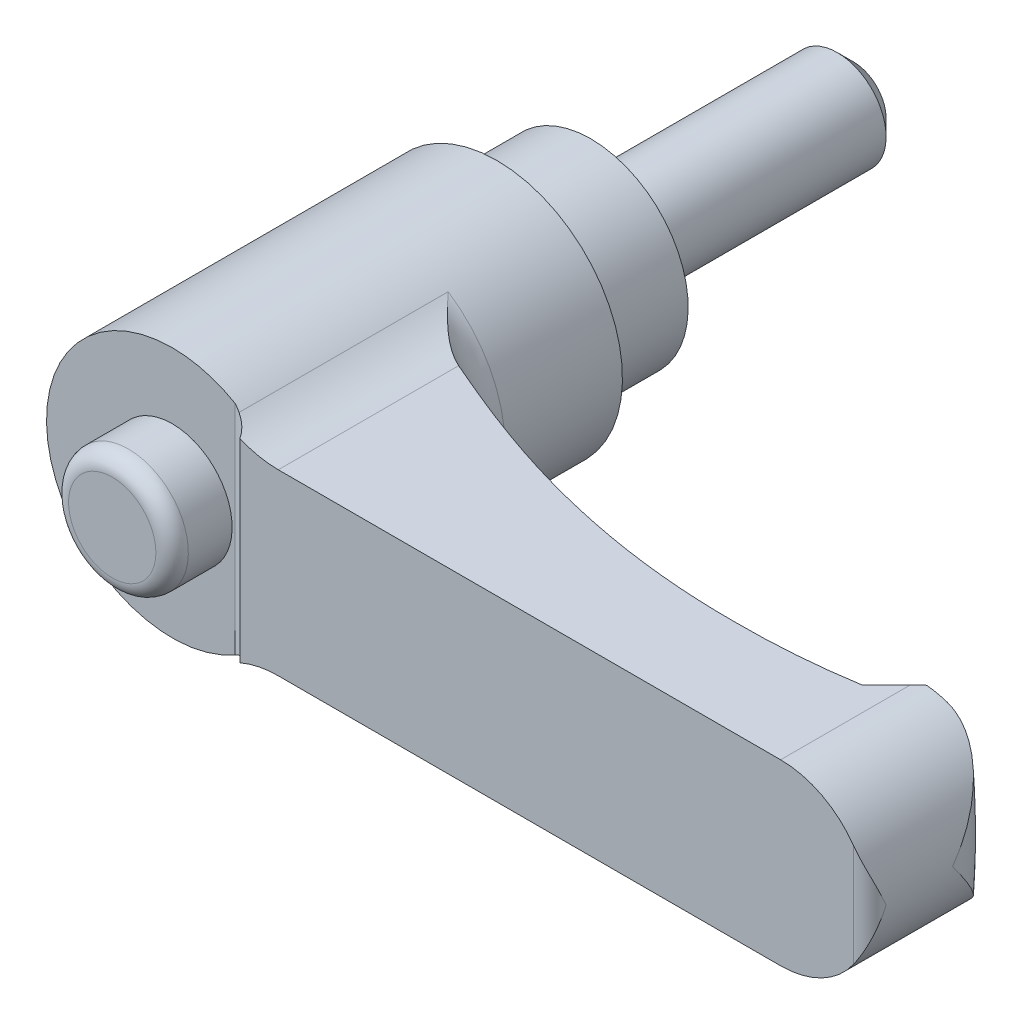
ISO-10303-21;
HEADER;
FILE_DESCRIPTION(('STEP AP214'),'2;1');
FILE_NAME('part.step','',(''),(''),'','','');
FILE_SCHEMA(('AUTOMOTIVE_DESIGN { 1 0 10303 214 1 1 1 1 }'));
ENDSEC;
DATA;
#1=APPLICATION_CONTEXT('core data for automotive mechanical design processes');
#2=APPLICATION_PROTOCOL_DEFINITION('international standard','automotive_design',2000,#1);
#3=PRODUCT_CONTEXT('',#1,'mechanical');
#4=PRODUCT('Part','Part','',(#3));
#5=PRODUCT_RELATED_PRODUCT_CATEGORY('part','',(#4));
#6=PRODUCT_DEFINITION_FORMATION('','',#4);
#7=PRODUCT_DEFINITION_CONTEXT('part definition',#1,'design');
#8=PRODUCT_DEFINITION('design','',#6,#7);
#9=PRODUCT_DEFINITION_SHAPE('','',#8);
#10=(LENGTH_UNIT() NAMED_UNIT(*) SI_UNIT(.MILLI.,.METRE.));
#11=(NAMED_UNIT(*) PLANE_ANGLE_UNIT() SI_UNIT($,.RADIAN.));
#12=(NAMED_UNIT(*) SI_UNIT($,.STERADIAN.) SOLID_ANGLE_UNIT());
#13=UNCERTAINTY_MEASURE_WITH_UNIT(LENGTH_MEASURE(1.E-05),#10,'distance_accuracy_value','');
#14=(GEOMETRIC_REPRESENTATION_CONTEXT(3) GLOBAL_UNCERTAINTY_ASSIGNED_CONTEXT((#13)) GLOBAL_UNIT_ASSIGNED_CONTEXT((#10,
#11,#12)) REPRESENTATION_CONTEXT('',''));
#15=CARTESIAN_POINT('',(0.,0.,0.));
#16=DIRECTION('',(0.,0.,1.));
#17=DIRECTION('',(1.,0.,0.));
#18=AXIS2_PLACEMENT_3D('',#15,#16,#17);
#19=CARTESIAN_POINT('',(4.8,0.,0.));
#20=DIRECTION('',(0.,0.,1.));
#21=DIRECTION('',(0.,-1.,0.));
#22=AXIS2_PLACEMENT_3D('',#19,#20,#21);
#23=PLANE('',#22);
#24=CARTESIAN_POINT('',(0.,0.,0.));
#25=DIRECTION('',(0.,0.,-1.));
#26=DIRECTION('',(0.,1.,0.));
#27=AXIS2_PLACEMENT_3D('',#24,#25,#26);
#28=CIRCLE('',#27,3.);
#29=CARTESIAN_POINT('',(0.,3.,0.));
#30=VERTEX_POINT('',#29);
#31=EDGE_CURVE('E469',#30,#30,#28,.T.);
#32=ORIENTED_EDGE('',*,*,#31,.F.);
#33=EDGE_LOOP('',(#32));
#34=FACE_BOUND('',#33,.T.);
#35=CARTESIAN_POINT('',(0.,0.,0.));
#36=DIRECTION('',(0.,0.,-1.));
#37=DIRECTION('',(0.,1.,0.));
#38=AXIS2_PLACEMENT_3D('',#35,#36,#37);
#39=CIRCLE('',#38,4.8);
#40=CARTESIAN_POINT('',(0.,4.8,0.));
#41=VERTEX_POINT('',#40);
#42=EDGE_CURVE('E417',#41,#41,#39,.T.);
#43=ORIENTED_EDGE('',*,*,#42,.T.);
#44=EDGE_LOOP('',(#43));
#45=FACE_BOUND('',#44,.T.);
#46=ADVANCED_FACE('F14',(#34,#45),#23,.F.);
#47=CARTESIAN_POINT('',(0.,0.,26.));
#48=DIRECTION('',(0.,0.,-1.));
#49=DIRECTION('',(0.,1.,0.));
#50=AXIS2_PLACEMENT_3D('',#47,#48,#49);
#51=PLANE('',#50);
#52=CARTESIAN_POINT('',(0.,0.,26.));
#53=DIRECTION('',(0.,0.,-1.));
#54=DIRECTION('',(0.,1.,0.));
#55=AXIS2_PLACEMENT_3D('',#52,#53,#54);
#56=CIRCLE('',#55,7.75);
#57=CARTESIAN_POINT('',(3.875,-6.7116968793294,26.));
#58=VERTEX_POINT('',#57);
#59=CARTESIAN_POINT('',(3.875,6.7116968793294,26.));
#60=VERTEX_POINT('',#59);
#61=EDGE_CURVE('E364',#58,#60,#56,.T.);
#62=ORIENTED_EDGE('',*,*,#61,.F.);
#63=DIRECTION('',(0.,1.,0.));
#64=VECTOR('',#63,1.);
#65=CARTESIAN_POINT('',(3.875,-11.,26.));
#66=LINE('',#65,#64);
#67=EDGE_CURVE('E451',#58,#60,#66,.T.);
#68=ORIENTED_EDGE('',*,*,#67,.T.);
#69=EDGE_LOOP('',(#62,#68));
#70=FACE_BOUND('',#69,.T.);
#71=CARTESIAN_POINT('',(0.,0.,26.));
#72=DIRECTION('',(0.,0.,-1.));
#73=DIRECTION('',(0.,1.,0.));
#74=AXIS2_PLACEMENT_3D('',#71,#72,#73);
#75=CIRCLE('',#74,3.69047619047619);
#76=CARTESIAN_POINT('',(0.,3.69047619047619,26.));
#77=VERTEX_POINT('',#76);
#78=EDGE_CURVE('E183',#77,#77,#75,.F.);
#79=ORIENTED_EDGE('',*,*,#78,.F.);
#80=EDGE_LOOP('',(#79));
#81=FACE_BOUND('',#80,.T.);
#82=ADVANCED_FACE('F158',(#70,#81),#51,.F.);
#83=CARTESIAN_POINT('',(38.5,0.,0.));
#84=DIRECTION('',(0.,0.,1.));
#85=DIRECTION('',(0.,-1.,0.));
#86=AXIS2_PLACEMENT_3D('',#83,#84,#85);
#87=CYLINDRICAL_SURFACE('',#86,5.5);
#88=CARTESIAN_POINT('',(44.,0.,21.9));
#89=CARTESIAN_POINT('',(44.0000000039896,-0.00425779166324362,21.8968685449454));
#90=CARTESIAN_POINT('',(43.9999950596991,-0.00851571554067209,21.8937369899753));
#91=CARTESIAN_POINT('',(43.9991083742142,-0.390143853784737,21.6130627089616));
#92=CARTESIAN_POINT('',(43.9593602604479,-0.76848056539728,21.3348044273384));
#93=CARTESIAN_POINT('',(43.8405607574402,-1.32856821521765,20.92503354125));
#94=CARTESIAN_POINT('',(43.7909532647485,-1.51435974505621,20.7894725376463));
#95=CARTESIAN_POINT('',(43.6715029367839,-1.88225773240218,20.5222473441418));
#96=CARTESIAN_POINT('',(43.601669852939,-2.06436592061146,20.3905813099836));
#97=CARTESIAN_POINT('',(43.4611872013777,-2.37875122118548,20.1648816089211));
#98=CARTESIAN_POINT('',(43.3950453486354,-2.51217438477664,20.0696210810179));
#99=CARTESIAN_POINT('',(43.250799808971,-2.77532702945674,19.8831417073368));
#100=CARTESIAN_POINT('',(43.1726935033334,-2.90505569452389,19.7919237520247));
#101=CARTESIAN_POINT('',(42.9202953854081,-3.28692053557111,19.5261795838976));
#102=CARTESIAN_POINT('',(42.727561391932,-3.53256609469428,19.3589622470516));
#103=CARTESIAN_POINT('',(42.3484683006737,-3.93634172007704,19.0952853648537));
#104=CARTESIAN_POINT('',(42.1735223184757,-4.10060224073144,18.9917399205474));
#105=CARTESIAN_POINT('',(41.7960798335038,-4.40966486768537,18.8081296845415));
#106=CARTESIAN_POINT('',(41.5936163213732,-4.55448986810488,18.7280371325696));
#107=CARTESIAN_POINT('',(41.2098130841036,-4.79019974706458,18.6136936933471));
#108=CARTESIAN_POINT('',(41.0333744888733,-4.88597642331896,18.5732748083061));
#109=CARTESIAN_POINT('',(40.7593164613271,-5.01555037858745,18.5310688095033));
#110=CARTESIAN_POINT('',(40.666374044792,-5.05640116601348,18.5200701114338));
#111=CARTESIAN_POINT('',(40.4779067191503,-5.13305107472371,18.5048417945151));
#112=CARTESIAN_POINT('',(40.3823830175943,-5.16885251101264,18.5006090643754));
#113=CARTESIAN_POINT('',(40.1884747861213,-5.23542428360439,18.4995076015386));
#114=CARTESIAN_POINT('',(40.090071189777,-5.26614066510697,18.5027130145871));
#115=CARTESIAN_POINT('',(39.8922874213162,-5.32184956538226,18.5171885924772));
#116=CARTESIAN_POINT('',(39.7929078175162,-5.34684523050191,18.528454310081));
#117=CARTESIAN_POINT('',(39.5942462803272,-5.39100815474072,18.5594647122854));
#118=CARTESIAN_POINT('',(39.4949643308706,-5.41017990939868,18.5792028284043));
#119=CARTESIAN_POINT('',(39.2976352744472,-5.44277299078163,18.6274002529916));
#120=CARTESIAN_POINT('',(39.1995875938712,-5.45619709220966,18.6558553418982));
#121=CARTESIAN_POINT('',(38.9984921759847,-5.47836544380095,18.7240647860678));
#122=CARTESIAN_POINT('',(38.8956289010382,-5.48667774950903,18.7645122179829));
#123=CARTESIAN_POINT('',(38.7445568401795,-5.49479244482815,18.8326405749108));
#124=CARTESIAN_POINT('',(38.6947409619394,-5.49677173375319,18.8565904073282));
#125=CARTESIAN_POINT('',(38.5963240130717,-5.49937673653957,18.9069325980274));
#126=CARTESIAN_POINT('',(38.5477229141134,-5.50000248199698,18.9333248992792));
#127=CARTESIAN_POINT('',(38.4998,-5.49999999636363,18.9609171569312));
#128=B_SPLINE_CURVE_WITH_KNOTS('',3,(#88,#89,#90,#91,#92,#93,#94,#95,#96,#97,#98,#99,#100,#101,
#102,#103,#104,#105,#106,#107,#108,#109,#110,#111,#112,#113,#114,#115,#116,#117,#118,#119,#120,
#121,#122,#123,#124,#125,#126,#127),.UNSPECIFIED.,.F.,.F.,(4,2,2,2,2,2,2,2,2,2,2,2,2,2,2,2,2,2,
2,4),(0.,0.0158565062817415,1.4211419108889,2.12636053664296,2.83123971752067,3.36110592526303,
3.89108827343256,4.94782257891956,5.7293360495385,6.50992069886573,7.12169061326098,
7.42772009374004,7.73360880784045,8.04255979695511,8.35134045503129,8.65988215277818,
8.96827473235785,9.30004722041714,9.46590364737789,9.63175620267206),.UNSPECIFIED.);
#129=CARTESIAN_POINT('',(40.2644155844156,-5.20930299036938,18.5));
#130=VERTEX_POINT('',#129);
#131=CARTESIAN_POINT('',(44.,0.,21.9));
#132=VERTEX_POINT('',#131);
#133=EDGE_CURVE('E126',#130,#132,#128,.F.);
#134=ORIENTED_EDGE('',*,*,#133,.T.);
#135=CARTESIAN_POINT('',(44.,0.,21.9));
#136=CARTESIAN_POINT('',(44.0000000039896,0.00425779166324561,21.8968685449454));
#137=CARTESIAN_POINT('',(43.9999950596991,0.00851571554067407,21.8937369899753));
#138=CARTESIAN_POINT('',(43.9991083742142,0.390143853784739,21.6130627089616));
#139=CARTESIAN_POINT('',(43.9593602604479,0.768480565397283,21.3348044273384));
#140=CARTESIAN_POINT('',(43.8405607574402,1.32856821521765,20.92503354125));
#141=CARTESIAN_POINT('',(43.7909532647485,1.51435974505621,20.7894725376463));
#142=CARTESIAN_POINT('',(43.6715029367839,1.88225773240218,20.5222473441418));
#143=CARTESIAN_POINT('',(43.601669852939,2.06436592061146,20.3905813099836));
#144=CARTESIAN_POINT('',(43.4611872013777,2.37875122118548,20.1648816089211));
#145=CARTESIAN_POINT('',(43.3950453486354,2.51217438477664,20.0696210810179));
#146=CARTESIAN_POINT('',(43.250799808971,2.77532702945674,19.8831417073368));
#147=CARTESIAN_POINT('',(43.1726935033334,2.9050556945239,19.7919237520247));
#148=CARTESIAN_POINT('',(42.9202953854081,3.28692053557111,19.5261795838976));
#149=CARTESIAN_POINT('',(42.727561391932,3.53256609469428,19.3589622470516));
#150=CARTESIAN_POINT('',(42.3484683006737,3.93634172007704,19.0952853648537));
#151=CARTESIAN_POINT('',(42.1735223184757,4.10060224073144,18.9917399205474));
#152=CARTESIAN_POINT('',(41.7960798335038,4.40966486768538,18.8081296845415));
#153=CARTESIAN_POINT('',(41.5936163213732,4.55448986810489,18.7280371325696));
#154=CARTESIAN_POINT('',(41.2098130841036,4.79019974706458,18.6136936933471));
#155=CARTESIAN_POINT('',(41.0333744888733,4.88597642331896,18.5732748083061));
#156=CARTESIAN_POINT('',(40.7593164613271,5.01555037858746,18.5310688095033));
#157=CARTESIAN_POINT('',(40.666374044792,5.05640116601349,18.5200701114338));
#158=CARTESIAN_POINT('',(40.4779067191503,5.13305107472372,18.5048417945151));
#159=CARTESIAN_POINT('',(40.3823830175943,5.16885251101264,18.5006090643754));
#160=CARTESIAN_POINT('',(40.1884747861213,5.23542428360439,18.4995076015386));
#161=CARTESIAN_POINT('',(40.090071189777,5.26614066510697,18.5027130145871));
#162=CARTESIAN_POINT('',(39.8922874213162,5.32184956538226,18.5171885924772));
#163=CARTESIAN_POINT('',(39.7929078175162,5.34684523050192,18.528454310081));
#164=CARTESIAN_POINT('',(39.5942462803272,5.39100815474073,18.5594647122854));
#165=CARTESIAN_POINT('',(39.4949643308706,5.41017990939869,18.5792028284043));
#166=CARTESIAN_POINT('',(39.2976352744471,5.44277299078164,18.6274002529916));
#167=CARTESIAN_POINT('',(39.1995875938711,5.45619709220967,18.6558553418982));
#168=CARTESIAN_POINT('',(38.9984921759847,5.47836544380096,18.7240647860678));
#169=CARTESIAN_POINT('',(38.8956289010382,5.48667774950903,18.7645122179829));
#170=CARTESIAN_POINT('',(38.7445568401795,5.49479244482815,18.8326405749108));
#171=CARTESIAN_POINT('',(38.6947409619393,5.4967717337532,18.8565904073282));
#172=CARTESIAN_POINT('',(38.5963240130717,5.49937673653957,18.9069325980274));
#173=CARTESIAN_POINT('',(38.5477229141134,5.50000248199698,18.9333248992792));
#174=CARTESIAN_POINT('',(38.4998,5.49999999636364,18.9609171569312));
#175=B_SPLINE_CURVE_WITH_KNOTS('',3,(#135,#136,#137,#138,#139,#140,#141,#142,#143,#144,#145,
#146,#147,#148,#149,#150,#151,#152,#153,#154,#155,#156,#157,#158,#159,#160,#161,#162,#163,#164,
#165,#166,#167,#168,#169,#170,#171,#172,#173,#174),.UNSPECIFIED.,.F.,.F.,(4,2,2,2,2,2,2,2,2,2,2,
2,2,2,2,2,2,2,2,4),(0.,0.0158565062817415,1.4211419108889,2.12636053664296,2.83123971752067,
3.36110592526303,3.89108827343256,4.94782257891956,5.72933604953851,6.50992069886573,
7.12169061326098,7.42772009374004,7.73360880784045,8.04255979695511,8.35134045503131,
8.6598821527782,8.9682747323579,9.30004722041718,9.46590364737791,9.63175620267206),.UNSPECIFIED.);
#176=CARTESIAN_POINT('',(40.2644155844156,5.20930299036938,18.5));
#177=VERTEX_POINT('',#176);
#178=EDGE_CURVE('E123',#132,#177,#175,.T.);
#179=ORIENTED_EDGE('',*,*,#178,.T.);
#180=CARTESIAN_POINT('',(38.5,0.,18.5));
#181=DIRECTION('',(0.,0.,-1.));
#182=DIRECTION('',(0.,1.,0.));
#183=AXIS2_PLACEMENT_3D('',#180,#181,#182);
#184=CIRCLE('',#183,5.5);
#185=CARTESIAN_POINT('',(39.,5.47722557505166,18.5));
#186=VERTEX_POINT('',#185);
#187=EDGE_CURVE('E457',#177,#186,#184,.F.);
#188=ORIENTED_EDGE('',*,*,#187,.T.);
#189=CARTESIAN_POINT('',(38.5,0.,19.));
#190=DIRECTION('',(-0.707106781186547,0.,-0.707106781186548));
#191=DIRECTION('',(-0.707106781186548,0.,0.707106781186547));
#192=AXIS2_PLACEMENT_3D('',#189,#190,#191);
#193=ELLIPSE('',#192,7.77817459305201,5.5);
#194=CARTESIAN_POINT('',(38.5,5.5,19.));
#195=VERTEX_POINT('',#194);
#196=EDGE_CURVE('E390',#186,#195,#193,.F.);
#197=ORIENTED_EDGE('',*,*,#196,.T.);
#198=DIRECTION('',(0.,0.,1.));
#199=VECTOR('',#198,1.);
#200=CARTESIAN_POINT('',(38.5,5.5,0.));
#201=LINE('',#200,#199);
#202=CARTESIAN_POINT('',(38.5,5.5,27.));
#203=VERTEX_POINT('',#202);
#204=EDGE_CURVE('E389',#195,#203,#201,.T.);
#205=ORIENTED_EDGE('',*,*,#204,.T.);
#206=CARTESIAN_POINT('',(38.5,0.,27.));
#207=DIRECTION('',(0.,0.,1.));
#208=DIRECTION('',(0.,-1.,0.));
#209=AXIS2_PLACEMENT_3D('',#206,#207,#208);
#210=CIRCLE('',#209,5.5);
#211=CARTESIAN_POINT('',(43.,3.16227766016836,27.));
#212=VERTEX_POINT('',#211);
#213=EDGE_CURVE('E367',#212,#203,#210,.T.);
#214=ORIENTED_EDGE('',*,*,#213,.F.);
#215=CARTESIAN_POINT('',(43.,3.16227766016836,27.));
#216=CARTESIAN_POINT('',(43.0489698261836,3.09261080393,26.9999556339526));
#217=CARTESIAN_POINT('',(43.0962528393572,3.0218687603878,26.9964077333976));
#218=CARTESIAN_POINT('',(43.1871872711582,2.87878712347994,26.9834058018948));
#219=CARTESIAN_POINT('',(43.2308453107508,2.80645076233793,26.9739628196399));
#220=CARTESIAN_POINT('',(43.3141980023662,2.66092047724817,26.9503365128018));
#221=CARTESIAN_POINT('',(43.3539154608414,2.58773460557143,26.9361828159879));
#222=CARTESIAN_POINT('',(43.4296865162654,2.44030003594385,26.903917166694));
#223=CARTESIAN_POINT('',(43.4657377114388,2.36605067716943,26.8858026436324));
#224=CARTESIAN_POINT('',(43.5573559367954,2.16613298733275,26.8329178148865));
#225=CARTESIAN_POINT('',(43.6095944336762,2.03971389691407,26.7951786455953));
#226=CARTESIAN_POINT('',(43.703955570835,1.78529411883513,26.7129945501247));
#227=CARTESIAN_POINT('',(43.7460735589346,1.65729273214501,26.6685465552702));
#228=CARTESIAN_POINT('',(43.8205857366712,1.39978291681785,26.5746664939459));
#229=CARTESIAN_POINT('',(43.852946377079,1.27027084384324,26.5252179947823));
#230=CARTESIAN_POINT('',(43.9079882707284,1.01058108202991,26.4229956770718));
#231=CARTESIAN_POINT('',(43.9306732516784,0.880403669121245,26.3702231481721));
#232=CARTESIAN_POINT('',(43.9654953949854,0.627432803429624,26.2658240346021));
#233=CARTESIAN_POINT('',(43.9781829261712,0.504664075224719,26.2143181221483));
#234=CARTESIAN_POINT('',(43.9952673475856,0.259135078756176,26.1104803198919));
#235=CARTESIAN_POINT('',(43.9996786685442,0.136375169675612,26.0581500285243));
#236=CARTESIAN_POINT('',(43.9999943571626,0.00909584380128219,26.0038784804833));
#237=CARTESIAN_POINT('',(43.9999999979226,0.00454789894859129,26.0019392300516));
#238=CARTESIAN_POINT('',(44.,0.,26.));
#239=B_SPLINE_CURVE_WITH_KNOTS('',3,(#215,#216,#217,#218,#219,#220,#221,#222,#223,#224,#225,
#226,#227,#228,#229,#230,#231,#232,#233,#234,#235,#236,#237,#238),.UNSPECIFIED.,.F.,.F.,(4,2,2,
2,2,2,2,2,2,2,2,4),(0.,0.255244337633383,0.510011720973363,0.763206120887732,1.01656533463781,
1.44159949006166,1.8668286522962,2.2935036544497,2.72001412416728,3.12097942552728,
3.52124493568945,3.53607734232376),.UNSPECIFIED.);
#240=CARTESIAN_POINT('',(44.,0.,26.));
#241=VERTEX_POINT('',#240);
#242=EDGE_CURVE('E169',#241,#212,#239,.F.);
#243=ORIENTED_EDGE('',*,*,#242,.F.);
#244=CARTESIAN_POINT('',(43.,-3.16227766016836,27.));
#245=CARTESIAN_POINT('',(43.0489698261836,-3.09261080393,26.9999556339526));
#246=CARTESIAN_POINT('',(43.0962528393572,-3.0218687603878,26.9964077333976));
#247=CARTESIAN_POINT('',(43.1871872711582,-2.87878712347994,26.9834058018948));
#248=CARTESIAN_POINT('',(43.2308453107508,-2.80645076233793,26.9739628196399));
#249=CARTESIAN_POINT('',(43.3141980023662,-2.66092047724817,26.9503365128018));
#250=CARTESIAN_POINT('',(43.3539154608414,-2.58773460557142,26.9361828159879));
#251=CARTESIAN_POINT('',(43.4296865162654,-2.44030003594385,26.903917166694));
#252=CARTESIAN_POINT('',(43.4657377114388,-2.36605067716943,26.8858026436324));
#253=CARTESIAN_POINT('',(43.5573559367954,-2.16613298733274,26.8329178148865));
#254=CARTESIAN_POINT('',(43.6095944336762,-2.03971389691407,26.7951786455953));
#255=CARTESIAN_POINT('',(43.703955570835,-1.78529411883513,26.7129945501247));
#256=CARTESIAN_POINT('',(43.7460735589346,-1.65729273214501,26.6685465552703));
#257=CARTESIAN_POINT('',(43.8205857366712,-1.39978291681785,26.5746664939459));
#258=CARTESIAN_POINT('',(43.852946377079,-1.27027084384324,26.5252179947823));
#259=CARTESIAN_POINT('',(43.9079882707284,-1.01058108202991,26.4229956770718));
#260=CARTESIAN_POINT('',(43.9306732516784,-0.880403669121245,26.3702231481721));
#261=CARTESIAN_POINT('',(43.9654953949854,-0.627432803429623,26.2658240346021));
#262=CARTESIAN_POINT('',(43.9781829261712,-0.504664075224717,26.2143181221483));
#263=CARTESIAN_POINT('',(43.9952673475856,-0.259135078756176,26.1104803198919));
#264=CARTESIAN_POINT('',(43.9996786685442,-0.136375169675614,26.0581500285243));
#265=CARTESIAN_POINT('',(43.9999943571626,-0.00909584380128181,26.0038784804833));
#266=CARTESIAN_POINT('',(43.9999999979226,-0.00454789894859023,26.0019392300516));
#267=CARTESIAN_POINT('',(44.,0.,26.));
#268=B_SPLINE_CURVE_WITH_KNOTS('',3,(#244,#245,#246,#247,#248,#249,#250,#251,#252,#253,#254,
#255,#256,#257,#258,#259,#260,#261,#262,#263,#264,#265,#266,#267),.UNSPECIFIED.,.F.,.F.,(4,2,2,
2,2,2,2,2,2,2,2,4),(0.,0.255244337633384,0.510011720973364,0.763206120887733,1.01656533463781,
1.44159949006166,1.8668286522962,2.2935036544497,2.72001412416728,3.12097942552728,
3.52124493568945,3.53607734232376),.UNSPECIFIED.);
#269=CARTESIAN_POINT('',(43.,-3.16227766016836,27.));
#270=VERTEX_POINT('',#269);
#271=EDGE_CURVE('E177',#270,#241,#268,.T.);
#272=ORIENTED_EDGE('',*,*,#271,.F.);
#273=CARTESIAN_POINT('',(38.5,-5.5,27.));
#274=VERTEX_POINT('',#273);
#275=EDGE_CURVE('E373',#274,#270,#210,.T.);
#276=ORIENTED_EDGE('',*,*,#275,.F.);
#277=DIRECTION('',(0.,0.,1.));
#278=VECTOR('',#277,1.);
#279=CARTESIAN_POINT('',(38.5,-5.5,0.));
#280=LINE('',#279,#278);
#281=CARTESIAN_POINT('',(38.5,-5.5,19.));
#282=VERTEX_POINT('',#281);
#283=EDGE_CURVE('E393',#282,#274,#280,.T.);
#284=ORIENTED_EDGE('',*,*,#283,.F.);
#285=CARTESIAN_POINT('',(39.,-5.47722557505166,18.5));
#286=VERTEX_POINT('',#285);
#287=EDGE_CURVE('E440',#282,#286,#193,.F.);
#288=ORIENTED_EDGE('',*,*,#287,.T.);
#289=EDGE_CURVE('E134',#286,#130,#184,.F.);
#290=ORIENTED_EDGE('',*,*,#289,.T.);
#291=EDGE_LOOP('',(#134,#179,#188,#197,#205,#214,#243,#272,#276,#284,#288,#290));
#292=FACE_BOUND('',#291,.T.);
#293=ADVANCED_FACE('F132',(#292),#87,.T.);
#294=CARTESIAN_POINT('',(40.6,-11.,18.5));
#295=DIRECTION('',(0.,0.,-1.));
#296=DIRECTION('',(0.,1.,0.));
#297=AXIS2_PLACEMENT_3D('',#294,#295,#296);
#298=PLANE('',#297);
#299=ORIENTED_EDGE('',*,*,#187,.F.);
#300=CARTESIAN_POINT('',(0.,0.,18.5));
#301=DIRECTION('',(0.,0.,-1.));
#302=DIRECTION('',(0.,1.,0.));
#303=AXIS2_PLACEMENT_3D('',#300,#301,#302);
#304=CIRCLE('',#303,40.6);
#305=EDGE_CURVE('E37',#177,#130,#304,.T.);
#306=ORIENTED_EDGE('',*,*,#305,.T.);
#307=ORIENTED_EDGE('',*,*,#289,.F.);
#308=DIRECTION('',(0.,1.,0.));
#309=VECTOR('',#308,1.);
#310=CARTESIAN_POINT('',(39.,-11.,18.5));
#311=LINE('',#310,#309);
#312=EDGE_CURVE('E448',#286,#186,#311,.T.);
#313=ORIENTED_EDGE('',*,*,#312,.T.);
#314=EDGE_LOOP('',(#299,#306,#307,#313));
#315=FACE_BOUND('',#314,.T.);
#316=ADVANCED_FACE('F157',(#315),#298,.T.);
#317=CARTESIAN_POINT('',(0.,0.,27.));
#318=DIRECTION('',(0.,0.,1.));
#319=DIRECTION('',(0.,-1.,0.));
#320=AXIS2_PLACEMENT_3D('',#317,#318,#319);
#321=PLANE('',#320);
#322=CARTESIAN_POINT('',(7.53740671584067,11.5,27.));
#323=DIRECTION('',(0.,0.,1.));
#324=DIRECTION('',(1.,0.,0.));
#325=AXIS2_PLACEMENT_3D('',#322,#323,#324);
#326=CIRCLE('',#325,6.);
#327=CARTESIAN_POINT('',(5.16666666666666,5.988231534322,27.));
#328=VERTEX_POINT('',#327);
#329=CARTESIAN_POINT('',(7.53740671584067,5.5,27.));
#330=VERTEX_POINT('',#329);
#331=EDGE_CURVE('E398',#328,#330,#326,.T.);
#332=ORIENTED_EDGE('',*,*,#331,.F.);
#333=DIRECTION('',(0.,1.,0.));
#334=VECTOR('',#333,1.);
#335=CARTESIAN_POINT('',(5.16666666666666,-11.,27.));
#336=LINE('',#335,#334);
#337=CARTESIAN_POINT('',(5.16666666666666,-5.988231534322,27.));
#338=VERTEX_POINT('',#337);
#339=EDGE_CURVE('E436',#338,#328,#336,.T.);
#340=ORIENTED_EDGE('',*,*,#339,.F.);
#341=CARTESIAN_POINT('',(7.53740671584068,-11.5,27.));
#342=DIRECTION('',(0.,0.,1.));
#343=DIRECTION('',(1.,0.,0.));
#344=AXIS2_PLACEMENT_3D('',#341,#342,#343);
#345=CIRCLE('',#344,6.);
#346=CARTESIAN_POINT('',(7.53740671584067,-5.5,27.));
#347=VERTEX_POINT('',#346);
#348=EDGE_CURVE('E401',#347,#338,#345,.T.);
#349=ORIENTED_EDGE('',*,*,#348,.F.);
#350=DIRECTION('',(-1.,0.,0.));
#351=VECTOR('',#350,1.);
#352=CARTESIAN_POINT('',(38.5,-5.5,27.));
#353=LINE('',#352,#351);
#354=EDGE_CURVE('E397',#274,#347,#353,.T.);
#355=ORIENTED_EDGE('',*,*,#354,.F.);
#356=ORIENTED_EDGE('',*,*,#275,.T.);
#357=DIRECTION('',(0.,1.,0.));
#358=VECTOR('',#357,1.);
#359=CARTESIAN_POINT('',(43.,-11.,27.));
#360=LINE('',#359,#358);
#361=EDGE_CURVE('E385',#270,#212,#360,.T.);
#362=ORIENTED_EDGE('',*,*,#361,.T.);
#363=ORIENTED_EDGE('',*,*,#213,.T.);
#364=DIRECTION('',(1.,0.,0.));
#365=VECTOR('',#364,1.);
#366=CARTESIAN_POINT('',(7.53740671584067,5.5,27.));
#367=LINE('',#366,#365);
#368=EDGE_CURVE('E384',#330,#203,#367,.T.);
#369=ORIENTED_EDGE('',*,*,#368,.F.);
#370=EDGE_LOOP('',(#332,#340,#349,#355,#356,#362,#363,#369));
#371=FACE_BOUND('',#370,.T.);
#372=ADVANCED_FACE('F240',(#371),#321,.T.);
#373=CARTESIAN_POINT('',(0.,0.,0.));
#374=DIRECTION('',(0.,0.,-1.));
#375=DIRECTION('',(0.,1.,0.));
#376=AXIS2_PLACEMENT_3D('',#373,#374,#375);
#377=CYLINDRICAL_SURFACE('',#376,7.75);
#378=CARTESIAN_POINT('',(0.,0.,13.2417430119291));
#379=DIRECTION('',(0.,0.,-1.));
#380=DIRECTION('',(0.,1.,0.));
#381=AXIS2_PLACEMENT_3D('',#378,#379,#380);
#382=CIRCLE('',#381,7.75);
#383=CARTESIAN_POINT('',(4.24835651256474,6.48181818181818,13.2417430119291));
#384=VERTEX_POINT('',#383);
#385=CARTESIAN_POINT('',(4.24835651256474,-6.48181818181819,13.2417430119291));
#386=VERTEX_POINT('',#385);
#387=EDGE_CURVE('E359',#384,#386,#382,.T.);
#388=ORIENTED_EDGE('',*,*,#387,.T.);
#389=DIRECTION('',(0.,0.,1.));
#390=VECTOR('',#389,1.);
#391=CARTESIAN_POINT('',(4.24835651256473,-6.48181818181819,0.));
#392=LINE('',#391,#390);
#393=CARTESIAN_POINT('',(4.24835651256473,-6.48181818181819,26.1308937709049));
#394=VERTEX_POINT('',#393);
#395=EDGE_CURVE('E409',#386,#394,#392,.T.);
#396=ORIENTED_EDGE('',*,*,#395,.T.);
#397=CARTESIAN_POINT('',(3.875,-6.7116968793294,26.));
#398=CARTESIAN_POINT('',(3.9487248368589,-6.66914880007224,26.0179048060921));
#399=CARTESIAN_POINT('',(4.02097408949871,-6.62579988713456,26.039874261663));
#400=CARTESIAN_POINT('',(4.16199829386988,-6.53812669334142,26.0915573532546));
#401=CARTESIAN_POINT('',(4.23077434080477,-6.49380272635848,26.1212685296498));
#402=CARTESIAN_POINT('',(4.36202505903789,-6.40634475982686,26.1868862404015));
#403=CARTESIAN_POINT('',(4.42463632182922,-6.36322379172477,26.2225378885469));
#404=CARTESIAN_POINT('',(4.54579687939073,-6.27724013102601,26.3004737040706));
#405=CARTESIAN_POINT('',(4.60434578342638,-6.23437746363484,26.3427585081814));
#406=CARTESIAN_POINT('',(4.71026264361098,-6.1546555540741,26.4283893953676));
#407=CARTESIAN_POINT('',(4.75813291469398,-6.11768751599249,26.4710140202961));
#408=CARTESIAN_POINT('',(4.8500303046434,-6.04509175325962,26.56120031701));
#409=CARTESIAN_POINT('',(4.89405965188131,-6.00946325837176,26.6087590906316));
#410=CARTESIAN_POINT('',(4.97925799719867,-5.9390764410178,26.7103994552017));
#411=CARTESIAN_POINT('',(5.02029084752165,-5.90438218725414,26.7646407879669));
#412=CARTESIAN_POINT('',(5.09738332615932,-5.83796295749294,26.8783962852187));
#413=CARTESIAN_POINT('',(5.13343386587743,-5.80624344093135,26.9379197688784));
#414=CARTESIAN_POINT('',(5.16666666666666,-5.77650894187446,27.));
#415=B_SPLINE_CURVE_WITH_KNOTS('',3,(#397,#398,#399,#400,#401,#402,#403,#404,#405,#406,#407,
#408,#409,#410,#411,#412,#413,#414),.UNSPECIFIED.,.F.,.F.,(4,2,2,2,2,2,2,2,4),(0.,
0.26081186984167,0.521540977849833,0.773092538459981,1.02466826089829,1.24638864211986,
1.4679795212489,1.6966429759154,1.92571819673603),.UNSPECIFIED.);
#416=EDGE_CURVE('E214',#58,#394,#415,.T.);
#417=ORIENTED_EDGE('',*,*,#416,.F.);
#418=ORIENTED_EDGE('',*,*,#61,.T.);
#419=CARTESIAN_POINT('',(5.16666666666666,5.77650894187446,27.));
#420=CARTESIAN_POINT('',(5.13714077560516,5.80292379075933,26.9448365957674));
#421=CARTESIAN_POINT('',(5.1053831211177,5.83091583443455,26.8916890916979));
#422=CARTESIAN_POINT('',(5.03785941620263,5.88934998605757,26.7895453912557));
#423=CARTESIAN_POINT('',(5.00209830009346,5.91978906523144,26.7405442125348));
#424=CARTESIAN_POINT('',(4.92700880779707,5.98243056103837,26.646752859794));
#425=CARTESIAN_POINT('',(4.88768622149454,6.01463008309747,26.6019560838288));
#426=CARTESIAN_POINT('',(4.80573825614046,6.08030777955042,26.5165060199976));
#427=CARTESIAN_POINT('',(4.76311181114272,6.11378636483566,26.4758540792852));
#428=CARTESIAN_POINT('',(4.63114473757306,6.21507952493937,26.3605779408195));
#429=CARTESIAN_POINT('',(4.53728284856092,6.28411879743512,26.2920994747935));
#430=CARTESIAN_POINT('',(4.3393749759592,6.42237347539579,26.1724069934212));
#431=CARTESIAN_POINT('',(4.23533663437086,6.49158871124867,26.1211801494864));
#432=CARTESIAN_POINT('',(4.08621326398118,6.5854168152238,26.0632790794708));
#433=CARTESIAN_POINT('',(4.04469277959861,6.61100425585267,26.0487072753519));
#434=CARTESIAN_POINT('',(3.96061680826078,6.66171281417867,26.0222973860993));
#435=CARTESIAN_POINT('',(3.91806319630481,6.68683464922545,26.0104547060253));
#436=CARTESIAN_POINT('',(3.8750000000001,6.7116968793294,26.));
#437=B_SPLINE_CURVE_WITH_KNOTS('',3,(#419,#420,#421,#422,#423,#424,#425,#426,#427,#428,#429,
#430,#431,#432,#433,#434,#435,#436),.UNSPECIFIED.,.F.,.F.,(4,2,2,2,2,2,2,2,4),(0.,
0.203583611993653,0.406919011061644,0.609929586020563,0.81300593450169,1.21684507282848,
1.62038324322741,1.77301957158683,1.92539700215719),.UNSPECIFIED.);
#438=CARTESIAN_POINT('',(4.24835651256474,6.48181818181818,26.1308937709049));
#439=VERTEX_POINT('',#438);
#440=EDGE_CURVE('E228',#439,#60,#437,.T.);
#441=ORIENTED_EDGE('',*,*,#440,.F.);
#442=DIRECTION('',(0.,0.,1.));
#443=VECTOR('',#442,1.);
#444=CARTESIAN_POINT('',(4.24835651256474,6.48181818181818,0.));
#445=LINE('',#444,#443);
#446=EDGE_CURVE('E415',#384,#439,#445,.T.);
#447=ORIENTED_EDGE('',*,*,#446,.F.);
#448=EDGE_LOOP('',(#388,#396,#417,#418,#441,#447));
#449=FACE_BOUND('',#448,.T.);
#450=CARTESIAN_POINT('',(0.,0.,6.));
#451=DIRECTION('',(0.,0.,-1.));
#452=DIRECTION('',(0.,1.,0.));
#453=AXIS2_PLACEMENT_3D('',#450,#451,#452);
#454=CIRCLE('',#453,7.75);
#455=CARTESIAN_POINT('',(0.,7.75,6.));
#456=VERTEX_POINT('',#455);
#457=EDGE_CURVE('E362',#456,#456,#454,.T.);
#458=ORIENTED_EDGE('',*,*,#457,.F.);
#459=EDGE_LOOP('',(#458));
#460=FACE_BOUND('',#459,.T.);
#461=ADVANCED_FACE('F238',(#449,#460),#377,.T.);
#462=CARTESIAN_POINT('',(7.53740671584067,11.5,0.));
#463=DIRECTION('',(0.,0.,1.));
#464=DIRECTION('',(0.,-1.,0.));
#465=AXIS2_PLACEMENT_3D('',#462,#463,#464);
#466=CYLINDRICAL_SURFACE('',#465,6.);
#467=DIRECTION('',(0.,0.,1.));
#468=VECTOR('',#467,1.);
#469=CARTESIAN_POINT('',(7.53740671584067,5.5,0.));
#470=LINE('',#469,#468);
#471=CARTESIAN_POINT('',(7.53740671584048,5.5,15.8847846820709));
#472=VERTEX_POINT('',#471);
#473=EDGE_CURVE('E392',#472,#330,#470,.T.);
#474=ORIENTED_EDGE('',*,*,#473,.F.);
#475=CARTESIAN_POINT('',(7.53760671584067,5.50000000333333,15.8848714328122));
#476=CARTESIAN_POINT('',(7.42056429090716,5.50000237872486,15.8340928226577));
#477=CARTESIAN_POINT('',(7.30547455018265,5.50341530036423,15.7791506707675));
#478=CARTESIAN_POINT('',(7.07949807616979,5.51642945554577,15.6622782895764));
#479=CARTESIAN_POINT('',(6.96860436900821,5.52601989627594,15.6003604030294));
#480=CARTESIAN_POINT('',(6.64350339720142,5.56296716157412,15.4067136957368));
#481=CARTESIAN_POINT('',(6.43532620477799,5.59851698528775,15.2663869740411));
#482=CARTESIAN_POINT('',(6.04665859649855,5.68493972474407,14.9793319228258));
#483=CARTESIAN_POINT('',(5.86525717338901,5.73477067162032,14.8334864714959));
#484=CARTESIAN_POINT('',(5.51460300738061,5.84825422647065,14.5326629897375));
#485=CARTESIAN_POINT('',(5.34535978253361,5.91191750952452,14.3776779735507));
#486=CARTESIAN_POINT('',(5.01722866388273,6.05200819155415,14.0618166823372));
#487=CARTESIAN_POINT('',(4.85836829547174,6.12846774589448,13.9009263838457));
#488=CARTESIAN_POINT('',(4.55010273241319,6.29360411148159,13.5765860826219));
#489=CARTESIAN_POINT('',(4.40069155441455,6.3822730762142,13.4131377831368));
#490=CARTESIAN_POINT('',(4.25307835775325,6.47872574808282,13.2470592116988));
#491=CARTESIAN_POINT('',(4.25071688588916,6.48027113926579,13.2444011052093));
#492=CARTESIAN_POINT('',(4.24835651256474,6.48181818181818,13.2417430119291));
#493=B_SPLINE_CURVE_WITH_KNOTS('',3,(#475,#476,#477,#478,#479,#480,#481,#482,#483,#484,#485,
#486,#487,#488,#489,#490,#491,#492),.UNSPECIFIED.,.F.,.F.,(4,2,2,2,2,2,2,2,4),(0.,
0.382411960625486,0.764157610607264,1.52259154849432,2.23572847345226,2.9494177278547,
3.66492808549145,4.37998074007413,4.39161142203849),.UNSPECIFIED.);
#494=EDGE_CURVE('E244',#472,#384,#493,.T.);
#495=ORIENTED_EDGE('',*,*,#494,.T.);
#496=ORIENTED_EDGE('',*,*,#446,.T.);
#497=CARTESIAN_POINT('',(5.16666666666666,5.988231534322,27.));
#498=CARTESIAN_POINT('',(5.14070328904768,5.99939986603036,26.9514536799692));
#499=CARTESIAN_POINT('',(5.11281907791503,6.01160988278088,26.9041807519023));
#500=CARTESIAN_POINT('',(5.05359296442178,6.03815743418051,26.8125079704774));
#501=CARTESIAN_POINT('',(5.02225228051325,6.05249421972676,26.7681071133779));
#502=CARTESIAN_POINT('',(4.957388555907,6.08292031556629,26.6836551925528));
#503=CARTESIAN_POINT('',(4.92394991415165,6.09895014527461,26.6435177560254));
#504=CARTESIAN_POINT('',(4.85453383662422,6.13309313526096,26.5664566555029));
#505=CARTESIAN_POINT('',(4.81855640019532,6.151206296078,26.5295329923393));
#506=CARTESIAN_POINT('',(4.74141898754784,6.19109353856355,26.4561742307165));
#507=CARTESIAN_POINT('',(4.70007605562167,6.21304611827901,26.4200283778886));
#508=CARTESIAN_POINT('',(4.61540587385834,6.25936628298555,26.3518346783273));
#509=CARTESIAN_POINT('',(4.57207832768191,6.28373422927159,26.31978744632));
#510=CARTESIAN_POINT('',(4.48259160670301,6.33561673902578,26.2589246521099));
#511=CARTESIAN_POINT('',(4.43638627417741,6.36320560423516,26.2302406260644));
#512=CARTESIAN_POINT('',(4.34298641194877,6.4207567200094,26.1772795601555));
#513=CARTESIAN_POINT('',(4.29579253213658,6.45071744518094,26.152999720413));
#514=CARTESIAN_POINT('',(4.24835651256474,6.48181818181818,26.1308937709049));
#515=B_SPLINE_CURVE_WITH_KNOTS('',3,(#497,#498,#499,#500,#501,#502,#503,#504,#505,#506,#507,
#508,#509,#510,#511,#512,#513,#514),.UNSPECIFIED.,.F.,.F.,(4,2,2,2,2,2,2,2,4),(0.,
0.168459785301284,0.336860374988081,0.500600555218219,0.664340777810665,0.841530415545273,
1.0187465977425,1.20147538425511,1.38408759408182),.UNSPECIFIED.);
#516=EDGE_CURVE('E222',#328,#439,#515,.T.);
#517=ORIENTED_EDGE('',*,*,#516,.F.);
#518=ORIENTED_EDGE('',*,*,#331,.T.);
#519=EDGE_LOOP('',(#474,#495,#496,#517,#518));
#520=FACE_BOUND('',#519,.T.);
#521=ADVANCED_FACE('F234',(#520),#466,.F.);
#522=CARTESIAN_POINT('',(7.53740671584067,5.5,0.));
#523=DIRECTION('',(0.,-1.,0.));
#524=DIRECTION('',(1.,0.,0.));
#525=AXIS2_PLACEMENT_3D('',#522,#523,#524);
#526=PLANE('',#525);
#527=CARTESIAN_POINT('',(30.0268503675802,5.5,-22.9439315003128));
#528=DIRECTION('',(0.,-1.,0.));
#529=DIRECTION('',(1.,0.,0.));
#530=AXIS2_PLACEMENT_3D('',#527,#528,#529);
#531=CIRCLE('',#530,44.);
#532=CARTESIAN_POINT('',(29.7749924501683,5.5,21.0553476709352));
#533=VERTEX_POINT('',#532);
#534=CARTESIAN_POINT('',(37.,5.5,20.5));
#535=VERTEX_POINT('',#534);
#536=EDGE_CURVE('E438',#533,#535,#531,.F.);
#537=ORIENTED_EDGE('',*,*,#536,.F.);
#538=CARTESIAN_POINT('',(21.9436856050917,5.5,20.4285815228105));
#539=CARTESIAN_POINT('',(21.2029115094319,5.5,20.3059110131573));
#540=CARTESIAN_POINT('',(20.4649826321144,5.5,20.1656901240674));
#541=CARTESIAN_POINT('',(18.9963617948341,5.5,19.8513505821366));
#542=CARTESIAN_POINT('',(18.2656705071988,5.5,19.6772288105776));
#543=CARTESIAN_POINT('',(16.8128961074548,5.5,19.2967691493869));
#544=CARTESIAN_POINT('',(16.090811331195,5.5,19.0904376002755));
#545=CARTESIAN_POINT('',(14.6559685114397,5.5,18.6477967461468));
#546=CARTESIAN_POINT('',(13.9432097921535,5.5,18.4114896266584));
#547=CARTESIAN_POINT('',(12.8749404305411,5.5,18.0348625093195));
#548=CARTESIAN_POINT('',(12.5159102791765,5.5,17.9044045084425));
#549=CARTESIAN_POINT('',(11.8001944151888,5.5,17.6372082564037));
#550=CARTESIAN_POINT('',(11.4435086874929,5.5,17.5004700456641));
#551=CARTESIAN_POINT('',(10.732274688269,5.5,17.2214557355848));
#552=CARTESIAN_POINT('',(10.3777266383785,5.5,17.0791790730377));
#553=CARTESIAN_POINT('',(9.67049294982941,5.5,16.7900916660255));
#554=CARTESIAN_POINT('',(9.31780729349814,5.5,16.6432809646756));
#555=CARTESIAN_POINT('',(8.61374307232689,5.5,16.3464161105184));
#556=CARTESIAN_POINT('',(8.26236472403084,5.5,16.1963614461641));
#557=CARTESIAN_POINT('',(7.5602010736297,5.5,15.8948338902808));
#558=CARTESIAN_POINT('',(7.20941580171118,5.5,15.7433609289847));
#559=CARTESIAN_POINT('',(6.50744095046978,5.5,15.4415733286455));
#560=CARTESIAN_POINT('',(6.15625149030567,5.5,15.2912584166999));
#561=CARTESIAN_POINT('',(5.62793742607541,5.5,15.0694562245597));
#562=CARTESIAN_POINT('',(5.45158532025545,5.5,14.9961369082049));
#563=CARTESIAN_POINT('',(5.09811730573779,5.5,14.8513669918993));
#564=CARTESIAN_POINT('',(4.92100141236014,5.5,14.7799163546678));
#565=CARTESIAN_POINT('',(4.5605943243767,5.5,14.6376146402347));
#566=CARTESIAN_POINT('',(4.37727258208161,5.5,14.5668405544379));
#567=CARTESIAN_POINT('',(4.00919151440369,5.5,14.4290929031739));
#568=CARTESIAN_POINT('',(3.82443214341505,5.5,14.3621194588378));
#569=CARTESIAN_POINT('',(3.45309773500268,5.5,14.2332037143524));
#570=CARTESIAN_POINT('',(3.26652222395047,5.5,14.1712627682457));
#571=CARTESIAN_POINT('',(2.89130395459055,5.5,14.0539247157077));
#572=CARTESIAN_POINT('',(2.70266119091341,5.5,13.9985276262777));
#573=CARTESIAN_POINT('',(2.32827959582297,5.5,13.897398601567));
#574=CARTESIAN_POINT('',(2.14260137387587,5.5,13.851444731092));
#575=CARTESIAN_POINT('',(1.76914487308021,5.5,13.769095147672));
#576=CARTESIAN_POINT('',(1.58136699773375,5.5,13.732697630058));
#577=CARTESIAN_POINT('',(1.20421453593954,5.5,13.6711783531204));
#578=CARTESIAN_POINT('',(1.01484256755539,5.5,13.6460408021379));
#579=CARTESIAN_POINT('',(0.634839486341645,5.5,13.6083407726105));
#580=CARTESIAN_POINT('',(0.444208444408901,5.5,13.5957775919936));
#581=CARTESIAN_POINT('',(0.0582481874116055,5.5,13.5838589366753));
#582=CARTESIAN_POINT('',(-0.137090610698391,5.5,13.5848056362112));
#583=CARTESIAN_POINT('',(-0.527202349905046,5.5,13.600583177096));
#584=CARTESIAN_POINT('',(-0.721975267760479,5.5,13.6154145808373));
#585=CARTESIAN_POINT('',(-1.11032173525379,5.5,13.6580559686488));
#586=CARTESIAN_POINT('',(-1.30389342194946,5.5,13.6858826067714));
#587=CARTESIAN_POINT('',(-1.68902621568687,5.5,13.7529686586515));
#588=CARTESIAN_POINT('',(-1.88058717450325,5.5,13.792228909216));
#589=CARTESIAN_POINT('',(-2.26665403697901,5.5,13.8815548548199));
#590=CARTESIAN_POINT('',(-2.46109765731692,5.5,13.9318861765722));
#591=CARTESIAN_POINT('',(-2.84766117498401,5.5,14.0407100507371));
#592=CARTESIAN_POINT('',(-3.03978104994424,5.5,14.0992026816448));
#593=CARTESIAN_POINT('',(-3.42198028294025,5.5,14.2225795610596));
#594=CARTESIAN_POINT('',(-3.61205922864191,5.5,14.2874650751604));
#595=CARTESIAN_POINT('',(-3.99046224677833,5.5,14.4221031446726));
#596=CARTESIAN_POINT('',(-4.17878640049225,5.5,14.4918554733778));
#597=CARTESIAN_POINT('',(-4.676521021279,5.5,14.6816530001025));
#598=CARTESIAN_POINT('',(-4.98473853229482,5.5,14.8048097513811));
#599=CARTESIAN_POINT('',(-5.5989323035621,5.5,15.0566129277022));
#600=CARTESIAN_POINT('',(-5.9049082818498,5.5,15.1852600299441));
#601=CARTESIAN_POINT('',(-6.51590552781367,5.5,15.4450696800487));
#602=CARTESIAN_POINT('',(-6.82092644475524,5.5,15.5762330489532));
#603=CARTESIAN_POINT('',(-7.4308151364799,5.5,15.8388677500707));
#604=CARTESIAN_POINT('',(-7.73568291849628,5.5,15.9703390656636));
#605=CARTESIAN_POINT('',(-8.34590975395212,5.5,16.2320111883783));
#606=CARTESIAN_POINT('',(-8.65126872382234,5.5,16.3622121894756));
#607=CARTESIAN_POINT('',(-9.26301038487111,5.5,16.6202018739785));
#608=CARTESIAN_POINT('',(-9.56939308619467,5.5,16.7479905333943));
#609=CARTESIAN_POINT('',(-10.18346626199,5.5,17.0002474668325));
#610=CARTESIAN_POINT('',(-10.4911565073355,5.5,17.1247162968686));
#611=CARTESIAN_POINT('',(-11.1081171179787,5.5,17.3696729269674));
#612=CARTESIAN_POINT('',(-11.4173874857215,5.5,17.4901607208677));
#613=CARTESIAN_POINT('',(-12.3376879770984,5.5,17.8409557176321));
#614=CARTESIAN_POINT('',(-12.9512257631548,5.5,18.0647504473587));
#615=CARTESIAN_POINT('',(-14.1854891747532,5.5,18.4917099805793));
#616=CARTESIAN_POINT('',(-14.8062151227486,5.5,18.6948738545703));
#617=CARTESIAN_POINT('',(-16.0550414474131,5.5,19.0786051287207));
#618=CARTESIAN_POINT('',(-16.6831460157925,5.5,19.2591589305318));
#619=CARTESIAN_POINT('',(-17.9458274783,5.5,19.5960006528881));
#620=CARTESIAN_POINT('',(-18.5804042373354,5.5,19.7522890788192));
#621=CARTESIAN_POINT('',(-19.8687426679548,5.5,20.042499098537));
#622=CARTESIAN_POINT('',(-20.5226266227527,5.5,20.175879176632));
#623=CARTESIAN_POINT('',(-21.8354017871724,5.5,20.4152377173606));
#624=CARTESIAN_POINT('',(-22.4942930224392,5.5,20.5212160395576));
#625=CARTESIAN_POINT('',(-23.8158234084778,5.5,20.7050444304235));
#626=CARTESIAN_POINT('',(-24.4784615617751,5.5,20.7829016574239));
#627=CARTESIAN_POINT('',(-25.8065399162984,5.5,20.9099991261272));
#628=CARTESIAN_POINT('',(-26.4719803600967,5.5,20.9592368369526));
#629=CARTESIAN_POINT('',(-27.8111455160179,5.5,21.0290443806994));
#630=CARTESIAN_POINT('',(-28.4848857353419,5.5,21.0493180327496));
#631=CARTESIAN_POINT('',(-29.832670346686,5.5,21.059972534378));
#632=CARTESIAN_POINT('',(-30.5067147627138,5.5,21.0503503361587));
#633=CARTESIAN_POINT('',(-31.8537233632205,5.5,21.00103018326));
#634=CARTESIAN_POINT('',(-32.5266875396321,5.5,20.9613320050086));
#635=CARTESIAN_POINT('',(-33.8701757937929,5.5,20.851796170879));
#636=CARTESIAN_POINT('',(-34.5406996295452,5.5,20.7819556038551));
#637=CARTESIAN_POINT('',(-36.5044041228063,5.5,20.5325502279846));
#638=CARTESIAN_POINT('',(-37.7925761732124,5.5,20.3114829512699));
#639=CARTESIAN_POINT('',(-40.3443280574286,5.5,19.757262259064));
#640=CARTESIAN_POINT('',(-41.6079093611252,5.5,19.4241155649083));
#641=CARTESIAN_POINT('',(-44.0962933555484,5.5,18.6492697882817));
#642=CARTESIAN_POINT('',(-45.3212216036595,5.5,18.2079745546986));
#643=CARTESIAN_POINT('',(-47.7274854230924,5.5,17.2193030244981));
#644=CARTESIAN_POINT('',(-48.9088216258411,5.5,16.6719282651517));
#645=CARTESIAN_POINT('',(-51.1734523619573,5.5,15.498540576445));
#646=CARTESIAN_POINT('',(-52.2587741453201,5.5,14.8764362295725));
#647=CARTESIAN_POINT('',(-54.3726735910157,5.5,13.5423563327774));
#648=CARTESIAN_POINT('',(-55.4012530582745,5.5,12.8303836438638));
#649=CARTESIAN_POINT('',(-57.3951593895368,5.5,11.3208515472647));
#650=CARTESIAN_POINT('',(-58.3604230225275,5.5,10.5232086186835));
#651=CARTESIAN_POINT('',(-60.2195247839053,5.5,8.84861310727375));
#652=CARTESIAN_POINT('',(-61.1133627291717,5.5,7.97166032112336));
#653=CARTESIAN_POINT('',(-62.8150803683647,5.5,6.15328374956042));
#654=CARTESIAN_POINT('',(-63.6236831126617,5.5,5.21253649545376));
#655=CARTESIAN_POINT('',(-65.1585152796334,5.5,3.2660954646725));
#656=CARTESIAN_POINT('',(-65.8847454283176,5.5,2.26040226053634));
#657=CARTESIAN_POINT('',(-67.2493974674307,5.5,0.191536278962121));
#658=CARTESIAN_POINT('',(-67.8878452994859,5.5,-0.871619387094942));
#659=CARTESIAN_POINT('',(-69.0725839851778,5.5,-3.04809766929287));
#660=CARTESIAN_POINT('',(-69.6188748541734,5.5,-4.16142027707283));
#661=CARTESIAN_POINT('',(-70.6138791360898,5.5,-6.42690481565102));
#662=CARTESIAN_POINT('',(-71.0628771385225,5.5,-7.5789417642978));
#663=CARTESIAN_POINT('',(-71.8621230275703,5.5,-9.9167744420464));
#664=CARTESIAN_POINT('',(-72.2123711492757,5.5,-11.1025700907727));
#665=CARTESIAN_POINT('',(-72.8116233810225,5.5,-13.4995512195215));
#666=CARTESIAN_POINT('',(-73.0606212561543,5.5,-14.7107382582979));
#667=CARTESIAN_POINT('',(-73.4555550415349,5.5,-17.149800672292));
#668=CARTESIAN_POINT('',(-73.6014909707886,5.5,-18.3776760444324));
#669=CARTESIAN_POINT('',(-73.7891401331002,5.5,-20.8398733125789));
#670=CARTESIAN_POINT('',(-73.8309789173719,5.5,-22.074185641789));
#671=CARTESIAN_POINT('',(-73.8104989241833,5.5,-24.5419450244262));
#672=CARTESIAN_POINT('',(-73.7481802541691,5.5,-25.7753920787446));
#673=CARTESIAN_POINT('',(-73.5198330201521,5.5,-28.2326343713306));
#674=CARTESIAN_POINT('',(-73.3538056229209,5.5,-29.4564297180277));
#675=CARTESIAN_POINT('',(-72.9192307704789,5.5,-31.8856803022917));
#676=CARTESIAN_POINT('',(-72.6506833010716,5.5,-33.091135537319));
#677=CARTESIAN_POINT('',(-72.0130528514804,5.5,-35.4749058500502));
#678=CARTESIAN_POINT('',(-71.6439893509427,5.5,-36.6532261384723));
#679=CARTESIAN_POINT('',(-70.8079450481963,5.5,-38.9746006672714));
#680=CARTESIAN_POINT('',(-70.3409642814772,5.5,-40.1176549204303));
#681=CARTESIAN_POINT('',(-69.3124410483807,5.5,-42.360356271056));
#682=CARTESIAN_POINT('',(-68.7509013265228,5.5,-43.4600046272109));
#683=CARTESIAN_POINT('',(-67.5372663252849,5.5,-45.6081393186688));
#684=CARTESIAN_POINT('',(-66.8851710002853,5.5,-46.6566256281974));
#685=CARTESIAN_POINT('',(-65.4946967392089,5.5,-48.6955922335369));
#686=CARTESIAN_POINT('',(-64.7562697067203,5.5,-49.6860397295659));
#687=CARTESIAN_POINT('',(-63.1987070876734,5.5,-51.6012967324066));
#688=CARTESIAN_POINT('',(-62.3795715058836,5.5,-52.5261062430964));
#689=CARTESIAN_POINT('',(-60.6663328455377,5.5,-54.3036958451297));
#690=CARTESIAN_POINT('',(-59.7722198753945,5.5,-55.1564664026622));
#691=CARTESIAN_POINT('',(-57.9155054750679,5.5,-56.7838668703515));
#692=CARTESIAN_POINT('',(-56.9529039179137,5.5,-57.5584966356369));
#693=CARTESIAN_POINT('',(-54.9640531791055,5.5,-59.0257183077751));
#694=CARTESIAN_POINT('',(-53.9376782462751,5.5,-59.7181397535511));
#695=CARTESIAN_POINT('',(-51.8303976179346,5.5,-61.0143176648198));
#696=CARTESIAN_POINT('',(-50.7494919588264,5.5,-61.6180741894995));
#697=CARTESIAN_POINT('',(-48.5414354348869,5.5,-62.7325236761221));
#698=CARTESIAN_POINT('',(-47.4143088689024,5.5,-63.2432647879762));
#699=CARTESIAN_POINT('',(-45.1212908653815,5.5,-64.1686883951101));
#700=CARTESIAN_POINT('',(-43.9553992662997,5.5,-64.5833704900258));
#701=CARTESIAN_POINT('',(-41.5882659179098,5.5,-65.3155534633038));
#702=CARTESIAN_POINT('',(-40.38689898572,5.5,-65.632649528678));
#703=CARTESIAN_POINT('',(-37.9619145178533,5.5,-66.1655256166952));
#704=CARTESIAN_POINT('',(-36.7382971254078,5.5,-66.3813062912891));
#705=CARTESIAN_POINT('',(-34.275334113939,5.5,-66.710907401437));
#706=CARTESIAN_POINT('',(-33.0359651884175,5.5,-66.8245529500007));
#707=CARTESIAN_POINT('',(-30.5519233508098,5.5,-66.949270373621));
#708=CARTESIAN_POINT('',(-29.3072503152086,5.5,-66.9603398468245));
#709=CARTESIAN_POINT('',(-27.4328330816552,5.5,-66.9006074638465));
#710=CARTESIAN_POINT('',(-26.8016630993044,5.5,-66.867386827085));
#711=CARTESIAN_POINT('',(-25.5412287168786,5.5,-66.7750687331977));
#712=CARTESIAN_POINT('',(-24.9119641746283,5.5,-66.7159732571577));
#713=CARTESIAN_POINT('',(-23.6563743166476,5.5,-66.5722867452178));
#714=CARTESIAN_POINT('',(-23.030048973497,5.5,-66.4876959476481));
#715=CARTESIAN_POINT('',(-21.7812881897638,5.5,-66.2935274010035));
#716=CARTESIAN_POINT('',(-21.1588527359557,5.5,-66.1839497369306));
#717=CARTESIAN_POINT('',(-19.9224424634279,5.5,-65.9411856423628));
#718=CARTESIAN_POINT('',(-19.308439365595,5.5,-65.8081429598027));
#719=CARTESIAN_POINT('',(-18.0859254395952,5.5,-65.5188448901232));
#720=CARTESIAN_POINT('',(-17.4774146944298,5.5,-65.3625891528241));
#721=CARTESIAN_POINT('',(-16.2665868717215,5.5,-65.0279717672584));
#722=CARTESIAN_POINT('',(-15.6642691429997,5.5,-64.8496124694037));
#723=CARTESIAN_POINT('',(-14.4661769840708,5.5,-64.4722099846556));
#724=CARTESIAN_POINT('',(-13.8704023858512,5.5,-64.2731673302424));
#725=CARTESIAN_POINT('',(-12.9056486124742,5.5,-63.9338479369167));
#726=CARTESIAN_POINT('',(-12.5346659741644,5.5,-63.7992210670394));
#727=CARTESIAN_POINT('',(-11.7952061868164,5.5,-63.5232565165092));
#728=CARTESIAN_POINT('',(-11.4267290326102,5.5,-63.3819188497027));
#729=CARTESIAN_POINT('',(-10.6921193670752,5.5,-63.0933840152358));
#730=CARTESIAN_POINT('',(-10.3259866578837,5.5,-62.9461873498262));
#731=CARTESIAN_POINT('',(-9.5956831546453,5.5,-62.6470255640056));
#732=CARTESIAN_POINT('',(-9.23151234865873,5.5,-62.4950604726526));
#733=CARTESIAN_POINT('',(-8.50037550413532,5.5,-62.1860779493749));
#734=CARTESIAN_POINT('',(-8.13342561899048,5.5,-62.0290224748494));
#735=CARTESIAN_POINT('',(-7.40003558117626,5.5,-61.7136665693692));
#736=CARTESIAN_POINT('',(-7.03359546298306,5.5,-61.5553660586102));
#737=CARTESIAN_POINT('',(-6.48333186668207,5.5,-61.3193380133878));
#738=CARTESIAN_POINT('',(-6.29981391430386,5.5,-61.240900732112));
#739=CARTESIAN_POINT('',(-5.93235022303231,5.5,-61.0850361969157));
#740=CARTESIAN_POINT('',(-5.74840448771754,5.5,-61.0076089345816));
#741=CARTESIAN_POINT('',(-5.37984608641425,5.5,-60.8544040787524));
#742=CARTESIAN_POINT('',(-5.1952334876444,5.5,-60.7786263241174));
#743=CARTESIAN_POINT('',(-4.82503126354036,5.5,-60.6295012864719));
#744=CARTESIAN_POINT('',(-4.63944166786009,5.5,-60.5561539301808));
#745=CARTESIAN_POINT('',(-4.27169927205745,5.5,-60.4146846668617));
#746=CARTESIAN_POINT('',(-4.08957956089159,5.5,-60.3464771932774));
#747=CARTESIAN_POINT('',(-3.72376343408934,5.5,-60.2143879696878));
#748=CARTESIAN_POINT('',(-3.54006698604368,5.5,-60.150506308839));
#749=CARTESIAN_POINT('',(-3.17073931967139,5.5,-60.0283823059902));
#750=CARTESIAN_POINT('',(-2.98510759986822,5.5,-59.9701414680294));
#751=CARTESIAN_POINT('',(-2.61170873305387,5.5,-59.8608838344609));
#752=CARTESIAN_POINT('',(-2.42394159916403,5.5,-59.8098669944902));
#753=CARTESIAN_POINT('',(-2.05048121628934,5.5,-59.7178788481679));
#754=CARTESIAN_POINT('',(-1.8648385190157,5.5,-59.6767047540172));
#755=CARTESIAN_POINT('',(-1.49157477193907,5.5,-59.6046431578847));
#756=CARTESIAN_POINT('',(-1.30395411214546,5.5,-59.5737536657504));
#757=CARTESIAN_POINT('',(-0.927389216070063,5.5,-59.5238316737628));
#758=CARTESIAN_POINT('',(-0.738447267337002,5.5,-59.504782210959));
#759=CARTESIAN_POINT('',(-0.359698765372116,5.5,-59.4795639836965));
#760=CARTESIAN_POINT('',(-0.169892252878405,5.5,-59.4733946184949));
#761=CARTESIAN_POINT('',(0.212334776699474,5.5,-59.4743236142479));
#762=CARTESIAN_POINT('',(0.40475485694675,5.5,-59.4816080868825));
#763=CARTESIAN_POINT('',(0.788635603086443,5.5,-59.5093514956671));
#764=CARTESIAN_POINT('',(0.980096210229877,5.5,-59.5298112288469));
#765=CARTESIAN_POINT('',(1.36161376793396,5.5,-59.5827503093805));
#766=CARTESIAN_POINT('',(1.55166816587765,5.5,-59.6152477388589));
#767=CARTESIAN_POINT('',(1.92968696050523,5.5,-59.6906184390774));
#768=CARTESIAN_POINT('',(2.11765124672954,5.5,-59.7334922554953));
#769=CARTESIAN_POINT('',(2.49616071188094,5.5,-59.8290441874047));
#770=CARTESIAN_POINT('',(2.686649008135,5.5,-59.8819449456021));
#771=CARTESIAN_POINT('',(3.06544849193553,5.5,-59.9949659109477));
#772=CARTESIAN_POINT('',(3.25375967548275,5.5,-60.0550861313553));
#773=CARTESIAN_POINT('',(3.62845838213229,5.5,-60.1809296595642));
#774=CARTESIAN_POINT('',(3.81484614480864,5.5,-60.2466522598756));
#775=CARTESIAN_POINT('',(4.18604548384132,5.5,-60.382357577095));
#776=CARTESIAN_POINT('',(4.37085712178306,5.5,-60.4523401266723));
#777=CARTESIAN_POINT('',(4.88279252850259,5.5,-60.6511764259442));
#778=CARTESIAN_POINT('',(5.20859584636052,5.5,-60.7834121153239));
#779=CARTESIAN_POINT('',(5.85807794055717,5.5,-61.053022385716));
#780=CARTESIAN_POINT('',(6.18175646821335,5.5,-61.1903975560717));
#781=CARTESIAN_POINT('',(6.82838986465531,5.5,-61.4670878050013));
#782=CARTESIAN_POINT('',(7.15134450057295,5.5,-61.6064034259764));
#783=CARTESIAN_POINT('',(7.79740419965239,5.5,-61.8846410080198));
#784=CARTESIAN_POINT('',(8.1205092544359,5.5,-62.0235629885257));
#785=CARTESIAN_POINT('',(8.76753190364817,5.5,-62.2993550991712));
#786=CARTESIAN_POINT('',(9.09144934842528,5.5,-62.4362255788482));
#787=CARTESIAN_POINT('',(9.74064088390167,5.5,-62.7067282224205));
#788=CARTESIAN_POINT('',(10.0659149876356,5.5,-62.8403603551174));
#789=CARTESIAN_POINT('',(10.7181024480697,5.5,-63.1034497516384));
#790=CARTESIAN_POINT('',(11.0450155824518,5.5,-63.2329075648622));
#791=CARTESIAN_POINT('',(11.7007253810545,5.5,-63.4869607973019));
#792=CARTESIAN_POINT('',(12.0295220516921,5.5,-63.6115561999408));
#793=CARTESIAN_POINT('',(13.0081152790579,5.5,-63.9731819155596));
#794=CARTESIAN_POINT('',(13.6608256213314,5.5,-64.2024130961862));
#795=CARTESIAN_POINT('',(14.9742933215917,5.5,-64.6366750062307));
#796=CARTESIAN_POINT('',(15.6350509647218,5.5,-64.8417048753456));
#797=CARTESIAN_POINT('',(16.9646987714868,5.5,-65.2255719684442));
#798=CARTESIAN_POINT('',(17.633594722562,5.5,-65.4043892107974));
#799=CARTESIAN_POINT('',(18.9782381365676,5.5,-65.734076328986));
#800=CARTESIAN_POINT('',(19.6539854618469,5.5,-65.8849467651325));
#801=CARTESIAN_POINT('',(21.0270972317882,5.5,-66.1607493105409));
#802=CARTESIAN_POINT('',(21.7245993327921,5.5,-66.2849979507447));
#803=CARTESIAN_POINT('',(23.1244857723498,5.5,-66.5020869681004));
#804=CARTESIAN_POINT('',(23.8268701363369,5.5,-66.59492718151));
#805=CARTESIAN_POINT('',(25.234936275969,5.5,-66.7484751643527));
#806=CARTESIAN_POINT('',(25.9406169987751,5.5,-66.80919256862));
#807=CARTESIAN_POINT('',(27.3541031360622,5.5,-66.8980290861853));
#808=CARTESIAN_POINT('',(28.0619087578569,5.5,-66.9261449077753));
#809=CARTESIAN_POINT('',(29.4851338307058,5.5,-66.9495267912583));
#810=CARTESIAN_POINT('',(30.2005587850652,5.5,-66.9444622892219));
#811=CARTESIAN_POINT('',(31.6304524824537,5.5,-66.9004789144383));
#812=CARTESIAN_POINT('',(32.3449211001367,5.5,-66.8615559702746));
#813=CARTESIAN_POINT('',(33.7711801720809,5.5,-66.7497486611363));
#814=CARTESIAN_POINT('',(34.4829707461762,5.5,-66.6768658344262));
#815=CARTESIAN_POINT('',(35.9022738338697,5.5,-66.4971663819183));
#816=CARTESIAN_POINT('',(36.6097859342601,5.5,-66.3903465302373));
#817=CARTESIAN_POINT('',(38.5902065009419,5.5,-66.0425179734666));
#818=CARTESIAN_POINT('',(39.8565653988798,5.5,-65.7629223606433));
#819=CARTESIAN_POINT('',(42.3597666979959,5.5,-65.0943963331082));
#820=CARTESIAN_POINT('',(43.5966126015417,5.5,-64.7054789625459));
#821=CARTESIAN_POINT('',(46.0271180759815,5.5,-63.8224961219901));
#822=CARTESIAN_POINT('',(47.220918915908,5.5,-63.3288199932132));
#823=CARTESIAN_POINT('',(49.5608038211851,5.5,-62.2389826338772));
#824=CARTESIAN_POINT('',(50.7068876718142,5.5,-61.6428209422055));
#825=CARTESIAN_POINT('',(52.9050438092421,5.5,-60.3739966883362));
#826=CARTESIAN_POINT('',(53.9589779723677,5.5,-59.7045570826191));
#827=CARTESIAN_POINT('',(56.0062745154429,5.5,-58.2787458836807));
#828=CARTESIAN_POINT('',(56.9996387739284,5.5,-57.5223769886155));
#829=CARTESIAN_POINT('',(58.9194999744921,5.5,-55.927296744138));
#830=CARTESIAN_POINT('',(59.845932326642,5.5,-55.0885076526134));
#831=CARTESIAN_POINT('',(61.6241265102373,5.5,-53.3351860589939));
#832=CARTESIAN_POINT('',(62.4758881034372,5.5,-52.4206533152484));
#833=CARTESIAN_POINT('',(64.0920227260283,5.5,-50.5300154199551));
#834=CARTESIAN_POINT('',(64.8570392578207,5.5,-49.554460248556));
#835=CARTESIAN_POINT('',(66.3019441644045,5.5,-47.5422291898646));
#836=CARTESIAN_POINT('',(66.9818332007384,5.5,-46.5055537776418));
#837=CARTESIAN_POINT('',(68.2514170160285,5.5,-44.3787515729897));
#838=CARTESIAN_POINT('',(68.8411360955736,5.5,-43.2886392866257));
#839=CARTESIAN_POINT('',(69.9263524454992,5.5,-41.0624810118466));
#840=CARTESIAN_POINT('',(70.4218497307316,5.5,-39.926435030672));
#841=CARTESIAN_POINT('',(71.3138846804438,5.5,-37.6195445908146));
#842=CARTESIAN_POINT('',(71.7106772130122,5.5,-36.4487986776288));
#843=CARTESIAN_POINT('',(72.4041335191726,5.5,-34.0780202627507));
#844=CARTESIAN_POINT('',(72.7007975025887,5.5,-32.8779878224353));
#845=CARTESIAN_POINT('',(73.1918818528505,5.5,-30.4571187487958));
#846=CARTESIAN_POINT('',(73.3862970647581,5.5,-29.2362810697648));
#847=CARTESIAN_POINT('',(73.6714664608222,5.5,-26.78255792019));
#848=CARTESIAN_POINT('',(73.7622206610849,5.5,-25.549672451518));
#849=CARTESIAN_POINT('',(73.8393765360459,5.5,-23.0819365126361));
#850=CARTESIAN_POINT('',(73.825887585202,5.5,-21.8470894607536));
#851=CARTESIAN_POINT('',(73.6949132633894,5.5,-19.3829237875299));
#852=CARTESIAN_POINT('',(73.5774279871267,5.5,-18.1536051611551));
#853=CARTESIAN_POINT('',(73.2393023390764,5.5,-15.7092382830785));
#854=CARTESIAN_POINT('',(73.0186620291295,5.5,-14.4941900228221));
#855=CARTESIAN_POINT('',(72.4758058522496,5.5,-12.0870003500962));
#856=CARTESIAN_POINT('',(72.1535899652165,5.5,-10.8948589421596));
#857=CARTESIAN_POINT('',(71.4099209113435,5.5,-8.54205410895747));
#858=CARTESIAN_POINT('',(70.9884762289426,5.5,-7.38138800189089));
#859=CARTESIAN_POINT('',(70.0493504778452,5.5,-5.09966655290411));
#860=CARTESIAN_POINT('',(69.5316694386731,5.5,-3.97861119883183));
#861=CARTESIAN_POINT('',(68.4037980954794,5.5,-1.78410601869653));
#862=CARTESIAN_POINT('',(67.7936117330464,5.5,-0.710654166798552));
#863=CARTESIAN_POINT('',(66.4850763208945,5.5,1.38109678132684));
#864=CARTESIAN_POINT('',(65.7867272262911,5.5,2.39939584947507));
#865=CARTESIAN_POINT('',(64.3063399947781,5.5,4.37433827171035));
#866=CARTESIAN_POINT('',(63.5242437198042,5.5,5.33093804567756));
#867=CARTESIAN_POINT('',(61.8823560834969,5.5,7.17495770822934));
#868=CARTESIAN_POINT('',(61.0225646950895,5.5,8.06237757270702));
#869=CARTESIAN_POINT('',(59.2313278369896,5.5,9.76190373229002));
#870=CARTESIAN_POINT('',(58.2998738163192,5.5,10.5740010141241));
#871=CARTESIAN_POINT('',(56.372039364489,5.5,12.1170940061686));
#872=CARTESIAN_POINT('',(55.3756589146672,5.5,12.8480896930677));
#873=CARTESIAN_POINT('',(53.3229250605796,5.5,14.2253729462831));
#874=CARTESIAN_POINT('',(52.2664474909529,5.5,14.8714752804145));
#875=CARTESIAN_POINT('',(50.1028217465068,5.5,16.0727652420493));
#876=CARTESIAN_POINT('',(48.9956732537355,5.5,16.6279522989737));
#877=CARTESIAN_POINT('',(47.3034150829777,5.5,17.3895298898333));
#878=CARTESIAN_POINT('',(46.7340686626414,5.5,17.6315234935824));
#879=CARTESIAN_POINT('',(45.5857447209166,5.5,18.0914622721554));
#880=CARTESIAN_POINT('',(45.0067678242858,5.5,18.3094090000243));
#881=CARTESIAN_POINT('',(43.8402756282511,5.5,18.7208742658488));
#882=CARTESIAN_POINT('',(43.2527613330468,5.5,18.9143956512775));
#883=CARTESIAN_POINT('',(42.0700556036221,5.5,19.2767849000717));
#884=CARTESIAN_POINT('',(41.4748623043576,5.5,19.4456466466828));
#885=CARTESIAN_POINT('',(39.673104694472,5.5,19.9164509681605));
#886=CARTESIAN_POINT('',(38.45641261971,5.5,20.1804788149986));
#887=CARTESIAN_POINT('',(36.0052643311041,5.5,20.6061678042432));
#888=CARTESIAN_POINT('',(34.7708079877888,5.5,20.7678282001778));
#889=CARTESIAN_POINT('',(32.9123918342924,5.5,20.9332818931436));
#890=CARTESIAN_POINT('',(32.2916449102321,5.5,20.9755945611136));
#891=CARTESIAN_POINT('',(31.0490315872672,5.5,21.0345770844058));
#892=CARTESIAN_POINT('',(30.4271654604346,5.5,21.0512525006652));
#893=CARTESIAN_POINT('',(29.1834789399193,5.5,21.0590811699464));
#894=CARTESIAN_POINT('',(28.5616585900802,5.5,21.0502422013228));
#895=CARTESIAN_POINT('',(27.3189175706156,5.5,21.0072491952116));
#896=CARTESIAN_POINT('',(26.6979968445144,5.5,20.9730968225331));
#897=CARTESIAN_POINT('',(25.7311141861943,5.5,20.900313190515));
#898=CARTESIAN_POINT('',(25.3844819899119,5.5,20.8702774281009));
#899=CARTESIAN_POINT('',(24.6920561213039,5.5,20.8024363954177));
#900=CARTESIAN_POINT('',(24.3462622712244,5.5,20.76463295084));
#901=CARTESIAN_POINT('',(23.6570828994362,5.5,20.6815014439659));
#902=CARTESIAN_POINT('',(23.3136934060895,5.5,20.6362063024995));
#903=CARTESIAN_POINT('',(22.6278956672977,5.5,20.5380483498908));
#904=CARTESIAN_POINT('',(22.2854877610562,5.5,20.4851831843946));
#905=CARTESIAN_POINT('',(21.9436856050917,5.5,20.4285815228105));
#906=B_SPLINE_CURVE_WITH_KNOTS('',3,(#538,#539,#540,#541,#542,#543,#544,#545,#546,#547,#548,
#549,#550,#551,#552,#553,#554,#555,#556,#557,#558,#559,#560,#561,#562,#563,#564,#565,#566,#567,
#568,#569,#570,#571,#572,#573,#574,#575,#576,#577,#578,#579,#580,#581,#582,#583,#584,#585,#586,
#587,#588,#589,#590,#591,#592,#593,#594,#595,#596,#597,#598,#599,#600,#601,#602,#603,#604,#605,
#606,#607,#608,#609,#610,#611,#612,#613,#614,#615,#616,#617,#618,#619,#620,#621,#622,#623,#624,
#625,#626,#627,#628,#629,#630,#631,#632,#633,#634,#635,#636,#637,#638,#639,#640,#641,#642,#643,
#644,#645,#646,#647,#648,#649,#650,#651,#652,#653,#654,#655,#656,#657,#658,#659,#660,#661,#662,
#663,#664,#665,#666,#667,#668,#669,#670,#671,#672,#673,#674,#675,#676,#677,#678,#679,#680,#681,
#682,#683,#684,#685,#686,#687,#688,#689,#690,#691,#692,#693,#694,#695,#696,#697,#698,#699,#700,
#701,#702,#703,#704,#705,#706,#707,#708,#709,#710,#711,#712,#713,#714,#715,#716,#717,#718,#719,
#720,#721,#722,#723,#724,#725,#726,#727,#728,#729,#730,#731,#732,#733,#734,#735,#736,#737,#738,
#739,#740,#741,#742,#743,#744,#745,#746,#747,#748,#749,#750,#751,#752,#753,#754,#755,#756,#757,
#758,#759,#760,#761,#762,#763,#764,#765,#766,#767,#768,#769,#770,#771,#772,#773,#774,#775,#776,
#777,#778,#779,#780,#781,#782,#783,#784,#785,#786,#787,#788,#789,#790,#791,#792,#793,#794,#795,
#796,#797,#798,#799,#800,#801,#802,#803,#804,#805,#806,#807,#808,#809,#810,#811,#812,#813,#814,
#815,#816,#817,#818,#819,#820,#821,#822,#823,#824,#825,#826,#827,#828,#829,#830,#831,#832,#833,
#834,#835,#836,#837,#838,#839,#840,#841,#842,#843,#844,#845,#846,#847,#848,#849,#850,#851,#852,
#853,#854,#855,#856,#857,#858,#859,#860,#861,#862,#863,#864,#865,#866,#867,#868,#869,#870,#871,
#872,#873,#874,#875,#876,#877,#878,#879,#880,#881,#882,#883,#884,#885,#886,#887,#888,#889,#890,
#891,#892,#893,#894,#895,#896,#897,#898,#899,#900,#901,#902,#903,#904,#905),.UNSPECIFIED.,.T.,
.F.,(4,2,2,2,2,2,2,2,2,2,2,2,2,2,2,2,2,2,2,2,2,2,2,2,2,2,2,2,2,2,2,2,2,2,2,2,2,2,2,2,2,2,2,2,2,
2,2,2,2,2,2,2,2,2,2,2,2,2,2,2,2,2,2,2,2,2,2,2,2,2,2,2,2,2,2,2,2,2,2,2,2,2,2,2,2,2,2,2,2,2,2,2,2,
2,2,2,2,2,2,2,2,2,2,2,2,2,2,2,2,2,2,2,2,2,2,2,2,2,2,2,2,2,2,2,2,2,2,2,2,2,2,2,2,2,2,2,2,2,2,2,2,
2,2,2,2,2,2,2,2,2,2,2,2,2,2,2,2,2,2,2,2,2,2,2,2,2,2,2,2,2,2,2,2,2,2,2,2,2,2,2,2,2,2,4),(0.,
2.25249284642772,4.50519300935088,6.75745028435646,9.00954344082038,10.1554862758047,
11.301421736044,12.4474740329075,13.5935154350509,14.7397388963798,15.8860190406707,
17.0320202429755,17.6049719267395,18.1779121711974,18.7674089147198,19.3569244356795,
19.946598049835,20.5362731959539,21.1099066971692,21.6834317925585,22.2561500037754,
22.8288362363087,23.4143513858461,23.9998902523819,24.5861815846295,25.172515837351,
25.7748501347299,26.3771902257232,26.9796498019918,27.5820813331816,28.5777037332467,
29.5734492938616,30.5695254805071,31.5655490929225,32.561418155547,33.5572971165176,
34.553008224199,35.5487208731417,37.5076191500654,39.4666056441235,41.4267647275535,
43.3868829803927,45.3883593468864,47.3898459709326,49.3908227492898,51.3919764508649,
53.4134505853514,55.4351308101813,57.4568260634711,59.4787166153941,63.3942854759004,
67.3096195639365,71.2105500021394,75.1114239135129,78.859870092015,82.6081969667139,
86.360211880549,90.1122364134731,93.8293158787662,97.5463625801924,101.262308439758,
104.97825368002,108.683178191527,112.388093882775,116.093237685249,119.798380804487,
123.49905299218,127.199721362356,130.900348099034,134.600975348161,138.300885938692,
142.000795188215,145.700597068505,149.400400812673,153.10227567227,156.804150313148,
160.506514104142,164.208884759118,167.918803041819,171.628718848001,175.336708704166,
179.044714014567,182.767899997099,186.491062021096,190.220587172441,193.95019965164,
195.845891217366,197.74143766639,199.636966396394,201.532488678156,203.416778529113,
205.301096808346,207.185214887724,209.069284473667,210.25318799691,211.437089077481,
212.620888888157,213.804681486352,215.002116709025,216.199629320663,216.798360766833,
217.397087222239,217.995754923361,218.594404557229,219.177783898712,219.761175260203,
220.344721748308,220.928264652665,221.498482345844,222.068589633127,222.637878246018,
223.207140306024,223.784336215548,224.361567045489,224.93966848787,225.517800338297,
226.110713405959,226.703627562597,227.296466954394,227.889283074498,228.944026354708,
229.998890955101,231.054056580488,232.109169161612,233.164099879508,234.219040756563,
235.273842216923,236.328647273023,238.40357928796,240.478585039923,242.555164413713,
244.631702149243,246.75644678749,248.881202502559,251.00532056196,253.12965307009,
255.275181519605,257.420968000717,259.566657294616,261.712550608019,265.597806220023,
269.482598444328,273.353197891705,277.223814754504,280.965060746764,284.706190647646,
288.450883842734,292.195588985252,295.910391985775,299.625166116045,303.338937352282,
307.05270800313,310.7567872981,314.460858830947,318.165117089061,321.869374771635,
325.569746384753,329.270114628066,332.970480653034,336.670847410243,340.370897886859,
344.070947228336,347.77083895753,351.470732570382,355.173211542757,358.875691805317,
362.57861454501,366.281538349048,369.99241208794,373.703309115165,375.558785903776,
377.414142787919,379.269283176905,381.124882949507,384.855267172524,388.585678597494,
390.451799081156,392.317514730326,394.182661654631,396.047685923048,397.091403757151,
398.134876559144,399.173880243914,400.213207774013),.UNSPECIFIED.);
#907=CARTESIAN_POINT('',(7.54826052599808,5.5,15.8894752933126));
#908=VERTEX_POINT('',#907);
#909=EDGE_CURVE('E289',#533,#908,#906,.T.);
#910=ORIENTED_EDGE('',*,*,#909,.T.);
#911=CARTESIAN_POINT('',(7.82339524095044,5.5,15.9970279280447));
#912=CARTESIAN_POINT('',(7.58257963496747,5.5,15.912171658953));
#913=CARTESIAN_POINT('',(7.34885923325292,5.5,15.8060863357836));
#914=CARTESIAN_POINT('',(7.01560174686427,5.5,15.6169912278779));
#915=CARTESIAN_POINT('',(6.90731503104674,5.5,15.5488914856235));
#916=CARTESIAN_POINT('',(6.69767126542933,5.5,15.402781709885));
#917=CARTESIAN_POINT('',(6.59631055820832,5.5,15.3247769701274));
#918=CARTESIAN_POINT('',(6.36692041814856,5.5,15.1290352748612));
#919=CARTESIAN_POINT('',(6.24241727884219,5.5,15.0071008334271));
#920=CARTESIAN_POINT('',(6.01399572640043,5.5,14.745406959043));
#921=CARTESIAN_POINT('',(5.91003374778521,5.5,14.6056863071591));
#922=CARTESIAN_POINT('',(5.74945984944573,5.5,14.3424479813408));
#923=CARTESIAN_POINT('',(5.6874595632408,5.5,14.2222316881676));
#924=CARTESIAN_POINT('',(5.58390198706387,5.5,13.9731528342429));
#925=CARTESIAN_POINT('',(5.54232578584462,5.5,13.8442983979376));
#926=CARTESIAN_POINT('',(5.49788468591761,5.5,13.6465382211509));
#927=CARTESIAN_POINT('',(5.48604616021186,5.5,13.5795649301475));
#928=CARTESIAN_POINT('',(5.46876636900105,5.5,13.4448088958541));
#929=CARTESIAN_POINT('',(5.46332213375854,5.5,13.3770265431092));
#930=CARTESIAN_POINT('',(5.45899210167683,5.5,13.2412568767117));
#931=CARTESIAN_POINT('',(5.46010580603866,5.5,13.1732695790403));
#932=CARTESIAN_POINT('',(5.46884379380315,5.5,13.0377353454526));
#933=CARTESIAN_POINT('',(5.4764676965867,5.5,12.9701883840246));
#934=CARTESIAN_POINT('',(5.50634204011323,5.5,12.7845575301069));
#935=CARTESIAN_POINT('',(5.53532892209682,5.5,12.6675024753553));
#936=CARTESIAN_POINT('',(5.61087040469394,5.5,12.4393189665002));
#937=CARTESIAN_POINT('',(5.65743500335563,5.5,12.3281939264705));
#938=CARTESIAN_POINT('',(5.78624736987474,5.5,12.0718399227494));
#939=CARTESIAN_POINT('',(5.87533068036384,5.5,11.9300423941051));
#940=CARTESIAN_POINT('',(6.07514026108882,5.5,11.6625857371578));
#941=CARTESIAN_POINT('',(6.1859147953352,5.5,11.5369636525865));
#942=CARTESIAN_POINT('',(6.46214261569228,5.5,11.2646894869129));
#943=CARTESIAN_POINT('',(6.63372543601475,5.5,11.1242600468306));
#944=CARTESIAN_POINT('',(6.99718693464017,5.5,10.8730456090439));
#945=CARTESIAN_POINT('',(7.18907770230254,5.5,10.7622784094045));
#946=CARTESIAN_POINT('',(7.59047110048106,5.5,10.5698218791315));
#947=CARTESIAN_POINT('',(7.80019453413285,5.5,10.4885930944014));
#948=CARTESIAN_POINT('',(8.22955649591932,5.5,10.3592416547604));
#949=CARTESIAN_POINT('',(8.44919464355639,5.5,10.3111177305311));
#950=CARTESIAN_POINT('',(8.9133259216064,5.5,10.2474300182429));
#951=CARTESIAN_POINT('',(9.15829641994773,5.5,10.2351306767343));
#952=CARTESIAN_POINT('',(9.52417019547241,5.5,10.2501451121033));
#953=CARTESIAN_POINT('',(9.64594456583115,5.5,10.2607452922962));
#954=CARTESIAN_POINT('',(9.88792541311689,5.5,10.293402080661));
#955=CARTESIAN_POINT('',(10.008132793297,5.5,10.3154517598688));
#956=CARTESIAN_POINT('',(10.2370149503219,5.5,10.3691695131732));
#957=CARTESIAN_POINT('',(10.3458854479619,5.5,10.4000062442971));
#958=CARTESIAN_POINT('',(10.5601967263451,5.5,10.4717741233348));
#959=CARTESIAN_POINT('',(10.6656394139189,5.5,10.5126995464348));
#960=CARTESIAN_POINT('',(10.8719883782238,5.5,10.6046193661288));
#961=CARTESIAN_POINT('',(10.9728969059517,5.5,10.6556086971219));
#962=CARTESIAN_POINT('',(11.1690469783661,5.5,10.7675223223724));
#963=CARTESIAN_POINT('',(11.2642894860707,5.5,10.8284449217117));
#964=CARTESIAN_POINT('',(11.435858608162,5.5,10.9513037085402));
#965=CARTESIAN_POINT('',(11.5130293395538,5.5,11.0120632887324));
#966=CARTESIAN_POINT('',(11.6613431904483,5.5,11.1405317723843));
#967=CARTESIAN_POINT('',(11.7324873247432,5.5,11.2082395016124));
#968=CARTESIAN_POINT('',(11.8679017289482,5.5,11.3501483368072));
#969=CARTESIAN_POINT('',(11.9321763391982,5.5,11.4243452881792));
#970=CARTESIAN_POINT('',(12.0530933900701,5.5,11.5786754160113));
#971=CARTESIAN_POINT('',(12.1097367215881,5.5,11.6588078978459));
#972=CARTESIAN_POINT('',(12.2546421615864,5.5,11.8875139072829));
#973=CARTESIAN_POINT('',(12.3341724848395,5.5,12.0417741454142));
#974=CARTESIAN_POINT('',(12.4636681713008,5.5,12.3621256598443));
#975=CARTESIAN_POINT('',(12.5136500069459,5.5,12.5282102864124));
#976=CARTESIAN_POINT('',(12.5792326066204,5.5,12.8537937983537));
#977=CARTESIAN_POINT('',(12.5971735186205,5.5,13.0128227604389));
#978=CARTESIAN_POINT('',(12.6052333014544,5.5,13.3315639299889));
#979=CARTESIAN_POINT('',(12.5953586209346,5.5,13.49127597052));
#980=CARTESIAN_POINT('',(12.5488904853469,5.5,13.8020621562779));
#981=CARTESIAN_POINT('',(12.5130686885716,5.5,13.95325271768));
#982=CARTESIAN_POINT('',(12.4169539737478,5.5,14.2476193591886));
#983=CARTESIAN_POINT('',(12.3566606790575,5.5,14.3907953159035));
#984=CARTESIAN_POINT('',(12.2125874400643,5.5,14.6678309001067));
#985=CARTESIAN_POINT('',(12.1284299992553,5.5,14.8014936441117));
#986=CARTESIAN_POINT('',(11.9400012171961,5.5,15.0537599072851));
#987=CARTESIAN_POINT('',(11.8357258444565,5.5,15.1723604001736));
#988=CARTESIAN_POINT('',(11.6039149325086,5.5,15.3985246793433));
#989=CARTESIAN_POINT('',(11.4753930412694,5.5,15.5050755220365));
#990=CARTESIAN_POINT('',(11.2035566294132,5.5,15.6971701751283));
#991=CARTESIAN_POINT('',(11.0602380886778,5.5,15.7827082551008));
#992=CARTESIAN_POINT('',(10.7492533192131,5.5,15.9386960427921));
#993=CARTESIAN_POINT('',(10.5805570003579,5.5,16.0070883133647));
#994=CARTESIAN_POINT('',(10.2348082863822,5.5,16.1178141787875));
#995=CARTESIAN_POINT('',(10.0577504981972,5.5,16.160130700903));
#996=CARTESIAN_POINT('',(9.67891684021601,5.5,16.2226107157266));
#997=CARTESIAN_POINT('',(9.47663305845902,5.5,16.2396808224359));
#998=CARTESIAN_POINT('',(9.07196716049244,5.5,16.2434527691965));
#999=CARTESIAN_POINT('',(8.86958516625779,5.5,16.2301719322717));
#1000=CARTESIAN_POINT('',(8.52531547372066,5.5,16.1827274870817));
#1001=CARTESIAN_POINT('',(8.38242966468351,5.5,16.1554915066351));
#1002=CARTESIAN_POINT('',(8.10005858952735,5.5,16.0868157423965));
#1003=CARTESIAN_POINT('',(7.96057571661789,5.5,16.0453662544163));
#1004=CARTESIAN_POINT('',(7.82339524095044,5.5,15.9970279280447));
#1005=B_SPLINE_CURVE_WITH_KNOTS('',3,(#911,#912,#913,#914,#915,#916,#917,#918,#919,#920,#921,
#922,#923,#924,#925,#926,#927,#928,#929,#930,#931,#932,#933,#934,#935,#936,#937,#938,#939,#940,
#941,#942,#943,#944,#945,#946,#947,#948,#949,#950,#951,#952,#953,#954,#955,#956,#957,#958,#959,
#960,#961,#962,#963,#964,#965,#966,#967,#968,#969,#970,#971,#972,#973,#974,#975,#976,#977,#978,
#979,#980,#981,#982,#983,#984,#985,#986,#987,#988,#989,#990,#991,#992,#993,#994,#995,#996,#997,
#998,#999,#1000,#1001,#1002,#1003,#1004),.UNSPECIFIED.,.T.,.F.,(4,2,2,2,2,2,2,2,2,2,2,2,2,2,2,2,
2,2,2,2,2,2,2,2,2,2,2,2,2,2,2,2,2,2,2,2,2,2,2,2,2,2,2,2,2,2,4),(0.,0.765286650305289,
1.14860853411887,1.53172640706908,2.05268963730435,2.57253581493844,2.97683505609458,
3.38075923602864,3.58453508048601,3.78821624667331,3.99188192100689,4.19553568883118,
4.55559701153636,4.91586344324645,5.41545970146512,5.91618048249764,6.57787631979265,
7.23996830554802,7.91198053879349,8.58396700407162,9.31552168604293,9.68178438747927,
10.0478256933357,10.3868129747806,10.725608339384,11.0642336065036,11.4028011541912,
11.6970495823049,11.9912483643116,12.2852601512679,12.5792375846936,13.0968797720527,
13.6142331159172,14.091960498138,14.5695771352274,15.0335440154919,15.4975180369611,
15.9692854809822,16.4411475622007,16.9398773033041,17.4387429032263,17.9826147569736,
18.5268423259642,19.1334195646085,19.7396506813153,20.1752977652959,20.6112428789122),.UNSPECIFIED.);
#1006=EDGE_CURVE('E254',#908,#472,#1005,.T.);
#1007=ORIENTED_EDGE('',*,*,#1006,.T.);
#1008=ORIENTED_EDGE('',*,*,#473,.T.);
#1009=ORIENTED_EDGE('',*,*,#368,.T.);
#1010=ORIENTED_EDGE('',*,*,#204,.F.);
#1011=DIRECTION('',(0.707106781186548,0.,-0.707106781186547));
#1012=VECTOR('',#1011,1.);
#1013=CARTESIAN_POINT('',(32.5187033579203,5.5,24.9812966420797));
#1014=LINE('',#1013,#1012);
#1015=EDGE_CURVE('E403',#535,#195,#1014,.T.);
#1016=ORIENTED_EDGE('',*,*,#1015,.F.);
#1017=EDGE_LOOP('',(#537,#910,#1007,#1008,#1009,#1010,#1016));
#1018=FACE_BOUND('',#1017,.T.);
#1019=ADVANCED_FACE('F162',(#1018),#526,.F.);
#1020=CARTESIAN_POINT('',(38.5,-5.5,0.));
#1021=DIRECTION('',(0.,1.,0.));
#1022=DIRECTION('',(-1.,0.,0.));
#1023=AXIS2_PLACEMENT_3D('',#1020,#1021,#1022);
#1024=PLANE('',#1023);
#1025=CARTESIAN_POINT('',(7.82339524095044,-5.5,15.9970279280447));
#1026=CARTESIAN_POINT('',(8.06389080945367,-5.5,16.0817699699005));
#1027=CARTESIAN_POINT('',(8.3120448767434,-5.5,16.1455492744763));
#1028=CARTESIAN_POINT('',(8.81636647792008,-5.5,16.2279408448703));
#1029=CARTESIAN_POINT('',(9.07254747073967,-5.5,16.2464726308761));
#1030=CARTESIAN_POINT('',(9.44785521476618,-5.5,16.2380055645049));
#1031=CARTESIAN_POINT('',(9.56760771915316,-5.5,16.2299423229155));
#1032=CARTESIAN_POINT('',(9.80584054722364,-5.5,16.2028272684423));
#1033=CARTESIAN_POINT('',(9.92432153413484,-5.5,16.1837814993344));
#1034=CARTESIAN_POINT('',(10.1588655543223,-5.5,16.1344812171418));
#1035=CARTESIAN_POINT('',(10.2749298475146,-5.5,16.1042327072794));
#1036=CARTESIAN_POINT('',(10.503438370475,-5.5,16.032407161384));
#1037=CARTESIAN_POINT('',(10.6158849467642,-5.5,15.9908376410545));
#1038=CARTESIAN_POINT('',(10.8235946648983,-5.5,15.9016467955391));
#1039=CARTESIAN_POINT('',(10.919372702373,-5.5,15.8552230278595));
#1040=CARTESIAN_POINT('',(11.1060695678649,-5.5,15.753560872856));
#1041=CARTESIAN_POINT('',(11.1969913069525,-5.5,15.6983278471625));
#1042=CARTESIAN_POINT('',(11.3729899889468,-5.5,15.5792617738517));
#1043=CARTESIAN_POINT('',(11.4580691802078,-5.5,15.5154320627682));
#1044=CARTESIAN_POINT('',(11.621346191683,-5.5,15.3795652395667));
#1045=CARTESIAN_POINT('',(11.699545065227,-5.5,15.3075293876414));
#1046=CARTESIAN_POINT('',(11.9027258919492,-5.5,15.0997941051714));
#1047=CARTESIAN_POINT('',(12.0198563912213,-5.5,14.9562125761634));
#1048=CARTESIAN_POINT('',(12.2249822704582,-5.5,14.6496873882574));
#1049=CARTESIAN_POINT('',(12.3129999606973,-5.5,14.4867586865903));
#1050=CARTESIAN_POINT('',(12.4484940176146,-5.5,14.1641800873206));
#1051=CARTESIAN_POINT('',(12.4991782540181,-5.5,14.0058755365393));
#1052=CARTESIAN_POINT('',(12.5715102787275,-5.5,13.6827807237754));
#1053=CARTESIAN_POINT('',(12.5931697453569,-5.5,13.5179930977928));
#1054=CARTESIAN_POINT('',(12.6061565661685,-5.5,13.1963425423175));
#1055=CARTESIAN_POINT('',(12.5990862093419,-5.5,13.0395420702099));
#1056=CARTESIAN_POINT('',(12.5584871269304,-5.5,12.7294236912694));
#1057=CARTESIAN_POINT('',(12.5249612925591,-5.5,12.5761054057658));
#1058=CARTESIAN_POINT('',(12.4331185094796,-5.5,12.278397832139));
#1059=CARTESIAN_POINT('',(12.3749921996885,-5.5,12.1339494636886));
#1060=CARTESIAN_POINT('',(12.2361164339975,-5.5,11.8564016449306));
#1061=CARTESIAN_POINT('',(12.1553646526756,-5.5,11.7233033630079));
#1062=CARTESIAN_POINT('',(11.9707525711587,-5.5,11.4669765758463));
#1063=CARTESIAN_POINT('',(11.8661721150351,-5.5,11.3442679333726));
#1064=CARTESIAN_POINT('',(11.6391629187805,-5.5,11.1167009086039));
#1065=CARTESIAN_POINT('',(11.5167296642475,-5.5,11.0118470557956));
#1066=CARTESIAN_POINT('',(11.2481649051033,-5.5,10.8146564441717));
#1067=CARTESIAN_POINT('',(11.1009565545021,-5.5,10.7237889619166));
#1068=CARTESIAN_POINT('',(10.7944947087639,-5.5,10.5654403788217));
#1069=CARTESIAN_POINT('',(10.6352366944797,-5.5,10.4979681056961));
#1070=CARTESIAN_POINT('',(10.2919501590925,-5.5,10.3808929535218));
#1071=CARTESIAN_POINT('',(10.1070562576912,-5.5,10.3338321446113));
#1072=CARTESIAN_POINT('',(9.73236074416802,-5.5,10.2678065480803));
#1073=CARTESIAN_POINT('',(9.54255719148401,-5.5,10.2488530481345));
#1074=CARTESIAN_POINT('',(9.13942621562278,-5.5,10.2372975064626));
#1075=CARTESIAN_POINT('',(8.92600053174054,-5.5,10.2481185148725));
#1076=CARTESIAN_POINT('',(8.50315364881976,-5.5,10.3017309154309));
#1077=CARTESIAN_POINT('',(8.29373550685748,-5.5,10.3445457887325));
#1078=CARTESIAN_POINT('',(7.86100039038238,-5.5,10.4666224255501));
#1079=CARTESIAN_POINT('',(7.63865613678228,-5.5,10.5493478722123));
#1080=CARTESIAN_POINT('',(7.21026291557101,-5.5,10.7498994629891));
#1081=CARTESIAN_POINT('',(7.00421496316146,-5.5,10.8677277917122));
#1082=CARTESIAN_POINT('',(6.65130628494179,-5.5,11.1124963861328));
#1083=CARTESIAN_POINT('',(6.50052439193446,-5.5,11.2337920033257));
#1084=CARTESIAN_POINT('',(6.22002588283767,-5.5,11.4987255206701));
#1085=CARTESIAN_POINT('',(6.09027440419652,-5.5,11.6423256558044));
#1086=CARTESIAN_POINT('',(5.88915300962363,-5.5,11.9115419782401));
#1087=CARTESIAN_POINT('',(5.81134231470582,-5.5,12.0323407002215));
#1088=CARTESIAN_POINT('',(5.67597210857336,-5.5,12.2849886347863));
#1089=CARTESIAN_POINT('',(5.61839454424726,-5.5,12.4168278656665));
#1090=CARTESIAN_POINT('',(5.55053096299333,-5.5,12.621463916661));
#1091=CARTESIAN_POINT('',(5.53093418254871,-5.5,12.6912522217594));
#1092=CARTESIAN_POINT('',(5.49863562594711,-5.5,12.8323922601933));
#1093=CARTESIAN_POINT('',(5.48593003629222,-5.5,12.9037431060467));
#1094=CARTESIAN_POINT('',(5.46780496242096,-5.5,13.0473219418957));
#1095=CARTESIAN_POINT('',(5.46238054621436,-5.5,13.1195493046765));
#1096=CARTESIAN_POINT('',(5.45896201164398,-5.5,13.2641547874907));
#1097=CARTESIAN_POINT('',(5.46096690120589,-5.5,13.3365328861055));
#1098=CARTESIAN_POINT('',(5.47632409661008,-5.5,13.5305329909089));
#1099=CARTESIAN_POINT('',(5.49655216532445,-5.5,13.6516706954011));
#1100=CARTESIAN_POINT('',(5.5564340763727,-5.5,13.8889452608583));
#1101=CARTESIAN_POINT('',(5.59609931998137,-5.5,14.0050791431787));
#1102=CARTESIAN_POINT('',(5.70589482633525,-5.5,14.262651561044));
#1103=CARTESIAN_POINT('',(5.7815086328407,-5.5,14.4017473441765));
#1104=CARTESIAN_POINT('',(5.9542467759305,-5.5,14.6659254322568));
#1105=CARTESIAN_POINT('',(6.05141902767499,-5.5,14.7909755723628));
#1106=CARTESIAN_POINT('',(6.29772595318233,-5.5,15.0658539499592));
#1107=CARTESIAN_POINT('',(6.45334214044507,-5.5,15.2098567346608));
#1108=CARTESIAN_POINT('',(6.78543213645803,-5.5,15.4707825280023));
#1109=CARTESIAN_POINT('',(6.96189802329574,-5.5,15.5877157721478));
#1110=CARTESIAN_POINT('',(7.25417341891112,-5.5,15.7515528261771));
#1111=CARTESIAN_POINT('',(7.36504306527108,-5.5,15.8074674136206));
#1112=CARTESIAN_POINT('',(7.59113608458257,-5.5,15.9095845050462));
#1113=CARTESIAN_POINT('',(7.70635879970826,-5.5,15.9557884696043));
#1114=CARTESIAN_POINT('',(7.82339524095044,-5.5,15.9970279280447));
#1115=B_SPLINE_CURVE_WITH_KNOTS('',3,(#1025,#1026,#1027,#1028,#1029,#1030,#1031,#1032,#1033,
#1034,#1035,#1036,#1037,#1038,#1039,#1040,#1041,#1042,#1043,#1044,#1045,#1046,#1047,#1048,#1049,
#1050,#1051,#1052,#1053,#1054,#1055,#1056,#1057,#1058,#1059,#1060,#1061,#1062,#1063,#1064,#1065,
#1066,#1067,#1068,#1069,#1070,#1071,#1072,#1073,#1074,#1075,#1076,#1077,#1078,#1079,#1080,#1081,
#1082,#1083,#1084,#1085,#1086,#1087,#1088,#1089,#1090,#1091,#1092,#1093,#1094,#1095,#1096,#1097,
#1098,#1099,#1100,#1101,#1102,#1103,#1104,#1105,#1106,#1107,#1108,#1109,#1110,#1111,#1112,#1113,
#1114),.UNSPECIFIED.,.T.,.F.,(4,2,2,2,2,2,2,2,2,2,2,2,2,2,2,2,2,2,2,2,2,2,2,2,2,2,2,2,2,2,2,2,2,
2,2,2,2,2,2,2,2,2,2,2,4),(0.,0.764491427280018,1.53034163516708,1.88999675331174,
2.24945413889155,2.60871917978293,2.9677462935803,3.28660193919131,3.60526425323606,
3.92380324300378,4.24229338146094,4.7948365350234,5.34695526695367,5.84304111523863,
6.33892729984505,6.8075478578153,7.27611720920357,7.74112006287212,8.2061707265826,
8.68777275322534,9.16949677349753,9.68633057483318,10.2033591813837,10.7734089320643,
11.3436875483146,11.982177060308,12.6211356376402,13.3297325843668,14.0383736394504,
14.6169105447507,15.1944783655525,15.6240809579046,16.0532992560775,16.2704719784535,
16.4875243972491,16.7044297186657,16.9213060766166,17.2878416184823,17.654592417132,
18.1269487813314,18.6003656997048,19.2331159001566,19.8656264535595,20.2377199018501,
20.6097573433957),.UNSPECIFIED.);
#1116=CARTESIAN_POINT('',(7.53740671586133,-5.5,15.8847846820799));
#1117=VERTEX_POINT('',#1116);
#1118=CARTESIAN_POINT('',(7.54826052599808,-5.5,15.8894752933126));
#1119=VERTEX_POINT('',#1118);
#1120=EDGE_CURVE('E279',#1117,#1119,#1115,.T.);
#1121=ORIENTED_EDGE('',*,*,#1120,.T.);
#1122=CARTESIAN_POINT('',(21.9436856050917,-5.5,20.4285815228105));
#1123=CARTESIAN_POINT('',(22.5812317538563,-5.5,20.5341541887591));
#1124=CARTESIAN_POINT('',(23.2209744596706,-5.5,20.6267445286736));
#1125=CARTESIAN_POINT('',(24.5038122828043,-5.5,20.7853699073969));
#1126=CARTESIAN_POINT('',(25.1469078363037,-5.5,20.8514013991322));
#1127=CARTESIAN_POINT('',(26.4355663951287,-5.5,20.9564801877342));
#1128=CARTESIAN_POINT('',(27.0811302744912,-5.5,20.9955168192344));
#1129=CARTESIAN_POINT('',(28.3733894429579,-5.5,21.0462431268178));
#1130=CARTESIAN_POINT('',(29.0200848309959,-5.5,21.057930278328));
#1131=CARTESIAN_POINT('',(30.3134154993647,-5.5,21.0537260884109));
#1132=CARTESIAN_POINT('',(30.9600507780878,-5.5,21.0378341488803));
#1133=CARTESIAN_POINT('',(32.2520617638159,-5.5,20.9783488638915));
#1134=CARTESIAN_POINT('',(32.8974373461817,-5.5,20.9347529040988));
#1135=CARTESIAN_POINT('',(34.8295987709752,-5.5,20.762312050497));
#1136=CARTESIAN_POINT('',(36.1129360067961,-5.5,20.5918126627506));
#1137=CARTESIAN_POINT('',(38.6529993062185,-5.5,20.141452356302));
#1138=CARTESIAN_POINT('',(39.9098311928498,-5.5,19.8621830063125));
#1139=CARTESIAN_POINT('',(42.3946847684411,-5.5,19.1958097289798));
#1140=CARTESIAN_POINT('',(43.6227055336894,-5.5,18.8087023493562));
#1141=CARTESIAN_POINT('',(46.0407126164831,-5.5,17.9291202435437));
#1142=CARTESIAN_POINT('',(47.2306905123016,-5.5,17.4366223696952));
#1143=CARTESIAN_POINT('',(49.5631808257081,-5.5,16.3497947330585));
#1144=CARTESIAN_POINT('',(50.7056946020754,-5.5,15.7554678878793));
#1145=CARTESIAN_POINT('',(52.9011278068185,-5.5,14.4885667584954));
#1146=CARTESIAN_POINT('',(53.9557044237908,-5.5,13.8188619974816));
#1147=CARTESIAN_POINT('',(56.0042373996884,-5.5,12.392413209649));
#1148=CARTESIAN_POINT('',(56.9981949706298,-5.5,11.6356709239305));
#1149=CARTESIAN_POINT('',(58.9180339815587,-5.5,10.0406943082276));
#1150=CARTESIAN_POINT('',(59.8439309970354,-5.5,9.20247872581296));
#1151=CARTESIAN_POINT('',(61.6211508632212,-5.5,7.45039595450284));
#1152=CARTESIAN_POINT('',(62.4724737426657,-5.5,6.53652879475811));
#1153=CARTESIAN_POINT('',(64.0882224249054,-5.5,4.64685091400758));
#1154=CARTESIAN_POINT('',(64.8532535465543,-5.5,3.67155768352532));
#1155=CARTESIAN_POINT('',(66.2982246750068,-5.5,1.65985616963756));
#1156=CARTESIAN_POINT('',(66.9781652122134,-5.5,0.623448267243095));
#1157=CARTESIAN_POINT('',(68.2480912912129,-5.5,-1.5031552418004));
#1158=CARTESIAN_POINT('',(68.8380724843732,-5.5,-2.59335344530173));
#1159=CARTESIAN_POINT('',(69.92378928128,-5.5,-4.81971191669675));
#1160=CARTESIAN_POINT('',(70.4195249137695,-5.5,-5.95587217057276));
#1161=CARTESIAN_POINT('',(71.3119546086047,-5.5,-8.26287402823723));
#1162=CARTESIAN_POINT('',(71.708915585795,-5.5,-9.43361238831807));
#1163=CARTESIAN_POINT('',(72.4027049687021,-5.5,-11.8043907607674));
#1164=CARTESIAN_POINT('',(72.6995335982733,-5.5,-13.0044307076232));
#1165=CARTESIAN_POINT('',(73.1909238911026,-5.5,-15.4252392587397));
#1166=CARTESIAN_POINT('',(73.3854879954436,-5.5,-16.6460073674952));
#1167=CARTESIAN_POINT('',(73.6709643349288,-5.5,-19.099603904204));
#1168=CARTESIAN_POINT('',(73.7618765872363,-5.5,-20.3324323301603));
#1169=CARTESIAN_POINT('',(73.8393577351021,-5.5,-22.8001085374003));
#1170=CARTESIAN_POINT('',(73.8260325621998,-5.5,-24.0349529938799));
#1171=CARTESIAN_POINT('',(73.6953857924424,-5.5,-26.4991273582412));
#1172=CARTESIAN_POINT('',(73.5780642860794,-5.5,-27.7284572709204));
#1173=CARTESIAN_POINT('',(73.240263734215,-5.5,-30.1728696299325));
#1174=CARTESIAN_POINT('',(73.0197839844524,-5.5,-31.3879519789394));
#1175=CARTESIAN_POINT('',(72.4772450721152,-5.5,-33.7952231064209));
#1176=CARTESIAN_POINT('',(72.1551858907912,-5.5,-34.9874118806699));
#1177=CARTESIAN_POINT('',(71.4118301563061,-5.5,-37.3403088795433));
#1178=CARTESIAN_POINT('',(70.990543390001,-5.5,-38.5010201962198));
#1179=CARTESIAN_POINT('',(70.0517299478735,-5.5,-40.7828455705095));
#1180=CARTESIAN_POINT('',(69.5342033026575,-5.5,-41.9039596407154));
#1181=CARTESIAN_POINT('',(68.4066257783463,-5.5,-44.0986154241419));
#1182=CARTESIAN_POINT('',(67.7965771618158,-5.5,-45.1721582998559));
#1183=CARTESIAN_POINT('',(66.4883082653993,-5.5,-47.2641020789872));
#1184=CARTESIAN_POINT('',(65.7900879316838,-5.5,-48.2825029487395));
#1185=CARTESIAN_POINT('',(64.3099457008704,-5.5,-50.2576623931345));
#1186=CARTESIAN_POINT('',(63.5279653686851,-5.5,-51.2143771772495));
#1187=CARTESIAN_POINT('',(61.8862996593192,-5.5,-53.0586345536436));
#1188=CARTESIAN_POINT('',(61.0266142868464,-5.5,-53.9461771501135));
#1189=CARTESIAN_POINT('',(59.2355984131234,-5.5,-55.645934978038));
#1190=CARTESIAN_POINT('',(58.3042612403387,-5.5,-56.4581431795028));
#1191=CARTESIAN_POINT('',(56.3766610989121,-5.5,-58.0014656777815));
#1192=CARTESIAN_POINT('',(55.3803979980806,-5.5,-58.7325798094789));
#1193=CARTESIAN_POINT('',(53.3277765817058,-5.5,-60.1101735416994));
#1194=CARTESIAN_POINT('',(52.271289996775,-5.5,-60.7564620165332));
#1195=CARTESIAN_POINT('',(50.1077929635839,-5.5,-61.9580548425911));
#1196=CARTESIAN_POINT('',(49.0007825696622,-5.5,-62.5133592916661));
#1197=CARTESIAN_POINT('',(46.7445284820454,-5.5,-63.5290680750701));
#1198=CARTESIAN_POINT('',(45.5952999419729,-5.5,-63.9895060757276));
#1199=CARTESIAN_POINT('',(43.2623941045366,-5.5,-64.8127455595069));
#1200=CARTESIAN_POINT('',(42.0787165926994,-5.5,-65.1755464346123));
#1201=CARTESIAN_POINT('',(39.6792736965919,-5.5,-65.8028763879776));
#1202=CARTESIAN_POINT('',(38.4633775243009,-5.5,-66.0669053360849));
#1203=CARTESIAN_POINT('',(36.0138910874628,-5.5,-66.4927580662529));
#1204=CARTESIAN_POINT('',(34.7803010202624,-5.5,-66.6545829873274));
#1205=CARTESIAN_POINT('',(32.3025110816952,-5.5,-66.8757034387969));
#1206=CARTESIAN_POINT('',(31.058301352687,-5.5,-66.9348901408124));
#1207=CARTESIAN_POINT('',(29.1917845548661,-5.5,-66.9470169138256));
#1208=CARTESIAN_POINT('',(28.5694906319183,-5.5,-66.9382769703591));
#1209=CARTESIAN_POINT('',(27.3257888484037,-5.5,-66.8954478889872));
#1210=CARTESIAN_POINT('',(26.7043809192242,-5.5,-66.8613608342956));
#1211=CARTESIAN_POINT('',(25.4520294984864,-5.5,-66.7672479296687));
#1212=CARTESIAN_POINT('',(24.8211212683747,-5.5,-66.7067557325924));
#1213=CARTESIAN_POINT('',(23.5623367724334,-5.5,-66.5601602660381));
#1214=CARTESIAN_POINT('',(22.9344602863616,-5.5,-66.4740588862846));
#1215=CARTESIAN_POINT('',(21.6827013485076,-5.5,-66.2767662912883));
#1216=CARTESIAN_POINT('',(21.0588186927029,-5.5,-66.1655763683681));
#1217=CARTESIAN_POINT('',(19.8159113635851,-5.5,-65.9187755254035));
#1218=CARTESIAN_POINT('',(19.1968866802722,-5.5,-65.7831646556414));
#1219=CARTESIAN_POINT('',(17.9670236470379,-5.5,-65.4889982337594));
#1220=CARTESIAN_POINT('',(17.3561620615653,-5.5,-65.3305396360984));
#1221=CARTESIAN_POINT('',(16.1406444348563,-5.5,-64.9913778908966));
#1222=CARTESIAN_POINT('',(15.5359885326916,-5.5,-64.8106742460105));
#1223=CARTESIAN_POINT('',(14.3333497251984,-5.5,-64.428541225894));
#1224=CARTESIAN_POINT('',(13.7353661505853,-5.5,-64.2271139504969));
#1225=CARTESIAN_POINT('',(12.5460579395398,-5.5,-63.8055573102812));
#1226=CARTESIAN_POINT('',(11.9547332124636,-5.5,-63.5854282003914));
#1227=CARTESIAN_POINT('',(11.0531153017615,-5.5,-63.236017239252));
#1228=CARTESIAN_POINT('',(10.7406246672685,-5.5,-63.1123525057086));
#1229=CARTESIAN_POINT('',(10.1171826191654,-5.5,-62.861203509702));
#1230=CARTESIAN_POINT('',(9.80623120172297,-5.5,-62.7337192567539));
#1231=CARTESIAN_POINT('',(9.18557615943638,-5.5,-62.4757076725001));
#1232=CARTESIAN_POINT('',(8.87587260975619,-5.5,-62.3451801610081));
#1233=CARTESIAN_POINT('',(8.2573242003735,-5.5,-62.0821184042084));
#1234=CARTESIAN_POINT('',(7.94847933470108,-5.5,-61.9495841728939));
#1235=CARTESIAN_POINT('',(7.32871974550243,-5.5,-61.6828665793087));
#1236=CARTESIAN_POINT('',(7.01780713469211,-5.5,-61.5486783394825));
#1237=CARTESIAN_POINT('',(6.3954125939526,-5.5,-61.2815526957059));
#1238=CARTESIAN_POINT('',(6.08393062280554,-5.5,-61.1486153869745));
#1239=CARTESIAN_POINT('',(5.45936220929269,-5.5,-60.8867045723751));
#1240=CARTESIAN_POINT('',(5.1462760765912,-5.5,-60.7577303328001));
#1241=CARTESIAN_POINT('',(4.51703051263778,-5.5,-60.5075201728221));
#1242=CARTESIAN_POINT('',(4.20087161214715,-5.5,-60.3862829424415));
#1243=CARTESIAN_POINT('',(3.71966761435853,-5.5,-60.2131249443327));
#1244=CARTESIAN_POINT('',(3.55639401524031,-5.5,-60.1563193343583));
#1245=CARTESIAN_POINT('',(3.22839013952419,-5.5,-60.0471150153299));
#1246=CARTESIAN_POINT('',(3.06365984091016,-5.5,-59.9947163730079));
#1247=CARTESIAN_POINT('',(2.56694124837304,-5.5,-59.8457133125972));
#1248=CARTESIAN_POINT('',(2.23235182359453,-5.5,-59.7572743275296));
#1249=CARTESIAN_POINT('',(1.72833376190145,-5.5,-59.6491255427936));
#1250=CARTESIAN_POINT('',(1.56148208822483,-5.5,-59.6173403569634));
#1251=CARTESIAN_POINT('',(1.22631381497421,-5.5,-59.5626230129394));
#1252=CARTESIAN_POINT('',(1.05799726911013,-5.5,-59.5396905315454));
#1253=CARTESIAN_POINT('',(0.72043536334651,-5.5,-59.5036742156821));
#1254=CARTESIAN_POINT('',(0.551190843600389,-5.5,-59.4905826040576));
#1255=CARTESIAN_POINT('',(0.212212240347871,-5.5,-59.4748385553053));
#1256=CARTESIAN_POINT('',(0.0424781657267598,-5.5,-59.4721859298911));
#1257=CARTESIAN_POINT('',(-0.298171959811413,-5.5,-59.4774724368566));
#1258=CARTESIAN_POINT('',(-0.469086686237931,-5.5,-59.4854958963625));
#1259=CARTESIAN_POINT('',(-0.810109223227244,-5.5,-59.511884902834));
#1260=CARTESIAN_POINT('',(-0.980217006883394,-5.5,-59.5302507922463));
#1261=CARTESIAN_POINT('',(-1.31926184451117,-5.5,-59.5764995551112));
#1262=CARTESIAN_POINT('',(-1.488197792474,-5.5,-59.6043904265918));
#1263=CARTESIAN_POINT('',(-1.82445537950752,-5.5,-59.6685576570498));
#1264=CARTESIAN_POINT('',(-1.99177696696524,-5.5,-59.70483428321));
#1265=CARTESIAN_POINT('',(-2.32806020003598,-5.5,-59.7853403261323));
#1266=CARTESIAN_POINT('',(-2.4969865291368,-5.5,-59.8297158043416));
#1267=CARTESIAN_POINT('',(-2.83308842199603,-5.5,-59.9246162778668));
#1268=CARTESIAN_POINT('',(-3.00026397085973,-5.5,-59.975141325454));
#1269=CARTESIAN_POINT('',(-3.33302134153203,-5.5,-60.0811617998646));
#1270=CARTESIAN_POINT('',(-3.49860315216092,-5.5,-60.1366572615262));
#1271=CARTESIAN_POINT('',(-3.82837383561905,-5.5,-60.2515918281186));
#1272=CARTESIAN_POINT('',(-3.99256278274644,-5.5,-60.3110307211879));
#1273=CARTESIAN_POINT('',(-4.47079748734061,-5.5,-60.4892175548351));
#1274=CARTESIAN_POINT('',(-4.78330490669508,-5.5,-60.6120769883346));
#1275=CARTESIAN_POINT('',(-5.40572584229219,-5.5,-60.8642261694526));
#1276=CARTESIAN_POINT('',(-5.71563893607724,-5.5,-60.9935169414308));
#1277=CARTESIAN_POINT('',(-6.33429639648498,-5.5,-61.2552279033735));
#1278=CARTESIAN_POINT('',(-6.64304018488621,-5.5,-61.3876494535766));
#1279=CARTESIAN_POINT('',(-7.26020849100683,-5.5,-61.6531709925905));
#1280=CARTESIAN_POINT('',(-7.56863302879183,-5.5,-61.7862709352));
#1281=CARTESIAN_POINT('',(-8.18601747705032,-5.5,-62.0514810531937));
#1282=CARTESIAN_POINT('',(-8.49497751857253,-5.5,-62.1835909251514));
#1283=CARTESIAN_POINT('',(-9.11387687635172,-5.5,-62.4455146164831));
#1284=CARTESIAN_POINT('',(-9.4238162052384,-5.5,-62.5753284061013));
#1285=CARTESIAN_POINT('',(-10.044972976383,-5.5,-62.8316710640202));
#1286=CARTESIAN_POINT('',(-10.3561901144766,-5.5,-62.9582006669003));
#1287=CARTESIAN_POINT('',(-10.9802158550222,-5.5,-63.2072711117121));
#1288=CARTESIAN_POINT('',(-11.2930244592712,-5.5,-63.3298119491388));
#1289=CARTESIAN_POINT('',(-12.2259871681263,-5.5,-63.687442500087));
#1290=CARTESIAN_POINT('',(-12.8487134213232,-5.5,-63.9158914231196));
#1291=CARTESIAN_POINT('',(-14.1015871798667,-5.5,-64.3516375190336));
#1292=CARTESIAN_POINT('',(-14.7317351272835,-5.5,-64.5589334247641));
#1293=CARTESIAN_POINT('',(-15.9995896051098,-5.5,-64.9502580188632));
#1294=CARTESIAN_POINT('',(-16.6372998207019,-5.5,-65.1342748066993));
#1295=CARTESIAN_POINT('',(-17.9194089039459,-5.5,-65.4773047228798));
#1296=CARTESIAN_POINT('',(-18.5638076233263,-5.5,-65.6363184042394));
#1297=CARTESIAN_POINT('',(-19.8717885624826,-5.5,-65.9311443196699));
#1298=CARTESIAN_POINT('',(-20.5354933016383,-5.5,-66.0664143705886));
#1299=CARTESIAN_POINT('',(-21.8680497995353,-5.5,-66.3087158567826));
#1300=CARTESIAN_POINT('',(-22.5369015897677,-5.5,-66.4157471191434));
#1301=CARTESIAN_POINT('',(-23.8784400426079,-5.5,-66.6008161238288));
#1302=CARTESIAN_POINT('',(-24.5511256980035,-5.5,-66.6788611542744));
#1303=CARTESIAN_POINT('',(-25.8993331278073,-5.5,-66.8054503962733));
#1304=CARTESIAN_POINT('',(-26.574855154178,-5.5,-66.8539919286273));
#1305=CARTESIAN_POINT('',(-27.9336655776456,-5.5,-66.9214704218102));
#1306=CARTESIAN_POINT('',(-28.6169678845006,-5.5,-66.9401285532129));
#1307=CARTESIAN_POINT('',(-29.983791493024,-5.5,-66.9466864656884));
#1308=CARTESIAN_POINT('',(-30.6673128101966,-5.5,-66.9345829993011));
#1309=CARTESIAN_POINT('',(-32.0331222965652,-5.5,-66.879435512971));
#1310=CARTESIAN_POINT('',(-32.7154104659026,-5.5,-66.8363914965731));
#1311=CARTESIAN_POINT('',(-34.0773393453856,-5.5,-66.7193053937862));
#1312=CARTESIAN_POINT('',(-34.7569797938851,-5.5,-66.6452603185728));
#1313=CARTESIAN_POINT('',(-36.7282088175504,-5.5,-66.3847524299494));
#1314=CARTESIAN_POINT('',(-38.0146332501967,-5.5,-66.1572786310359));
#1315=CARTESIAN_POINT('',(-40.5623248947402,-5.5,-65.5904495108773));
#1316=CARTESIAN_POINT('',(-41.8235939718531,-5.5,-65.2511025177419));
#1317=CARTESIAN_POINT('',(-44.307047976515,-5.5,-64.4640706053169));
#1318=CARTESIAN_POINT('',(-45.5293545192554,-5.5,-64.0167700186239));
#1319=CARTESIAN_POINT('',(-47.9298701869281,-5.5,-63.0163578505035));
#1320=CARTESIAN_POINT('',(-49.1080797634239,-5.5,-62.4632473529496));
#1321=CARTESIAN_POINT('',(-51.3662244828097,-5.5,-61.2788633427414));
#1322=CARTESIAN_POINT('',(-52.4482001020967,-5.5,-60.6514762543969));
#1323=CARTESIAN_POINT('',(-54.5549773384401,-5.5,-59.3071457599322));
#1324=CARTESIAN_POINT('',(-55.5797808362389,-5.5,-58.5902053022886));
#1325=CARTESIAN_POINT('',(-57.5656978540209,-5.5,-57.0711102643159));
#1326=CARTESIAN_POINT('',(-58.526750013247,-5.5,-56.2688754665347));
#1327=CARTESIAN_POINT('',(-60.3770678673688,-5.5,-54.5854859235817));
#1328=CARTESIAN_POINT('',(-61.2663333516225,-5.5,-53.7043309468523));
#1329=CARTESIAN_POINT('',(-62.9587689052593,-5.5,-51.8778512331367));
#1330=CARTESIAN_POINT('',(-63.7626519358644,-5.5,-50.9331870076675));
#1331=CARTESIAN_POINT('',(-65.2877341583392,-5.5,-48.9793273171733));
#1332=CARTESIAN_POINT('',(-66.008934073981,-5.5,-47.9701324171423));
#1333=CARTESIAN_POINT('',(-67.3632580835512,-5.5,-45.8946972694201));
#1334=CARTESIAN_POINT('',(-67.9964076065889,-5.5,-44.8284736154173));
#1335=CARTESIAN_POINT('',(-69.1703136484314,-5.5,-42.646320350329));
#1336=CARTESIAN_POINT('',(-69.7110701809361,-5.5,-41.5303907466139));
#1337=CARTESIAN_POINT('',(-70.694846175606,-5.5,-39.2601338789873));
#1338=CARTESIAN_POINT('',(-71.1381470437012,-5.5,-38.105928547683));
#1339=CARTESIAN_POINT('',(-71.9258376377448,-5.5,-35.764247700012));
#1340=CARTESIAN_POINT('',(-72.2702275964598,-5.5,-34.5767722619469));
#1341=CARTESIAN_POINT('',(-72.8576441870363,-5.5,-32.1769321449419));
#1342=CARTESIAN_POINT('',(-73.1006645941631,-5.5,-30.9645659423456));
#1343=CARTESIAN_POINT('',(-73.4835675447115,-5.5,-28.5236539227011));
#1344=CARTESIAN_POINT('',(-73.6234501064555,-5.5,-27.2951081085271));
#1345=CARTESIAN_POINT('',(-73.7989691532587,-5.5,-24.8320599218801));
#1346=CARTESIAN_POINT('',(-73.8347292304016,-5.5,-23.5975663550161));
#1347=CARTESIAN_POINT('',(-73.8020990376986,-5.5,-21.129957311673));
#1348=CARTESIAN_POINT('',(-73.7337088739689,-5.5,-19.8968418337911));
#1349=CARTESIAN_POINT('',(-73.4932696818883,-5.5,-17.4407758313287));
#1350=CARTESIAN_POINT('',(-73.3212220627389,-5.5,-16.2178251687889));
#1351=CARTESIAN_POINT('',(-72.8747010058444,-5.5,-13.7907678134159));
#1352=CARTESIAN_POINT('',(-72.6002275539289,-5.5,-12.5866611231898));
#1353=CARTESIAN_POINT('',(-71.950880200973,-5.5,-10.2060715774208));
#1354=CARTESIAN_POINT('',(-71.5760249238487,-5.5,-9.02958364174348));
#1355=CARTESIAN_POINT('',(-70.7285733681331,-5.5,-6.71235446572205));
#1356=CARTESIAN_POINT('',(-70.2559771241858,-5.5,-5.57161321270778));
#1357=CARTESIAN_POINT('',(-69.2164345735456,-5.5,-3.3339908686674));
#1358=CARTESIAN_POINT('',(-68.6494901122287,-5.5,-2.23710892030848));
#1359=CARTESIAN_POINT('',(-67.4252988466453,-5.5,-0.0949513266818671));
#1360=CARTESIAN_POINT('',(-66.7680519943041,-5.5,0.950324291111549));
#1361=CARTESIAN_POINT('',(-65.3675437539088,-5.5,2.98247305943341));
#1362=CARTESIAN_POINT('',(-64.6242322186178,-5.5,3.96931164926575));
#1363=CARTESIAN_POINT('',(-63.0572215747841,-5.5,5.87695269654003));
#1364=CARTESIAN_POINT('',(-62.233522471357,-5.5,6.79775515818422));
#1365=CARTESIAN_POINT('',(-60.5115393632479,-5.5,8.56693099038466));
#1366=CARTESIAN_POINT('',(-59.6132480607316,-5.5,9.41529725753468));
#1367=CARTESIAN_POINT('',(-57.7485653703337,-5.5,11.0335579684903));
#1368=CARTESIAN_POINT('',(-56.7821738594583,-5.5,11.8034522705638));
#1369=CARTESIAN_POINT('',(-54.7861635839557,-5.5,13.2608880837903));
#1370=CARTESIAN_POINT('',(-53.7564207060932,-5.5,13.9482596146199));
#1371=CARTESIAN_POINT('',(-51.6428453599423,-5.5,15.2340816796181));
#1372=CARTESIAN_POINT('',(-50.559012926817,-5.5,15.8325322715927));
#1373=CARTESIAN_POINT('',(-48.3454428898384,-5.5,16.9362185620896));
#1374=CARTESIAN_POINT('',(-47.2157242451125,-5.5,17.441492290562));
#1375=CARTESIAN_POINT('',(-44.9179900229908,-5.5,18.3557884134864));
#1376=CARTESIAN_POINT('',(-43.7499742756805,-5.5,18.7648103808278));
#1377=CARTESIAN_POINT('',(-41.3788709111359,-5.5,19.4855617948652));
#1378=CARTESIAN_POINT('',(-40.1756550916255,-5.5,19.7968693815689));
#1379=CARTESIAN_POINT('',(-37.7474628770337,-5.5,20.3180354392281));
#1380=CARTESIAN_POINT('',(-36.5224866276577,-5.5,20.527894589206));
#1381=CARTESIAN_POINT('',(-34.0576776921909,-5.5,20.8455150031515));
#1382=CARTESIAN_POINT('',(-32.8178265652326,-5.5,20.9531325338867));
#1383=CARTESIAN_POINT('',(-30.3333203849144,-5.5,21.0658370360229));
#1384=CARTESIAN_POINT('',(-29.0886652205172,-5.5,21.0709216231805));
#1385=CARTESIAN_POINT('',(-27.2145615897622,-5.5,21.0022489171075));
#1386=CARTESIAN_POINT('',(-26.5835097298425,-5.5,20.9660258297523));
#1387=CARTESIAN_POINT('',(-25.3234319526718,-5.5,20.8677379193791));
#1388=CARTESIAN_POINT('',(-24.6944058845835,-5.5,20.805675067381));
#1389=CARTESIAN_POINT('',(-23.4394091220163,-5.5,20.6561020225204));
#1390=CARTESIAN_POINT('',(-22.8134383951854,-5.5,20.5685920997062));
#1391=CARTESIAN_POINT('',(-21.56549490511,-5.5,20.3686491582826));
#1392=CARTESIAN_POINT('',(-20.9435221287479,-5.5,20.2562162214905));
#1393=CARTESIAN_POINT('',(-19.7077702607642,-5.5,20.0077691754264));
#1394=CARTESIAN_POINT('',(-19.0939651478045,-5.5,19.8718842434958));
#1395=CARTESIAN_POINT('',(-17.8719360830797,-5.5,19.5769831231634));
#1396=CARTESIAN_POINT('',(-17.2637122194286,-5.5,19.4179665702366));
#1397=CARTESIAN_POINT('',(-16.0535299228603,-5.5,19.077947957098));
#1398=CARTESIAN_POINT('',(-15.4515708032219,-5.5,18.8969483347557));
#1399=CARTESIAN_POINT('',(-14.2542333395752,-5.5,18.5144387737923));
#1400=CARTESIAN_POINT('',(-13.6588548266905,-5.5,18.3129293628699));
#1401=CARTESIAN_POINT('',(-12.7080510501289,-5.5,17.9745447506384));
#1402=CARTESIAN_POINT('',(-12.3505345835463,-5.5,17.8434959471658));
#1403=CARTESIAN_POINT('',(-11.6378127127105,-5.5,17.5752604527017));
#1404=CARTESIAN_POINT('',(-11.2826073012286,-5.5,17.4380737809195));
#1405=CARTESIAN_POINT('',(-10.574345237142,-5.5,17.1583532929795));
#1406=CARTESIAN_POINT('',(-10.2212884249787,-5.5,17.0158198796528));
#1407=CARTESIAN_POINT('',(-9.51696322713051,-5.5,16.7264166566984));
#1408=CARTESIAN_POINT('',(-9.16569483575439,-5.5,16.5795468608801));
#1409=CARTESIAN_POINT('',(-8.46061998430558,-5.5,16.2812213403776));
#1410=CARTESIAN_POINT('',(-8.10682731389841,-5.5,16.1297331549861));
#1411=CARTESIAN_POINT('',(-7.39970072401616,-5.5,15.8256485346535));
#1412=CARTESIAN_POINT('',(-7.04636682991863,-5.5,15.6730520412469));
#1413=CARTESIAN_POINT('',(-6.33902592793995,-5.5,15.3695111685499));
#1414=CARTESIAN_POINT('',(-5.98501899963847,-5.5,15.2185666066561));
#1415=CARTESIAN_POINT('',(-5.45222234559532,-5.5,14.9964561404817));
#1416=CARTESIAN_POINT('',(-5.27433306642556,-5.5,14.9231399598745));
#1417=CARTESIAN_POINT('',(-4.91768873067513,-5.5,14.7786489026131));
#1418=CARTESIAN_POINT('',(-4.73893369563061,-5.5,14.7074739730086));
#1419=CARTESIAN_POINT('',(-4.38449966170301,-5.5,14.5697423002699));
#1420=CARTESIAN_POINT('',(-4.20884774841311,-5.5,14.503116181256));
#1421=CARTESIAN_POINT('',(-3.85614296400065,-5.5,14.3736487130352));
#1422=CARTESIAN_POINT('',(-3.67909006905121,-5.5,14.3108074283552));
#1423=CARTESIAN_POINT('',(-3.32322851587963,-5.5,14.1900317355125));
#1424=CARTESIAN_POINT('',(-3.14441919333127,-5.5,14.1320992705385));
#1425=CARTESIAN_POINT('',(-2.78486672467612,-5.5,14.0225222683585));
#1426=CARTESIAN_POINT('',(-2.6041235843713,-5.5,13.9708777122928));
#1427=CARTESIAN_POINT('',(-2.24445981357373,-5.5,13.8764399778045));
#1428=CARTESIAN_POINT('',(-2.06558326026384,-5.5,13.8334806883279));
#1429=CARTESIAN_POINT('',(-1.70590418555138,-5.5,13.7566033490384));
#1430=CARTESIAN_POINT('',(-1.52510199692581,-5.5,13.72268376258));
#1431=CARTESIAN_POINT('',(-1.16204946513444,-5.5,13.6653960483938));
#1432=CARTESIAN_POINT('',(-0.979801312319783,-5.5,13.6420142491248));
#1433=CARTESIAN_POINT('',(-0.614174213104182,-5.5,13.6069309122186));
#1434=CARTESIAN_POINT('',(-0.430795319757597,-5.5,13.5952288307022));
#1435=CARTESIAN_POINT('',(-0.0600675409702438,-5.5,13.5840568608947));
#1436=CARTESIAN_POINT('',(0.127288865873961,-5.5,13.5848306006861));
#1437=CARTESIAN_POINT('',(0.501508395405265,-5.5,13.5991606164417));
#1438=CARTESIAN_POINT('',(0.688371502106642,-5.5,13.6127173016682));
#1439=CARTESIAN_POINT('',(1.06102278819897,-5.5,13.6518472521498));
#1440=CARTESIAN_POINT('',(1.24680954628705,-5.5,13.6774338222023));
#1441=CARTESIAN_POINT('',(1.61657787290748,-5.5,13.7392979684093));
#1442=CARTESIAN_POINT('',(1.80055932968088,-5.5,13.7755762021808));
#1443=CARTESIAN_POINT('',(2.17068764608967,-5.5,13.8581685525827));
#1444=CARTESIAN_POINT('',(2.35678655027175,-5.5,13.9046948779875));
#1445=CARTESIAN_POINT('',(2.72684086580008,-5.5,14.0055321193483));
#1446=CARTESIAN_POINT('',(2.91079625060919,-5.5,14.0598431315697));
#1447=CARTESIAN_POINT('',(3.27678445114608,-5.5,14.1746643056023));
#1448=CARTESIAN_POINT('',(3.45881688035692,-5.5,14.2351756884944));
#1449=CARTESIAN_POINT('',(3.82118878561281,-5.5,14.3610070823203));
#1450=CARTESIAN_POINT('',(4.00152834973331,-5.5,14.4263268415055));
#1451=CARTESIAN_POINT('',(4.48408108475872,-5.5,14.6066485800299));
#1452=CARTESIAN_POINT('',(4.78503812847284,-5.5,14.7249951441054));
#1453=CARTESIAN_POINT('',(5.38452885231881,-5.5,14.9676998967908));
#1454=CARTESIAN_POINT('',(5.68306218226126,-5.5,15.0920589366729));
#1455=CARTESIAN_POINT('',(6.27898401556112,-5.5,15.3438057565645));
#1456=CARTESIAN_POINT('',(6.57637201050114,-5.5,15.4711947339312));
#1457=CARTESIAN_POINT('',(7.17078334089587,-5.5,15.7267655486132));
#1458=CARTESIAN_POINT('',(7.46780669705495,-5.5,15.8549473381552));
#1459=CARTESIAN_POINT('',(8.06224830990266,-5.5,16.1105510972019));
#1460=CARTESIAN_POINT('',(8.35966663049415,-5.5,16.2379729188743));
#1461=CARTESIAN_POINT('',(8.95534326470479,-5.5,16.4908535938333));
#1462=CARTESIAN_POINT('',(9.25360158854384,-5.5,16.6163124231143));
#1463=CARTESIAN_POINT('',(9.85124474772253,-5.5,16.864340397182));
#1464=CARTESIAN_POINT('',(10.1506293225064,-5.5,16.9869101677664));
#1465=CARTESIAN_POINT('',(10.7508281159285,-5.5,17.2284964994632));
#1466=CARTESIAN_POINT('',(11.0516423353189,-5.5,17.3475130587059));
#1467=CARTESIAN_POINT('',(11.9485502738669,-5.5,17.6953028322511));
#1468=CARTESIAN_POINT('',(12.5469778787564,-5.5,17.9181157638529));
#1469=CARTESIAN_POINT('',(13.7507016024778,-5.5,18.3445898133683));
#1470=CARTESIAN_POINT('',(14.3559983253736,-5.5,18.5482492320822));
#1471=CARTESIAN_POINT('',(15.573335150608,-5.5,18.9342844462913));
#1472=CARTESIAN_POINT('',(16.1853750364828,-5.5,19.1166609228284));
#1473=CARTESIAN_POINT('',(17.4157507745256,-5.5,19.4585794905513));
#1474=CARTESIAN_POINT('',(18.0340858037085,-5.5,19.6181245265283));
#1475=CARTESIAN_POINT('',(18.9267950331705,-5.5,19.8301972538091));
#1476=CARTESIAN_POINT('',(19.1988947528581,-5.5,19.8924190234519));
#1477=CARTESIAN_POINT('',(19.7440719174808,-5.5,20.0121990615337));
#1478=CARTESIAN_POINT('',(20.0171491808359,-5.5,20.0697581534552));
#1479=CARTESIAN_POINT('',(20.5652655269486,-5.5,20.1803559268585));
#1480=CARTESIAN_POINT('',(20.8403081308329,-5.5,20.2333771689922));
#1481=CARTESIAN_POINT('',(21.3913246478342,-5.5,20.334606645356));
#1482=CARTESIAN_POINT('',(21.6672987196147,-5.5,20.3828140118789));
#1483=CARTESIAN_POINT('',(21.9436856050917,-5.5,20.4285815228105));
#1484=B_SPLINE_CURVE_WITH_KNOTS('',3,(#1122,#1123,#1124,#1125,#1126,#1127,#1128,#1129,#1130,
#1131,#1132,#1133,#1134,#1135,#1136,#1137,#1138,#1139,#1140,#1141,#1142,#1143,#1144,#1145,#1146,
#1147,#1148,#1149,#1150,#1151,#1152,#1153,#1154,#1155,#1156,#1157,#1158,#1159,#1160,#1161,#1162,
#1163,#1164,#1165,#1166,#1167,#1168,#1169,#1170,#1171,#1172,#1173,#1174,#1175,#1176,#1177,#1178,
#1179,#1180,#1181,#1182,#1183,#1184,#1185,#1186,#1187,#1188,#1189,#1190,#1191,#1192,#1193,#1194,
#1195,#1196,#1197,#1198,#1199,#1200,#1201,#1202,#1203,#1204,#1205,#1206,#1207,#1208,#1209,#1210,
#1211,#1212,#1213,#1214,#1215,#1216,#1217,#1218,#1219,#1220,#1221,#1222,#1223,#1224,#1225,#1226,
#1227,#1228,#1229,#1230,#1231,#1232,#1233,#1234,#1235,#1236,#1237,#1238,#1239,#1240,#1241,#1242,
#1243,#1244,#1245,#1246,#1247,#1248,#1249,#1250,#1251,#1252,#1253,#1254,#1255,#1256,#1257,#1258,
#1259,#1260,#1261,#1262,#1263,#1264,#1265,#1266,#1267,#1268,#1269,#1270,#1271,#1272,#1273,#1274,
#1275,#1276,#1277,#1278,#1279,#1280,#1281,#1282,#1283,#1284,#1285,#1286,#1287,#1288,#1289,#1290,
#1291,#1292,#1293,#1294,#1295,#1296,#1297,#1298,#1299,#1300,#1301,#1302,#1303,#1304,#1305,#1306,
#1307,#1308,#1309,#1310,#1311,#1312,#1313,#1314,#1315,#1316,#1317,#1318,#1319,#1320,#1321,#1322,
#1323,#1324,#1325,#1326,#1327,#1328,#1329,#1330,#1331,#1332,#1333,#1334,#1335,#1336,#1337,#1338,
#1339,#1340,#1341,#1342,#1343,#1344,#1345,#1346,#1347,#1348,#1349,#1350,#1351,#1352,#1353,#1354,
#1355,#1356,#1357,#1358,#1359,#1360,#1361,#1362,#1363,#1364,#1365,#1366,#1367,#1368,#1369,#1370,
#1371,#1372,#1373,#1374,#1375,#1376,#1377,#1378,#1379,#1380,#1381,#1382,#1383,#1384,#1385,#1386,
#1387,#1388,#1389,#1390,#1391,#1392,#1393,#1394,#1395,#1396,#1397,#1398,#1399,#1400,#1401,#1402,
#1403,#1404,#1405,#1406,#1407,#1408,#1409,#1410,#1411,#1412,#1413,#1414,#1415,#1416,#1417,#1418,
#1419,#1420,#1421,#1422,#1423,#1424,#1425,#1426,#1427,#1428,#1429,#1430,#1431,#1432,#1433,#1434,
#1435,#1436,#1437,#1438,#1439,#1440,#1441,#1442,#1443,#1444,#1445,#1446,#1447,#1448,#1449,#1450,
#1451,#1452,#1453,#1454,#1455,#1456,#1457,#1458,#1459,#1460,#1461,#1462,#1463,#1464,#1465,#1466,
#1467,#1468,#1469,#1470,#1471,#1472,#1473,#1474,#1475,#1476,#1477,#1478,#1479,#1480,#1481,#1482,
#1483),.UNSPECIFIED.,.T.,.F.,(4,2,2,2,2,2,2,2,2,2,2,2,2,2,2,2,2,2,2,2,2,2,2,2,2,2,2,2,2,2,2,2,2,
2,2,2,2,2,2,2,2,2,2,2,2,2,2,2,2,2,2,2,2,2,2,2,2,2,2,2,2,2,2,2,2,2,2,2,2,2,2,2,2,2,2,2,2,2,2,2,2,
2,2,2,2,2,2,2,2,2,2,2,2,2,2,2,2,2,2,2,2,2,2,2,2,2,2,2,2,2,2,2,2,2,2,2,2,2,2,2,2,2,2,2,2,2,2,2,2,
2,2,2,2,2,2,2,2,2,2,2,2,2,2,2,2,2,2,2,2,2,2,2,2,2,2,2,2,2,2,2,2,2,2,2,2,2,2,2,2,2,2,2,2,2,2,2,2,
2,2,2,4),(0.,1.9386245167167,3.87750786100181,5.81715679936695,7.75698477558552,
9.69685482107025,11.636907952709,15.5154691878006,19.3732241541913,23.231102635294,
27.0898293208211,30.9484454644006,34.6917367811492,38.4349532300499,42.1773103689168,
45.9196660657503,49.6338794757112,53.3480697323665,57.0624394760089,60.7768080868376,
64.4810277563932,68.1852391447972,71.8893621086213,75.5934844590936,79.2938429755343,
82.9941982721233,86.6945788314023,90.3949600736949,94.0949764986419,97.7949917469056,
101.494916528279,105.194843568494,108.897368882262,112.599893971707,116.302764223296,
120.005642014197,123.716724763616,127.427803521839,131.13756301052,134.847345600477,
138.575666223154,142.303945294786,146.03617508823,147.902817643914,149.769306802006,
151.670185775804,153.570924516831,155.47156537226,157.372202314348,159.264999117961,
161.157838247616,163.050485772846,164.943107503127,165.951297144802,166.959484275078,
167.967731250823,168.975971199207,169.991875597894,171.007856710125,172.023648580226,
173.039268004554,173.557826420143,174.076392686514,175.113290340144,175.62265517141,
176.132001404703,176.640944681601,177.149878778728,177.662856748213,178.175851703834,
178.689278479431,179.20272161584,179.726553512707,180.250389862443,180.774229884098,
181.298041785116,182.30525975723,183.312638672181,184.320463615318,185.328220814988,
186.336275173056,187.344342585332,188.352182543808,189.360023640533,191.349596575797,
193.339288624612,195.329993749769,197.320654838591,199.352106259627,201.383570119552,
203.414522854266,205.445659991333,207.495640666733,209.54583776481,211.596034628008,
213.64642919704,217.560142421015,221.473564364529,225.373254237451,229.272904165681,
233.020571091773,236.768114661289,240.519214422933,244.270325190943,247.987132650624,
251.703907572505,255.419606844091,259.135305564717,262.840129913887,266.544945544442,
270.249988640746,273.955031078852,277.655673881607,281.356312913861,285.056901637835,
288.757490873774,292.457394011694,296.157295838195,299.85712530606,303.556956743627,
307.258954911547,310.960952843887,314.663313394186,318.365680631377,322.075547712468,
325.785412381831,329.493759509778,333.202123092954,336.926283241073,340.650418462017,
344.379781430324,348.109231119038,350.00506452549,351.900753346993,353.796422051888,
355.692084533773,357.577620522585,359.463186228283,361.348543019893,363.233851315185,
364.376132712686,365.518410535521,366.660602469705,367.80279076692,368.957366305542,
370.112003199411,371.266511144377,371.843717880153,372.420910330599,372.984468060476,
373.548035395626,374.111824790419,374.67561249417,375.227306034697,375.778905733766,
376.329787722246,376.880644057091,377.442270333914,378.003914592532,378.566181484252,
379.128482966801,379.703756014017,380.27903617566,380.854429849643,381.429793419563,
382.399830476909,383.370005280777,384.340570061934,385.31107691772,386.281766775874,
387.252468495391,388.222957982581,389.193447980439,391.108838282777,393.024398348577,
394.939897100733,396.855148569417,397.692486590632,398.529676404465,399.369951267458,
400.21037731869),.UNSPECIFIED.);
#1485=CARTESIAN_POINT('',(29.7749924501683,-5.5,21.0553476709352));
#1486=VERTEX_POINT('',#1485);
#1487=EDGE_CURVE('E294',#1119,#1486,#1484,.T.);
#1488=ORIENTED_EDGE('',*,*,#1487,.T.);
#1489=CARTESIAN_POINT('',(30.0268503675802,-5.5,-22.9439315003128));
#1490=DIRECTION('',(0.,1.,0.));
#1491=DIRECTION('',(-1.,0.,0.));
#1492=AXIS2_PLACEMENT_3D('',#1489,#1490,#1491);
#1493=CIRCLE('',#1492,44.);
#1494=CARTESIAN_POINT('',(37.,-5.5,20.5));
#1495=VERTEX_POINT('',#1494);
#1496=EDGE_CURVE('E378',#1495,#1486,#1493,.F.);
#1497=ORIENTED_EDGE('',*,*,#1496,.F.);
#1498=DIRECTION('',(-0.707106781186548,0.,0.707106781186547));
#1499=VECTOR('',#1498,1.);
#1500=CARTESIAN_POINT('',(48.,-5.5,9.5));
#1501=LINE('',#1500,#1499);
#1502=EDGE_CURVE('E445',#282,#1495,#1501,.T.);
#1503=ORIENTED_EDGE('',*,*,#1502,.F.);
#1504=ORIENTED_EDGE('',*,*,#283,.T.);
#1505=ORIENTED_EDGE('',*,*,#354,.T.);
#1506=DIRECTION('',(0.,0.,1.));
#1507=VECTOR('',#1506,1.);
#1508=CARTESIAN_POINT('',(7.53740671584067,-5.5,0.));
#1509=LINE('',#1508,#1507);
#1510=EDGE_CURVE('E411',#1117,#347,#1509,.T.);
#1511=ORIENTED_EDGE('',*,*,#1510,.F.);
#1512=EDGE_LOOP('',(#1121,#1488,#1497,#1503,#1504,#1505,#1511));
#1513=FACE_BOUND('',#1512,.T.);
#1514=ADVANCED_FACE('F159',(#1513),#1024,.F.);
#1515=CARTESIAN_POINT('',(7.53740671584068,-11.5,0.));
#1516=DIRECTION('',(0.,0.,1.));
#1517=DIRECTION('',(0.,-1.,0.));
#1518=AXIS2_PLACEMENT_3D('',#1515,#1516,#1517);
#1519=CYLINDRICAL_SURFACE('',#1518,6.);
#1520=ORIENTED_EDGE('',*,*,#395,.F.);
#1521=CARTESIAN_POINT('',(4.24835651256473,-6.48181818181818,13.2417430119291));
#1522=CARTESIAN_POINT('',(4.25071688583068,-6.48027114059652,13.2444011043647));
#1523=CARTESIAN_POINT('',(4.25307835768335,-6.4787257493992,13.247059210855));
#1524=CARTESIAN_POINT('',(4.41037638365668,-6.37594478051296,13.4240341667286));
#1525=CARTESIAN_POINT('',(4.57004606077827,-6.28180178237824,13.5983863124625));
#1526=CARTESIAN_POINT('',(4.90025039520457,-6.10738347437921,13.9440053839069));
#1527=CARTESIAN_POINT('',(5.07079383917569,-6.02711957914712,14.1152696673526));
#1528=CARTESIAN_POINT('',(5.42388235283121,-5.8813366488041,14.4505131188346));
#1529=CARTESIAN_POINT('',(5.6063883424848,-5.8157724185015,14.6145133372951));
#1530=CARTESIAN_POINT('',(5.98555330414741,-5.70077844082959,14.9311728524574));
#1531=CARTESIAN_POINT('',(6.18219460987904,-5.65132896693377,15.0838458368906));
#1532=CARTESIAN_POINT('',(6.56573683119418,-5.57640161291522,15.3539929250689));
#1533=CARTESIAN_POINT('',(6.75074519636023,-5.54868896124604,15.4734784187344));
#1534=CARTESIAN_POINT('',(7.03808162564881,-5.52003350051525,15.6391099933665));
#1535=CARTESIAN_POINT('',(7.13579028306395,-5.51263145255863,15.6921860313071));
#1536=CARTESIAN_POINT('',(7.33437320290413,-5.50261162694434,15.7928691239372));
#1537=CARTESIAN_POINT('',(7.4352514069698,-5.5000000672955,15.8404689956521));
#1538=CARTESIAN_POINT('',(7.53760671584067,-5.50000000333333,15.8848714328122));
#1539=B_SPLINE_CURVE_WITH_KNOTS('',3,(#1521,#1522,#1523,#1524,#1525,#1526,#1527,#1528,#1529,
#1530,#1531,#1532,#1533,#1534,#1535,#1536,#1537,#1538),.UNSPECIFIED.,.F.,.F.,(4,2,2,2,2,2,2,2,
4),(0.,0.0116306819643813,0.774360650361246,1.53771495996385,2.29868907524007,3.0587281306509,
3.72304117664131,4.05710674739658,4.39160562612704),.UNSPECIFIED.);
#1540=EDGE_CURVE('E272',#386,#1117,#1539,.T.);
#1541=ORIENTED_EDGE('',*,*,#1540,.T.);
#1542=ORIENTED_EDGE('',*,*,#1510,.T.);
#1543=ORIENTED_EDGE('',*,*,#348,.T.);
#1544=CARTESIAN_POINT('',(4.24835651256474,-6.48181818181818,26.1308937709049));
#1545=CARTESIAN_POINT('',(4.29416493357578,-6.45178973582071,26.1522538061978));
#1546=CARTESIAN_POINT('',(4.33971764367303,-6.42283565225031,26.1756066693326));
#1547=CARTESIAN_POINT('',(4.42991566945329,-6.36713478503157,26.2264093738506));
#1548=CARTESIAN_POINT('',(4.47456049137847,-6.34038917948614,26.2538613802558));
#1549=CARTESIAN_POINT('',(4.60382791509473,-6.2651347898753,26.3407236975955));
#1550=CARTESIAN_POINT('',(4.68658117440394,-6.21980122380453,26.4059180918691));
#1551=CARTESIAN_POINT('',(4.80343755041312,-6.15890012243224,26.5144894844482));
#1552=CARTESIAN_POINT('',(4.84104206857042,-6.13984486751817,26.5523050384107));
#1553=CARTESIAN_POINT('',(4.91358718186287,-6.10396434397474,26.6314224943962));
#1554=CARTESIAN_POINT('',(4.94852766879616,-6.08713916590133,26.6727245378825));
#1555=CARTESIAN_POINT('',(5.01627639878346,-6.05524573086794,26.7598270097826));
#1556=CARTESIAN_POINT('',(5.04899160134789,-6.04024376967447,26.8057240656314));
#1557=CARTESIAN_POINT('',(5.11071685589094,-6.0125308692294,26.9006221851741));
#1558=CARTESIAN_POINT('',(5.13972554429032,-5.99982077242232,26.9496243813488));
#1559=CARTESIAN_POINT('',(5.16666666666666,-5.988231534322,27.));
#1560=B_SPLINE_CURVE_WITH_KNOTS('',3,(#1544,#1545,#1546,#1547,#1548,#1549,#1550,#1551,#1552,
#1553,#1554,#1555,#1556,#1557,#1558,#1559),.UNSPECIFIED.,.F.,.F.,(4,2,2,2,2,2,2,4),(0.,
0.176272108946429,0.352637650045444,0.694787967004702,0.864517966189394,1.03425485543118,
1.20898814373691,1.38378553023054),.UNSPECIFIED.);
#1561=EDGE_CURVE('E204',#394,#338,#1560,.T.);
#1562=ORIENTED_EDGE('',*,*,#1561,.F.);
#1563=EDGE_LOOP('',(#1520,#1541,#1542,#1543,#1562));
#1564=FACE_BOUND('',#1563,.T.);
#1565=ADVANCED_FACE('F199',(#1564),#1519,.F.);
#1566=CARTESIAN_POINT('',(7.75,0.,6.));
#1567=DIRECTION('',(0.,0.,1.));
#1568=DIRECTION('',(0.,-1.,0.));
#1569=AXIS2_PLACEMENT_3D('',#1566,#1567,#1568);
#1570=PLANE('',#1569);
#1571=CARTESIAN_POINT('',(0.,0.,6.));
#1572=DIRECTION('',(0.,0.,-1.));
#1573=DIRECTION('',(0.,1.,0.));
#1574=AXIS2_PLACEMENT_3D('',#1571,#1572,#1573);
#1575=CIRCLE('',#1574,6.);
#1576=CARTESIAN_POINT('',(0.,6.,6.));
#1577=VERTEX_POINT('',#1576);
#1578=EDGE_CURVE('E365',#1577,#1577,#1575,.T.);
#1579=ORIENTED_EDGE('',*,*,#1578,.F.);
#1580=EDGE_LOOP('',(#1579));
#1581=FACE_BOUND('',#1580,.T.);
#1582=ORIENTED_EDGE('',*,*,#457,.T.);
#1583=EDGE_LOOP('',(#1582));
#1584=FACE_BOUND('',#1583,.T.);
#1585=ADVANCED_FACE('F344',(#1581,#1584),#1570,.F.);
#1586=CARTESIAN_POINT('',(0.,0.,0.));
#1587=DIRECTION('',(0.,0.,-1.));
#1588=DIRECTION('',(0.,1.,0.));
#1589=AXIS2_PLACEMENT_3D('',#1586,#1587,#1588);
#1590=CYLINDRICAL_SURFACE('',#1589,6.);
#1591=CARTESIAN_POINT('',(0.,0.,0.2));
#1592=DIRECTION('',(0.,0.,-1.));
#1593=DIRECTION('',(0.,1.,0.));
#1594=AXIS2_PLACEMENT_3D('',#1591,#1592,#1593);
#1595=CIRCLE('',#1594,6.);
#1596=CARTESIAN_POINT('',(0.,6.,0.2));
#1597=VERTEX_POINT('',#1596);
#1598=EDGE_CURVE('E370',#1597,#1597,#1595,.T.);
#1599=ORIENTED_EDGE('',*,*,#1598,.F.);
#1600=EDGE_LOOP('',(#1599));
#1601=FACE_BOUND('',#1600,.T.);
#1602=ORIENTED_EDGE('',*,*,#1578,.T.);
#1603=EDGE_LOOP('',(#1602));
#1604=FACE_BOUND('',#1603,.T.);
#1605=ADVANCED_FACE('F340',(#1601,#1604),#1590,.T.);
#1606=CARTESIAN_POINT('',(6.,0.,0.2));
#1607=DIRECTION('',(0.,0.,1.));
#1608=DIRECTION('',(0.,-1.,0.));
#1609=AXIS2_PLACEMENT_3D('',#1606,#1607,#1608);
#1610=PLANE('',#1609);
#1611=CARTESIAN_POINT('',(0.,0.,0.2));
#1612=DIRECTION('',(0.,0.,-1.));
#1613=DIRECTION('',(0.,1.,0.));
#1614=AXIS2_PLACEMENT_3D('',#1611,#1612,#1613);
#1615=CIRCLE('',#1614,4.8);
#1616=CARTESIAN_POINT('',(0.,4.8,0.2));
#1617=VERTEX_POINT('',#1616);
#1618=EDGE_CURVE('E420',#1617,#1617,#1615,.T.);
#1619=ORIENTED_EDGE('',*,*,#1618,.F.);
#1620=EDGE_LOOP('',(#1619));
#1621=FACE_BOUND('',#1620,.T.);
#1622=ORIENTED_EDGE('',*,*,#1598,.T.);
#1623=EDGE_LOOP('',(#1622));
#1624=FACE_BOUND('',#1623,.T.);
#1625=ADVANCED_FACE('F336',(#1621,#1624),#1610,.F.);
#1626=CARTESIAN_POINT('',(0.,0.,0.));
#1627=DIRECTION('',(0.,0.,-1.));
#1628=DIRECTION('',(0.,1.,0.));
#1629=AXIS2_PLACEMENT_3D('',#1626,#1627,#1628);
#1630=CYLINDRICAL_SURFACE('',#1629,4.8);
#1631=ORIENTED_EDGE('',*,*,#42,.F.);
#1632=EDGE_LOOP('',(#1631));
#1633=FACE_BOUND('',#1632,.T.);
#1634=ORIENTED_EDGE('',*,*,#1618,.T.);
#1635=EDGE_LOOP('',(#1634));
#1636=FACE_BOUND('',#1635,.T.);
#1637=ADVANCED_FACE('F197',(#1633,#1636),#1630,.T.);
#1638=CARTESIAN_POINT('',(3.40323587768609,-11.,27.943563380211));
#1639=DIRECTION('',(0.,1.,0.));
#1640=DIRECTION('',(-1.,0.,0.));
#1641=AXIS2_PLACEMENT_3D('',#1638,#1639,#1640);
#1642=CYLINDRICAL_SURFACE('',#1641,1.99999999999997);
#1643=ORIENTED_EDGE('',*,*,#440,.T.);
#1644=ORIENTED_EDGE('',*,*,#67,.F.);
#1645=ORIENTED_EDGE('',*,*,#416,.T.);
#1646=ORIENTED_EDGE('',*,*,#1561,.T.);
#1647=ORIENTED_EDGE('',*,*,#339,.T.);
#1648=ORIENTED_EDGE('',*,*,#516,.T.);
#1649=EDGE_LOOP('',(#1643,#1644,#1645,#1646,#1647,#1648));
#1650=FACE_BOUND('',#1649,.T.);
#1651=ADVANCED_FACE('F192',(#1650),#1642,.F.);
#1652=CARTESIAN_POINT('',(30.0268503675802,-11.,-22.9439315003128));
#1653=DIRECTION('',(0.,1.,0.));
#1654=DIRECTION('',(-1.,0.,0.));
#1655=AXIS2_PLACEMENT_3D('',#1652,#1653,#1654);
#1656=CYLINDRICAL_SURFACE('',#1655,44.);
#1657=ORIENTED_EDGE('',*,*,#536,.T.);
#1658=DIRECTION('',(0.,1.,0.));
#1659=VECTOR('',#1658,1.);
#1660=CARTESIAN_POINT('',(37.,-11.,20.5));
#1661=LINE('',#1660,#1659);
#1662=EDGE_CURVE('E253',#1495,#535,#1661,.T.);
#1663=ORIENTED_EDGE('',*,*,#1662,.F.);
#1664=ORIENTED_EDGE('',*,*,#1496,.T.);
#1665=CARTESIAN_POINT('',(30.0268503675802,0.,-66.9439315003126));
#1666=CARTESIAN_POINT('',(30.0268503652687,-0.0816865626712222,-66.9439315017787));
#1667=CARTESIAN_POINT('',(30.0266836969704,-0.163372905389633,-66.9439315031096));
#1668=CARTESIAN_POINT('',(30.0259731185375,-0.337507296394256,-66.943931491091));
#1669=CARTESIAN_POINT('',(30.0253823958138,-0.429955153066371,-66.9439314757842));
#1670=CARTESIAN_POINT('',(30.0213613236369,-0.892201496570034,-66.9439313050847));
#1671=CARTESIAN_POINT('',(30.0147287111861,-1.26197682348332,-66.9439308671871));
#1672=CARTESIAN_POINT('',(29.9920571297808,-2.09639741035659,-66.9439196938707));
#1673=CARTESIAN_POINT('',(29.9740381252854,-2.56099016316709,-66.9439063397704));
#1674=CARTESIAN_POINT('',(29.9297611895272,-3.43992618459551,-66.9438290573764));
#1675=CARTESIAN_POINT('',(29.9045914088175,-3.85432586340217,-66.943770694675));
#1676=CARTESIAN_POINT('',(29.8162362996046,-5.09736873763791,-66.943468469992));
#1677=CARTESIAN_POINT('',(29.7402261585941,-5.92515214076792,-66.9430973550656));
#1678=CARTESIAN_POINT('',(29.6009627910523,-7.16400490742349,-66.9418940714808));
#1679=CARTESIAN_POINT('',(29.5503244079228,-7.57654544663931,-66.9413850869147));
#1680=CARTESIAN_POINT('',(29.4407111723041,-8.40056007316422,-66.940061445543));
#1681=CARTESIAN_POINT('',(29.3817355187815,-8.81203405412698,-66.9392467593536));
#1682=CARTESIAN_POINT('',(29.1908775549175,-10.054769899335,-66.9361758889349));
#1683=CARTESIAN_POINT('',(29.0462167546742,-10.8841018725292,-66.9332980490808));
#1684=CARTESIAN_POINT('',(28.7240248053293,-12.5364168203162,-66.9249339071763));
#1685=CARTESIAN_POINT('',(28.5464893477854,-13.3593989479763,-66.9194472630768));
#1686=CARTESIAN_POINT('',(28.1595746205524,-14.9981733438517,-66.9047184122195));
#1687=CARTESIAN_POINT('',(27.9501823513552,-15.8139625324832,-66.8954746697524));
#1688=CARTESIAN_POINT('',(27.5008512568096,-17.4370340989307,-66.871939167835));
#1689=CARTESIAN_POINT('',(27.2609097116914,-18.2443157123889,-66.8576469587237));
#1690=CARTESIAN_POINT('',(26.4958591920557,-20.6563963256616,-66.8050131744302));
#1691=CARTESIAN_POINT('',(25.9265361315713,-22.2471908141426,-66.7569382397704));
#1692=CARTESIAN_POINT('',(24.6822613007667,-25.3847898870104,-66.6226032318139));
#1693=CARTESIAN_POINT('',(24.0073141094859,-26.9315963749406,-66.5363448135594));
#1694=CARTESIAN_POINT('',(22.4022201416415,-30.3191433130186,-66.287491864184));
#1695=CARTESIAN_POINT('',(21.4487928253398,-32.1479606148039,-66.1121118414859));
#1696=CARTESIAN_POINT('',(19.4256348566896,-35.7279946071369,-65.6602985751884));
#1697=CARTESIAN_POINT('',(18.3558716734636,-37.4791893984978,-65.3838370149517));
#1698=CARTESIAN_POINT('',(16.6836749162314,-40.0417747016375,-64.8760081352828));
#1699=CARTESIAN_POINT('',(16.1152187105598,-40.8849973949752,-64.6912864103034));
#1700=CARTESIAN_POINT('',(14.9588267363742,-42.5496607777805,-64.2879695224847));
#1701=CARTESIAN_POINT('',(14.3708930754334,-43.3711038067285,-64.0693780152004));
#1702=CARTESIAN_POINT('',(13.1790111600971,-44.9911792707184,-63.5956408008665));
#1703=CARTESIAN_POINT('',(12.5750672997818,-45.7898178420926,-63.340505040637));
#1704=CARTESIAN_POINT('',(11.3545437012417,-47.3635025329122,-62.7910501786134));
#1705=CARTESIAN_POINT('',(10.7379648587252,-48.1385503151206,-62.4967338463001));
#1706=CARTESIAN_POINT('',(9.19799533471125,-50.029716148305,-61.7153157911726));
#1707=CARTESIAN_POINT('',(8.26916265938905,-51.1313050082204,-61.2034145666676));
#1708=CARTESIAN_POINT('',(6.40415011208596,-53.2767452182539,-60.0808700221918));
#1709=CARTESIAN_POINT('',(5.46797063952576,-54.3205996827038,-59.4702320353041));
#1710=CARTESIAN_POINT('',(4.06928919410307,-55.838617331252,-58.4760575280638));
#1711=CARTESIAN_POINT('',(3.60421533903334,-56.336434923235,-58.1318138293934));
#1712=CARTESIAN_POINT('',(2.67753466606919,-57.3157474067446,-57.416492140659));
#1713=CARTESIAN_POINT('',(2.2159276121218,-57.7972434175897,-57.0454159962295));
#1714=CARTESIAN_POINT('',(1.29821004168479,-58.7430500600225,-56.275953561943));
#1715=CARTESIAN_POINT('',(0.842098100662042,-59.2073652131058,-55.8775745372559));
#1716=CARTESIAN_POINT('',(-0.0628450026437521,-60.1182387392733,-55.0528887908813));
#1717=CARTESIAN_POINT('',(-0.511674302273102,-60.56479261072,-54.6265750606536));
#1718=CARTESIAN_POINT('',(-1.66339667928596,-61.6986086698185,-53.4844144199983));
#1719=CARTESIAN_POINT('',(-2.35906358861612,-62.3715229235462,-52.7468303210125));
#1720=CARTESIAN_POINT('',(-3.71735223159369,-63.6659037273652,-51.1996899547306));
#1721=CARTESIAN_POINT('',(-4.37998105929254,-64.2873813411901,-50.3901492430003));
#1722=CARTESIAN_POINT('',(-5.34211208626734,-65.1779286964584,-49.1225149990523));
#1723=CARTESIAN_POINT('',(-5.65758123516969,-65.4678876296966,-48.6909899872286));
#1724=CARTESIAN_POINT('',(-6.27666876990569,-66.0333344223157,-47.8104576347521));
#1725=CARTESIAN_POINT('',(-6.58028913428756,-66.3088247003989,-47.3614532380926));
#1726=CARTESIAN_POINT('',(-7.47165617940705,-67.1128563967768,-45.9885034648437));
#1727=CARTESIAN_POINT('',(-8.03998615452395,-67.6190299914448,-45.0385202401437));
#1728=CARTESIAN_POINT('',(-9.11951870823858,-68.5711127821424,-43.0645174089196));
#1729=CARTESIAN_POINT('',(-9.63016650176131,-69.0164441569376,-42.0399129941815));
#1730=CARTESIAN_POINT('',(-10.3413210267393,-69.631588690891,-40.4580866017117));
#1731=CARTESIAN_POINT('',(-10.5692759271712,-69.8278616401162,-39.9232144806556));
#1732=CARTESIAN_POINT('',(-11.0057597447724,-70.2022452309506,-38.8394016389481));
#1733=CARTESIAN_POINT('',(-11.2142912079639,-70.3803582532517,-38.2904627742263));
#1734=CARTESIAN_POINT('',(-11.6106781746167,-70.7177757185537,-37.1799295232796));
#1735=CARTESIAN_POINT('',(-11.7985469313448,-70.8770922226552,-36.6183435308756));
#1736=CARTESIAN_POINT('',(-12.1526913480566,-71.1765239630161,-35.4834512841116));
#1737=CARTESIAN_POINT('',(-12.318970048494,-71.3166419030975,-34.9101466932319));
#1738=CARTESIAN_POINT('',(-12.6289862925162,-71.5772218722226,-33.7531042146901));
#1739=CARTESIAN_POINT('',(-12.7727257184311,-71.6976855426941,-33.1693672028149));
#1740=CARTESIAN_POINT('',(-13.0368113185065,-71.9185417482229,-31.9929451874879));
#1741=CARTESIAN_POINT('',(-13.1571585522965,-72.0189351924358,-31.4002605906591));
#1742=CARTESIAN_POINT('',(-13.4498587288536,-72.2627046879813,-29.7879533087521));
#1743=CARTESIAN_POINT('',(-13.5993078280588,-72.3866929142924,-28.7610587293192));
#1744=CARTESIAN_POINT('',(-13.82537929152,-72.5740041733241,-26.6940221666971));
#1745=CARTESIAN_POINT('',(-13.9020097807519,-72.6373339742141,-25.6538816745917));
#1746=CARTESIAN_POINT('',(-13.9810609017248,-72.7026612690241,-23.5692823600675));
#1747=CARTESIAN_POINT('',(-13.9835139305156,-72.7046855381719,-22.5248256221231));
#1748=CARTESIAN_POINT('',(-13.9142285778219,-72.6474338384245,-20.440088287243));
#1749=CARTESIAN_POINT('',(-13.8424926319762,-72.5881598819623,-19.399807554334));
#1750=CARTESIAN_POINT('',(-13.6349980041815,-72.4162812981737,-17.4162519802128));
#1751=CARTESIAN_POINT('',(-13.5049157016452,-72.3084018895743,-16.4719638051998));
#1752=CARTESIAN_POINT('',(-13.1853247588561,-72.0424856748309,-14.6007493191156));
#1753=CARTESIAN_POINT('',(-12.995820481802,-71.8844525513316,-13.6738217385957));
#1754=CARTESIAN_POINT('',(-12.5602366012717,-71.5196307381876,-11.8432443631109));
#1755=CARTESIAN_POINT('',(-12.3141597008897,-71.3128443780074,-10.9395934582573));
#1756=CARTESIAN_POINT('',(-11.768955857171,-70.8522313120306,-9.16075038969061));
#1757=CARTESIAN_POINT('',(-11.4698266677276,-70.5984026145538,-8.28555943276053));
#1758=CARTESIAN_POINT('',(-10.8117736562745,-70.0364373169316,-6.53947787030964));
#1759=CARTESIAN_POINT('',(-10.4511854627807,-69.7267691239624,-5.6697086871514));
#1760=CARTESIAN_POINT('',(-9.68264230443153,-69.0616718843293,-3.96956437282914));
#1761=CARTESIAN_POINT('',(-9.27468683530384,-68.7062423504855,-3.13918966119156));
#1762=CARTESIAN_POINT('',(-8.41651448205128,-67.9520041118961,-1.52088895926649));
#1763=CARTESIAN_POINT('',(-7.96628863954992,-67.5531862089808,-0.732972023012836));
#1764=CARTESIAN_POINT('',(-7.02895764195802,-66.7147102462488,0.797862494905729));
#1765=CARTESIAN_POINT('',(-6.54185052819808,-66.2750500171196,1.54077768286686));
#1766=CARTESIAN_POINT('',(-5.47343992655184,-65.3001823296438,3.06960114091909));
#1767=CARTESIAN_POINT('',(-4.88795847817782,-64.7598936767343,3.8493508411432));
#1768=CARTESIAN_POINT('',(-3.68447003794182,-63.6340785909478,5.34866805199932));
#1769=CARTESIAN_POINT('',(-3.06646131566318,-63.0485497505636,6.06823235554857));
#1770=CARTESIAN_POINT('',(-1.80478349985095,-61.8351281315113,7.44719954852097));
#1771=CARTESIAN_POINT('',(-1.16110387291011,-61.2072178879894,8.10657736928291));
#1772=CARTESIAN_POINT('',(0.145012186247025,-59.9120132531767,9.3654874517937));
#1773=CARTESIAN_POINT('',(0.80745079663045,-59.2447142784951,9.96501272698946));
#1774=CARTESIAN_POINT('',(1.97824076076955,-58.0440430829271,10.9634609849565));
#1775=CARTESIAN_POINT('',(2.48392951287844,-57.5186494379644,11.3751858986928));
#1776=CARTESIAN_POINT('',(3.49973709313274,-56.4481114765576,12.1662778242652));
#1777=CARTESIAN_POINT('',(4.00985631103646,-55.9029654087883,12.5456419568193));
#1778=CARTESIAN_POINT('',(5.54344514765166,-54.2389903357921,13.6366190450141));
#1779=CARTESIAN_POINT('',(6.57004861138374,-53.091723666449,14.3010347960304));
#1780=CARTESIAN_POINT('',(8.61480719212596,-50.7261974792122,15.5130623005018));
#1781=CARTESIAN_POINT('',(9.63294221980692,-49.5078054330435,16.0604465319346));
#1782=CARTESIAN_POINT('',(11.6423999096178,-47.0071455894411,17.0468732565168));
#1783=CARTESIAN_POINT('',(12.6337248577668,-45.7248832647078,17.485925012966));
#1784=CARTESIAN_POINT('',(14.6604020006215,-42.9844626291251,18.3012931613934));
#1785=CARTESIAN_POINT('',(15.6918893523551,-41.5207793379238,18.6686219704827));
#1786=CARTESIAN_POINT('',(17.6872161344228,-38.5269104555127,19.3033145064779));
#1787=CARTESIAN_POINT('',(18.6510429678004,-36.9967125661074,19.5706596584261));
#1788=CARTESIAN_POINT('',(20.4922016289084,-33.8764213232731,20.0210235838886));
#1789=CARTESIAN_POINT('',(21.3696644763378,-32.2864239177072,20.2041716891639));
#1790=CARTESIAN_POINT('',(23.0228857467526,-29.0490485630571,20.503163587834));
#1791=CARTESIAN_POINT('',(23.7986829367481,-27.4016927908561,20.6190330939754));
#1792=CARTESIAN_POINT('',(25.2028884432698,-24.1239331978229,20.7963186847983));
#1793=CARTESIAN_POINT('',(25.8361154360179,-22.4957186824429,20.8598157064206));
#1794=CARTESIAN_POINT('',(26.6948252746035,-20.022014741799,20.9306603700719));
#1795=CARTESIAN_POINT('',(26.9658132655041,-19.1924420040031,20.9502064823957));
#1796=CARTESIAN_POINT('',(27.476007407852,-17.5234491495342,20.9828095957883));
#1797=CARTESIAN_POINT('',(27.7152147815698,-16.6840294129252,20.9958668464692));
#1798=CARTESIAN_POINT('',(28.2072846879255,-14.8184664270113,21.0192588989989));
#1799=CARTESIAN_POINT('',(28.4524015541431,-13.7902525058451,21.0284400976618));
#1800=CARTESIAN_POINT('',(28.8915112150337,-11.7231005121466,21.0419656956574));
#1801=CARTESIAN_POINT('',(29.0855104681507,-10.6841638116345,21.0463107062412));
#1802=CARTESIAN_POINT('',(29.4623550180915,-8.33665361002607,21.052953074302));
#1803=CARTESIAN_POINT('',(29.6302757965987,-7.02563004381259,21.0544665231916));
#1804=CARTESIAN_POINT('',(29.8322881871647,-4.90142471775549,21.0557010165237));
#1805=CARTESIAN_POINT('',(29.8930120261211,-4.09068430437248,21.0558875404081));
#1806=CARTESIAN_POINT('',(29.9637270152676,-2.79559127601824,21.056030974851));
#1807=CARTESIAN_POINT('',(29.9843035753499,-2.31180466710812,21.0560502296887));
#1808=CARTESIAN_POINT('',(30.0150871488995,-1.30039041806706,21.0560700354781));
#1809=CARTESIAN_POINT('',(30.0241968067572,-0.772727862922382,21.0560687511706));
#1810=CARTESIAN_POINT('',(30.0266837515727,-0.16337227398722,21.0560684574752));
#1811=CARTESIAN_POINT('',(30.0268504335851,-0.081685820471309,21.0560684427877));
#1812=CARTESIAN_POINT('',(30.0268503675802,0.,21.0560684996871));
#1813=B_SPLINE_CURVE_WITH_KNOTS('',3,(#1665,#1666,#1667,#1668,#1669,#1670,#1671,#1672,#1673,
#1674,#1675,#1676,#1677,#1678,#1679,#1680,#1681,#1682,#1683,#1684,#1685,#1686,#1687,#1688,#1689,
#1690,#1691,#1692,#1693,#1694,#1695,#1696,#1697,#1698,#1699,#1700,#1701,#1702,#1703,#1704,#1705,
#1706,#1707,#1708,#1709,#1710,#1711,#1712,#1713,#1714,#1715,#1716,#1717,#1718,#1719,#1720,#1721,
#1722,#1723,#1724,#1725,#1726,#1727,#1728,#1729,#1730,#1731,#1732,#1733,#1734,#1735,#1736,#1737,
#1738,#1739,#1740,#1741,#1742,#1743,#1744,#1745,#1746,#1747,#1748,#1749,#1750,#1751,#1752,#1753,
#1754,#1755,#1756,#1757,#1758,#1759,#1760,#1761,#1762,#1763,#1764,#1765,#1766,#1767,#1768,#1769,
#1770,#1771,#1772,#1773,#1774,#1775,#1776,#1777,#1778,#1779,#1780,#1781,#1782,#1783,#1784,#1785,
#1786,#1787,#1788,#1789,#1790,#1791,#1792,#1793,#1794,#1795,#1796,#1797,#1798,#1799,#1800,#1801,
#1802,#1803,#1804,#1805,#1806,#1807,#1808,#1809,#1810,#1811,#1812),.UNSPECIFIED.,.F.,.F.,(4,2,2,
2,2,2,2,2,2,2,2,2,2,2,2,2,2,2,2,2,2,2,2,2,2,2,2,2,2,2,2,2,2,2,2,2,2,2,2,2,2,2,2,2,2,2,2,2,2,2,2,
2,2,2,2,2,2,2,2,2,2,2,2,2,2,2,2,2,2,2,2,2,2,4),(0.,0.245059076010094,0.522407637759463,
1.63184622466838,3.02653621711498,4.27196142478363,6.76492213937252,8.01176651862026,
9.25873077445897,11.783561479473,14.3087233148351,16.8349183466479,19.3613384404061,
24.4272236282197,29.4928892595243,35.6951881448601,41.8992258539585,44.9991720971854,
48.0987839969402,51.1975538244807,54.2961047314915,58.8794333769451,63.4625145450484,
65.75185739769,68.0410429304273,70.3296216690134,72.618776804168,76.2658583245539,
79.9121533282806,81.7360418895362,83.5596245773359,87.2063533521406,90.8856103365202,
92.725965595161,94.5660792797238,96.405005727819,98.2436729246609,100.082186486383,
101.920616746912,105.05126222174,108.181558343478,111.310487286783,114.439313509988,
117.313882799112,120.188241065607,123.062462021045,125.936804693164,128.907217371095,
131.877661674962,134.848736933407,137.819970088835,141.1610346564,144.502277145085,
147.84490502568,151.187922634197,153.699319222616,156.210939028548,161.234660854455,
166.268062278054,171.301033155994,176.779305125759,182.25859434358,187.729438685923,
193.198190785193,198.437464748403,201.055704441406,203.673843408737,206.843723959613,
210.01320382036,213.975378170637,216.413790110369,217.866335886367,219.449345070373,
219.69440414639),.UNSPECIFIED.);
#1814=CARTESIAN_POINT('',(30.0268503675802,0.,21.0560684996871));
#1815=VERTEX_POINT('',#1814);
#1816=EDGE_CURVE('E130',#1815,#1486,#1813,.F.);
#1817=ORIENTED_EDGE('',*,*,#1816,.F.);
#1818=CARTESIAN_POINT('',(30.0268503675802,0.,-66.9439315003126));
#1819=CARTESIAN_POINT('',(30.0268503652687,0.0816865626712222,-66.9439315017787));
#1820=CARTESIAN_POINT('',(30.0266836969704,0.163372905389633,-66.9439315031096));
#1821=CARTESIAN_POINT('',(30.0259731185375,0.337507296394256,-66.943931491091));
#1822=CARTESIAN_POINT('',(30.0253823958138,0.429955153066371,-66.9439314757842));
#1823=CARTESIAN_POINT('',(30.0213613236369,0.892201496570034,-66.9439313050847));
#1824=CARTESIAN_POINT('',(30.0147287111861,1.26197682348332,-66.9439308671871));
#1825=CARTESIAN_POINT('',(29.9920571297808,2.09639741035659,-66.9439196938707));
#1826=CARTESIAN_POINT('',(29.9740381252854,2.56099016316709,-66.9439063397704));
#1827=CARTESIAN_POINT('',(29.9297611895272,3.43992618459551,-66.9438290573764));
#1828=CARTESIAN_POINT('',(29.9045914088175,3.85432586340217,-66.943770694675));
#1829=CARTESIAN_POINT('',(29.8162362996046,5.09736873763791,-66.943468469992));
#1830=CARTESIAN_POINT('',(29.7402261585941,5.92515214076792,-66.9430973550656));
#1831=CARTESIAN_POINT('',(29.6009627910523,7.16400490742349,-66.9418940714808));
#1832=CARTESIAN_POINT('',(29.5503244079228,7.57654544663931,-66.9413850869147));
#1833=CARTESIAN_POINT('',(29.4407111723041,8.40056007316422,-66.940061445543));
#1834=CARTESIAN_POINT('',(29.3817355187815,8.81203405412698,-66.9392467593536));
#1835=CARTESIAN_POINT('',(29.1908775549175,10.054769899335,-66.9361758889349));
#1836=CARTESIAN_POINT('',(29.0462167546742,10.8841018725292,-66.9332980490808));
#1837=CARTESIAN_POINT('',(28.7240248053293,12.5364168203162,-66.9249339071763));
#1838=CARTESIAN_POINT('',(28.5464893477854,13.3593989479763,-66.9194472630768));
#1839=CARTESIAN_POINT('',(28.1595746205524,14.9981733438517,-66.9047184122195));
#1840=CARTESIAN_POINT('',(27.9501823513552,15.8139625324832,-66.8954746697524));
#1841=CARTESIAN_POINT('',(27.5008512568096,17.4370340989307,-66.871939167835));
#1842=CARTESIAN_POINT('',(27.2609097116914,18.2443157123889,-66.8576469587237));
#1843=CARTESIAN_POINT('',(26.4958591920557,20.6563963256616,-66.8050131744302));
#1844=CARTESIAN_POINT('',(25.9265361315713,22.2471908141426,-66.7569382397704));
#1845=CARTESIAN_POINT('',(24.6822613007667,25.3847898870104,-66.6226032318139));
#1846=CARTESIAN_POINT('',(24.0073141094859,26.9315963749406,-66.5363448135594));
#1847=CARTESIAN_POINT('',(22.4022201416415,30.3191433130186,-66.287491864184));
#1848=CARTESIAN_POINT('',(21.4487928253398,32.1479606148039,-66.1121118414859));
#1849=CARTESIAN_POINT('',(19.4256348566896,35.7279946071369,-65.6602985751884));
#1850=CARTESIAN_POINT('',(18.3558716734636,37.4791893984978,-65.3838370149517));
#1851=CARTESIAN_POINT('',(16.6836749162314,40.0417747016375,-64.8760081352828));
#1852=CARTESIAN_POINT('',(16.1152187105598,40.8849973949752,-64.6912864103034));
#1853=CARTESIAN_POINT('',(14.9588267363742,42.5496607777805,-64.2879695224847));
#1854=CARTESIAN_POINT('',(14.3708930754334,43.3711038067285,-64.0693780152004));
#1855=CARTESIAN_POINT('',(13.1790111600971,44.9911792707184,-63.5956408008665));
#1856=CARTESIAN_POINT('',(12.5750672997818,45.7898178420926,-63.340505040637));
#1857=CARTESIAN_POINT('',(11.3545437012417,47.3635025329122,-62.7910501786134));
#1858=CARTESIAN_POINT('',(10.7379648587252,48.1385503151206,-62.4967338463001));
#1859=CARTESIAN_POINT('',(9.19799533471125,50.029716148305,-61.7153157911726));
#1860=CARTESIAN_POINT('',(8.26916265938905,51.1313050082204,-61.2034145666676));
#1861=CARTESIAN_POINT('',(6.40415011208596,53.2767452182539,-60.0808700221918));
#1862=CARTESIAN_POINT('',(5.46797063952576,54.3205996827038,-59.4702320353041));
#1863=CARTESIAN_POINT('',(4.06928919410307,55.838617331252,-58.4760575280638));
#1864=CARTESIAN_POINT('',(3.60421533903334,56.336434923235,-58.1318138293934));
#1865=CARTESIAN_POINT('',(2.67753466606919,57.3157474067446,-57.416492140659));
#1866=CARTESIAN_POINT('',(2.2159276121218,57.7972434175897,-57.0454159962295));
#1867=CARTESIAN_POINT('',(1.29821004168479,58.7430500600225,-56.275953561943));
#1868=CARTESIAN_POINT('',(0.842098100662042,59.2073652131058,-55.8775745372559));
#1869=CARTESIAN_POINT('',(-0.0628450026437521,60.1182387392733,-55.0528887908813));
#1870=CARTESIAN_POINT('',(-0.511674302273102,60.56479261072,-54.6265750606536));
#1871=CARTESIAN_POINT('',(-1.66339667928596,61.6986086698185,-53.4844144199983));
#1872=CARTESIAN_POINT('',(-2.35906358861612,62.3715229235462,-52.7468303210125));
#1873=CARTESIAN_POINT('',(-3.71735223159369,63.6659037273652,-51.1996899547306));
#1874=CARTESIAN_POINT('',(-4.37998105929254,64.2873813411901,-50.3901492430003));
#1875=CARTESIAN_POINT('',(-5.34211208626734,65.1779286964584,-49.1225149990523));
#1876=CARTESIAN_POINT('',(-5.65758123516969,65.4678876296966,-48.6909899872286));
#1877=CARTESIAN_POINT('',(-6.27666876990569,66.0333344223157,-47.8104576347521));
#1878=CARTESIAN_POINT('',(-6.58028913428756,66.3088247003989,-47.3614532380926));
#1879=CARTESIAN_POINT('',(-7.47165617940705,67.1128563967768,-45.9885034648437));
#1880=CARTESIAN_POINT('',(-8.03998615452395,67.6190299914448,-45.0385202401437));
#1881=CARTESIAN_POINT('',(-9.11951870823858,68.5711127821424,-43.0645174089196));
#1882=CARTESIAN_POINT('',(-9.63016650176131,69.0164441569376,-42.0399129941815));
#1883=CARTESIAN_POINT('',(-10.3413210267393,69.631588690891,-40.4580866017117));
#1884=CARTESIAN_POINT('',(-10.5692759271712,69.8278616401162,-39.9232144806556));
#1885=CARTESIAN_POINT('',(-11.0057597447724,70.2022452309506,-38.8394016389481));
#1886=CARTESIAN_POINT('',(-11.2142912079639,70.3803582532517,-38.2904627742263));
#1887=CARTESIAN_POINT('',(-11.6106781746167,70.7177757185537,-37.1799295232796));
#1888=CARTESIAN_POINT('',(-11.7985469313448,70.8770922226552,-36.6183435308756));
#1889=CARTESIAN_POINT('',(-12.1526913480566,71.1765239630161,-35.4834512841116));
#1890=CARTESIAN_POINT('',(-12.318970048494,71.3166419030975,-34.9101466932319));
#1891=CARTESIAN_POINT('',(-12.6289862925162,71.5772218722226,-33.7531042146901));
#1892=CARTESIAN_POINT('',(-12.7727257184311,71.6976855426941,-33.1693672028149));
#1893=CARTESIAN_POINT('',(-13.0368113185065,71.9185417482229,-31.9929451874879));
#1894=CARTESIAN_POINT('',(-13.1571585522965,72.0189351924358,-31.4002605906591));
#1895=CARTESIAN_POINT('',(-13.4498587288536,72.2627046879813,-29.7879533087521));
#1896=CARTESIAN_POINT('',(-13.5993078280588,72.3866929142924,-28.7610587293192));
#1897=CARTESIAN_POINT('',(-13.82537929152,72.5740041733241,-26.6940221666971));
#1898=CARTESIAN_POINT('',(-13.9020097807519,72.6373339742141,-25.6538816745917));
#1899=CARTESIAN_POINT('',(-13.9810609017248,72.7026612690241,-23.5692823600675));
#1900=CARTESIAN_POINT('',(-13.9835139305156,72.7046855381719,-22.5248256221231));
#1901=CARTESIAN_POINT('',(-13.9142285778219,72.6474338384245,-20.440088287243));
#1902=CARTESIAN_POINT('',(-13.8424926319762,72.5881598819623,-19.399807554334));
#1903=CARTESIAN_POINT('',(-13.6349980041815,72.4162812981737,-17.4162519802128));
#1904=CARTESIAN_POINT('',(-13.5049157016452,72.3084018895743,-16.4719638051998));
#1905=CARTESIAN_POINT('',(-13.1853247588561,72.0424856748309,-14.6007493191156));
#1906=CARTESIAN_POINT('',(-12.995820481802,71.8844525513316,-13.6738217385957));
#1907=CARTESIAN_POINT('',(-12.5602366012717,71.5196307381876,-11.8432443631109));
#1908=CARTESIAN_POINT('',(-12.3141597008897,71.3128443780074,-10.9395934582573));
#1909=CARTESIAN_POINT('',(-11.768955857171,70.8522313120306,-9.16075038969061));
#1910=CARTESIAN_POINT('',(-11.4698266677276,70.5984026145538,-8.28555943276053));
#1911=CARTESIAN_POINT('',(-10.8117736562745,70.0364373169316,-6.53947787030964));
#1912=CARTESIAN_POINT('',(-10.4511854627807,69.7267691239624,-5.6697086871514));
#1913=CARTESIAN_POINT('',(-9.68264230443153,69.0616718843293,-3.96956437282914));
#1914=CARTESIAN_POINT('',(-9.27468683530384,68.7062423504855,-3.13918966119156));
#1915=CARTESIAN_POINT('',(-8.41651448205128,67.9520041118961,-1.52088895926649));
#1916=CARTESIAN_POINT('',(-7.96628863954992,67.5531862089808,-0.732972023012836));
#1917=CARTESIAN_POINT('',(-7.02895764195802,66.7147102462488,0.797862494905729));
#1918=CARTESIAN_POINT('',(-6.54185052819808,66.2750500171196,1.54077768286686));
#1919=CARTESIAN_POINT('',(-5.47343992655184,65.3001823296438,3.06960114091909));
#1920=CARTESIAN_POINT('',(-4.88795847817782,64.7598936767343,3.8493508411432));
#1921=CARTESIAN_POINT('',(-3.68447003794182,63.6340785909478,5.34866805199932));
#1922=CARTESIAN_POINT('',(-3.06646131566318,63.0485497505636,6.06823235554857));
#1923=CARTESIAN_POINT('',(-1.80478349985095,61.8351281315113,7.44719954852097));
#1924=CARTESIAN_POINT('',(-1.16110387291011,61.2072178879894,8.10657736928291));
#1925=CARTESIAN_POINT('',(0.145012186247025,59.9120132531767,9.3654874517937));
#1926=CARTESIAN_POINT('',(0.80745079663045,59.2447142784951,9.96501272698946));
#1927=CARTESIAN_POINT('',(1.97824076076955,58.0440430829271,10.9634609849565));
#1928=CARTESIAN_POINT('',(2.48392951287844,57.5186494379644,11.3751858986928));
#1929=CARTESIAN_POINT('',(3.49973709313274,56.4481114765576,12.1662778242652));
#1930=CARTESIAN_POINT('',(4.00985631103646,55.9029654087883,12.5456419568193));
#1931=CARTESIAN_POINT('',(5.54344514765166,54.2389903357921,13.6366190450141));
#1932=CARTESIAN_POINT('',(6.57004861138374,53.091723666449,14.3010347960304));
#1933=CARTESIAN_POINT('',(8.61480719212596,50.7261974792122,15.5130623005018));
#1934=CARTESIAN_POINT('',(9.63294221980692,49.5078054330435,16.0604465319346));
#1935=CARTESIAN_POINT('',(11.6423999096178,47.0071455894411,17.0468732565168));
#1936=CARTESIAN_POINT('',(12.6337248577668,45.7248832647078,17.485925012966));
#1937=CARTESIAN_POINT('',(14.6604020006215,42.9844626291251,18.3012931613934));
#1938=CARTESIAN_POINT('',(15.6918893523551,41.5207793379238,18.6686219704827));
#1939=CARTESIAN_POINT('',(17.6872161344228,38.5269104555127,19.3033145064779));
#1940=CARTESIAN_POINT('',(18.6510429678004,36.9967125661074,19.5706596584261));
#1941=CARTESIAN_POINT('',(20.4922016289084,33.8764213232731,20.0210235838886));
#1942=CARTESIAN_POINT('',(21.3696644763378,32.2864239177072,20.2041716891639));
#1943=CARTESIAN_POINT('',(23.0228857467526,29.0490485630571,20.503163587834));
#1944=CARTESIAN_POINT('',(23.7986829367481,27.4016927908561,20.6190330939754));
#1945=CARTESIAN_POINT('',(25.2028884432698,24.1239331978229,20.7963186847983));
#1946=CARTESIAN_POINT('',(25.8361154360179,22.4957186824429,20.8598157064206));
#1947=CARTESIAN_POINT('',(26.6948252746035,20.022014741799,20.9306603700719));
#1948=CARTESIAN_POINT('',(26.9658132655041,19.1924420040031,20.9502064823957));
#1949=CARTESIAN_POINT('',(27.476007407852,17.5234491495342,20.9828095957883));
#1950=CARTESIAN_POINT('',(27.7152147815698,16.6840294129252,20.9958668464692));
#1951=CARTESIAN_POINT('',(28.2072846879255,14.8184664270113,21.0192588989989));
#1952=CARTESIAN_POINT('',(28.4524015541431,13.7902525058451,21.0284400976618));
#1953=CARTESIAN_POINT('',(28.8915112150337,11.7231005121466,21.0419656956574));
#1954=CARTESIAN_POINT('',(29.0855104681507,10.6841638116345,21.0463107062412));
#1955=CARTESIAN_POINT('',(29.4623550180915,8.33665361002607,21.052953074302));
#1956=CARTESIAN_POINT('',(29.6302757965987,7.02563004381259,21.0544665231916));
#1957=CARTESIAN_POINT('',(29.8322881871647,4.90142471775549,21.0557010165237));
#1958=CARTESIAN_POINT('',(29.8930120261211,4.09068430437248,21.0558875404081));
#1959=CARTESIAN_POINT('',(29.9637270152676,2.79559127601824,21.056030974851));
#1960=CARTESIAN_POINT('',(29.9843035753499,2.31180466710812,21.0560502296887));
#1961=CARTESIAN_POINT('',(30.0150871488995,1.30039041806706,21.0560700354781));
#1962=CARTESIAN_POINT('',(30.0241968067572,0.772727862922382,21.0560687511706));
#1963=CARTESIAN_POINT('',(30.0266837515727,0.16337227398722,21.0560684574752));
#1964=CARTESIAN_POINT('',(30.0268504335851,0.081685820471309,21.0560684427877));
#1965=CARTESIAN_POINT('',(30.0268503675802,0.,21.0560684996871));
#1966=B_SPLINE_CURVE_WITH_KNOTS('',3,(#1818,#1819,#1820,#1821,#1822,#1823,#1824,#1825,#1826,
#1827,#1828,#1829,#1830,#1831,#1832,#1833,#1834,#1835,#1836,#1837,#1838,#1839,#1840,#1841,#1842,
#1843,#1844,#1845,#1846,#1847,#1848,#1849,#1850,#1851,#1852,#1853,#1854,#1855,#1856,#1857,#1858,
#1859,#1860,#1861,#1862,#1863,#1864,#1865,#1866,#1867,#1868,#1869,#1870,#1871,#1872,#1873,#1874,
#1875,#1876,#1877,#1878,#1879,#1880,#1881,#1882,#1883,#1884,#1885,#1886,#1887,#1888,#1889,#1890,
#1891,#1892,#1893,#1894,#1895,#1896,#1897,#1898,#1899,#1900,#1901,#1902,#1903,#1904,#1905,#1906,
#1907,#1908,#1909,#1910,#1911,#1912,#1913,#1914,#1915,#1916,#1917,#1918,#1919,#1920,#1921,#1922,
#1923,#1924,#1925,#1926,#1927,#1928,#1929,#1930,#1931,#1932,#1933,#1934,#1935,#1936,#1937,#1938,
#1939,#1940,#1941,#1942,#1943,#1944,#1945,#1946,#1947,#1948,#1949,#1950,#1951,#1952,#1953,#1954,
#1955,#1956,#1957,#1958,#1959,#1960,#1961,#1962,#1963,#1964,#1965),.UNSPECIFIED.,.F.,.F.,(4,2,2,
2,2,2,2,2,2,2,2,2,2,2,2,2,2,2,2,2,2,2,2,2,2,2,2,2,2,2,2,2,2,2,2,2,2,2,2,2,2,2,2,2,2,2,2,2,2,2,2,
2,2,2,2,2,2,2,2,2,2,2,2,2,2,2,2,2,2,2,2,2,2,4),(0.,0.245059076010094,0.522407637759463,
1.63184622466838,3.02653621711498,4.27196142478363,6.76492213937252,8.01176651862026,
9.25873077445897,11.783561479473,14.3087233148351,16.8349183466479,19.3613384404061,
24.4272236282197,29.4928892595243,35.6951881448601,41.8992258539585,44.9991720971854,
48.0987839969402,51.1975538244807,54.2961047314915,58.8794333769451,63.4625145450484,
65.75185739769,68.0410429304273,70.3296216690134,72.618776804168,76.2658583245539,
79.9121533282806,81.7360418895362,83.5596245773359,87.2063533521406,90.8856103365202,
92.725965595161,94.5660792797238,96.405005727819,98.2436729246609,100.082186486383,
101.920616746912,105.05126222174,108.181558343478,111.310487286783,114.439313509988,
117.313882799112,120.188241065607,123.062462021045,125.936804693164,128.907217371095,
131.877661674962,134.848736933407,137.819970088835,141.1610346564,144.502277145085,
147.84490502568,151.187922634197,153.699319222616,156.210939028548,161.234660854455,
166.268062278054,171.301033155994,176.779305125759,182.25859434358,187.729438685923,
193.198190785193,198.437464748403,201.055704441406,203.673843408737,206.843723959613,
210.01320382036,213.975378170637,216.413790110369,217.866335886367,219.449345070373,
219.69440414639),.UNSPECIFIED.);
#1967=EDGE_CURVE('E29',#533,#1815,#1966,.T.);
#1968=ORIENTED_EDGE('',*,*,#1967,.F.);
#1969=EDGE_LOOP('',(#1657,#1663,#1664,#1817,#1968));
#1970=FACE_BOUND('',#1969,.T.);
#1971=ADVANCED_FACE('F196',(#1970),#1656,.F.);
#1972=CARTESIAN_POINT('',(39.,-11.,18.5));
#1973=DIRECTION('',(-0.707106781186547,0.,-0.707106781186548));
#1974=DIRECTION('',(0.707106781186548,0.,-0.707106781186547));
#1975=AXIS2_PLACEMENT_3D('',#1972,#1973,#1974);
#1976=PLANE('',#1975);
#1977=ORIENTED_EDGE('',*,*,#196,.F.);
#1978=ORIENTED_EDGE('',*,*,#312,.F.);
#1979=ORIENTED_EDGE('',*,*,#287,.F.);
#1980=ORIENTED_EDGE('',*,*,#1502,.T.);
#1981=ORIENTED_EDGE('',*,*,#1662,.T.);
#1982=ORIENTED_EDGE('',*,*,#1015,.T.);
#1983=EDGE_LOOP('',(#1977,#1978,#1979,#1980,#1981,#1982));
#1984=FACE_BOUND('',#1983,.T.);
#1985=ADVANCED_FACE('F189',(#1984),#1976,.T.);
#1986=CARTESIAN_POINT('',(43.,-11.,26.));
#1987=DIRECTION('',(0.,1.,0.));
#1988=DIRECTION('',(-1.,0.,0.));
#1989=AXIS2_PLACEMENT_3D('',#1986,#1987,#1988);
#1990=CYLINDRICAL_SURFACE('',#1989,1.);
#1991=ORIENTED_EDGE('',*,*,#271,.T.);
#1992=ORIENTED_EDGE('',*,*,#242,.T.);
#1993=ORIENTED_EDGE('',*,*,#361,.F.);
#1994=EDGE_LOOP('',(#1991,#1992,#1993));
#1995=FACE_BOUND('',#1994,.T.);
#1996=ADVANCED_FACE('F184',(#1995),#1990,.T.);
#1997=CARTESIAN_POINT('',(0.,0.,21.9));
#1998=DIRECTION('',(0.,0.,-1.));
#1999=DIRECTION('',(0.,1.,0.));
#2000=AXIS2_PLACEMENT_3D('',#1997,#1998,#1999);
#2001=TOROIDAL_SURFACE('',#2000,40.6,3.4);
#2002=ORIENTED_EDGE('',*,*,#178,.F.);
#2003=ORIENTED_EDGE('',*,*,#133,.F.);
#2004=ORIENTED_EDGE('',*,*,#305,.F.);
#2005=EDGE_LOOP('',(#2002,#2003,#2004));
#2006=FACE_BOUND('',#2005,.T.);
#2007=ADVANCED_FACE('F125',(#2006),#2001,.T.);
#2008=CARTESIAN_POINT('',(0.,0.,13.2417430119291));
#2009=DIRECTION('',(0.,0.,-1.));
#2010=DIRECTION('',(0.,1.,0.));
#2011=AXIS2_PLACEMENT_3D('',#2008,#2009,#2010);
#2012=TOROIDAL_SURFACE('',#2011,10.75,3.);
#2013=ORIENTED_EDGE('',*,*,#1006,.F.);
#2014=CARTESIAN_POINT('',(0.,0.,15.8894752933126));
#2015=DIRECTION('',(0.,0.,-1.));
#2016=DIRECTION('',(0.,1.,0.));
#2017=AXIS2_PLACEMENT_3D('',#2014,#2015,#2016);
#2018=CIRCLE('',#2017,9.33949875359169);
#2019=EDGE_CURVE('E136',#908,#1119,#2018,.T.);
#2020=ORIENTED_EDGE('',*,*,#2019,.T.);
#2021=ORIENTED_EDGE('',*,*,#1120,.F.);
#2022=ORIENTED_EDGE('',*,*,#1540,.F.);
#2023=ORIENTED_EDGE('',*,*,#387,.F.);
#2024=ORIENTED_EDGE('',*,*,#494,.F.);
#2025=EDGE_LOOP('',(#2013,#2020,#2021,#2022,#2023,#2024));
#2026=FACE_BOUND('',#2025,.T.);
#2027=ADVANCED_FACE('F260',(#2026),#2012,.F.);
#2028=CARTESIAN_POINT('',(0.,0.,-22.9439315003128));
#2029=DIRECTION('',(0.,0.,-1.));
#2030=DIRECTION('',(0.,1.,0.));
#2031=AXIS2_PLACEMENT_3D('',#2028,#2029,#2030);
#2032=DEGENERATE_TOROIDAL_SURFACE('',#2031,30.0268503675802,44.,.T.);
#2033=ORIENTED_EDGE('',*,*,#2019,.F.);
#2034=ORIENTED_EDGE('',*,*,#909,.F.);
#2035=ORIENTED_EDGE('',*,*,#1967,.T.);
#2036=ORIENTED_EDGE('',*,*,#1816,.T.);
#2037=ORIENTED_EDGE('',*,*,#1487,.F.);
#2038=EDGE_LOOP('',(#2033,#2034,#2035,#2036,#2037));
#2039=FACE_BOUND('',#2038,.T.);
#2040=ADVANCED_FACE('F264',(#2039),#2032,.F.);
#2041=CARTESIAN_POINT('',(0.,0.,29.7));
#2042=DIRECTION('',(0.,0.,-1.));
#2043=DIRECTION('',(0.,1.,0.));
#2044=AXIS2_PLACEMENT_3D('',#2041,#2042,#2043);
#2045=PLANE('',#2044);
#2046=CARTESIAN_POINT('',(0.,0.,29.7));
#2047=DIRECTION('',(0.,0.,-1.));
#2048=DIRECTION('',(0.,1.,0.));
#2049=AXIS2_PLACEMENT_3D('',#2046,#2047,#2048);
#2050=CIRCLE('',#2049,2.69047619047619);
#2051=CARTESIAN_POINT('',(0.,2.69047619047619,29.7));
#2052=VERTEX_POINT('',#2051);
#2053=EDGE_CURVE('E461',#2052,#2052,#2050,.T.);
#2054=ORIENTED_EDGE('',*,*,#2053,.F.);
#2055=EDGE_LOOP('',(#2054));
#2056=FACE_BOUND('',#2055,.T.);
#2057=ADVANCED_FACE('F266',(#2056),#2045,.F.);
#2058=CARTESIAN_POINT('',(0.,0.,28.7));
#2059=DIRECTION('',(0.,0.,-1.));
#2060=DIRECTION('',(0.,1.,0.));
#2061=AXIS2_PLACEMENT_3D('',#2058,#2059,#2060);
#2062=TOROIDAL_SURFACE('',#2061,2.69047619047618,1.);
#2063=ORIENTED_EDGE('',*,*,#2053,.T.);
#2064=EDGE_LOOP('',(#2063));
#2065=FACE_BOUND('',#2064,.T.);
#2066=CARTESIAN_POINT('',(0.,0.,28.7));
#2067=DIRECTION('',(0.,0.,-1.));
#2068=DIRECTION('',(0.,1.,0.));
#2069=AXIS2_PLACEMENT_3D('',#2066,#2067,#2068);
#2070=CIRCLE('',#2069,3.69047619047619);
#2071=CARTESIAN_POINT('',(0.,3.69047619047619,28.7));
#2072=VERTEX_POINT('',#2071);
#2073=EDGE_CURVE('E466',#2072,#2072,#2070,.T.);
#2074=ORIENTED_EDGE('',*,*,#2073,.F.);
#2075=EDGE_LOOP('',(#2074));
#2076=FACE_BOUND('',#2075,.T.);
#2077=ADVANCED_FACE('F485',(#2065,#2076),#2062,.T.);
#2078=CARTESIAN_POINT('',(0.,0.,26.));
#2079=DIRECTION('',(0.,0.,-1.));
#2080=DIRECTION('',(0.,1.,0.));
#2081=AXIS2_PLACEMENT_3D('',#2078,#2079,#2080);
#2082=CYLINDRICAL_SURFACE('',#2081,3.69047619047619);
#2083=ORIENTED_EDGE('',*,*,#78,.T.);
#2084=EDGE_LOOP('',(#2083));
#2085=FACE_BOUND('',#2084,.T.);
#2086=ORIENTED_EDGE('',*,*,#2073,.T.);
#2087=EDGE_LOOP('',(#2086));
#2088=FACE_BOUND('',#2087,.T.);
#2089=ADVANCED_FACE('F475',(#2085,#2088),#2082,.T.);
#2090=CARTESIAN_POINT('',(0.,0.,-10.));
#2091=DIRECTION('',(0.,0.,-1.));
#2092=DIRECTION('',(0.,1.,0.));
#2093=AXIS2_PLACEMENT_3D('',#2090,#2091,#2092);
#2094=CYLINDRICAL_SURFACE('',#2093,3.);
#2095=CARTESIAN_POINT('',(0.,0.,-15.));
#2096=DIRECTION('',(0.,0.,-1.));
#2097=DIRECTION('',(0.,1.,0.));
#2098=AXIS2_PLACEMENT_3D('',#2095,#2096,#2097);
#2099=CIRCLE('',#2098,3.);
#2100=CARTESIAN_POINT('',(0.,3.,-15.));
#2101=VERTEX_POINT('',#2100);
#2102=EDGE_CURVE('E9',#2101,#2101,#2099,.F.);
#2103=ORIENTED_EDGE('',*,*,#2102,.T.);
#2104=EDGE_LOOP('',(#2103));
#2105=FACE_BOUND('',#2104,.T.);
#2106=ORIENTED_EDGE('',*,*,#31,.T.);
#2107=EDGE_LOOP('',(#2106));
#2108=FACE_BOUND('',#2107,.T.);
#2109=ADVANCED_FACE('F472',(#2105,#2108),#2094,.T.);
#2110=CARTESIAN_POINT('',(0.,0.,-16.));
#2111=DIRECTION('',(0.,0.,-1.));
#2112=DIRECTION('',(0.,1.,0.));
#2113=AXIS2_PLACEMENT_3D('',#2110,#2111,#2112);
#2114=PLANE('',#2113);
#2115=CARTESIAN_POINT('',(0.,0.,-16.));
#2116=DIRECTION('',(0.,0.,-1.));
#2117=DIRECTION('',(0.,1.,0.));
#2118=AXIS2_PLACEMENT_3D('',#2115,#2116,#2117);
#2119=CIRCLE('',#2118,2.);
#2120=CARTESIAN_POINT('',(0.,2.,-16.));
#2121=VERTEX_POINT('',#2120);
#2122=EDGE_CURVE('E22',#2121,#2121,#2119,.T.);
#2123=ORIENTED_EDGE('',*,*,#2122,.T.);
#2124=EDGE_LOOP('',(#2123));
#2125=FACE_BOUND('',#2124,.T.);
#2126=ADVANCED_FACE('F474',(#2125),#2114,.T.);
#2127=CARTESIAN_POINT('',(0.,0.,-16.));
#2128=DIRECTION('',(0.,0.,1.));
#2129=DIRECTION('',(0.,-1.,0.));
#2130=AXIS2_PLACEMENT_3D('',#2127,#2128,#2129);
#2131=CONICAL_SURFACE('',#2130,2.,0.785398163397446);
#2132=ORIENTED_EDGE('',*,*,#2102,.F.);
#2133=EDGE_LOOP('',(#2132));
#2134=FACE_BOUND('',#2133,.T.);
#2135=ORIENTED_EDGE('',*,*,#2122,.F.);
#2136=EDGE_LOOP('',(#2135));
#2137=FACE_BOUND('',#2136,.T.);
#2138=ADVANCED_FACE('F16',(#2134,#2137),#2131,.T.);
#2139=CLOSED_SHELL('',(#46,#82,#293,#316,#372,#461,#521,#1019,#1514,#1565,#1585,#1605,#1625,
#1637,#1651,#1971,#1985,#1996,#2007,#2027,#2040,#2057,#2077,#2089,#2109,#2126,#2138));
#2140=MANIFOLD_SOLID_BREP('B1',#2139);
#2141=ADVANCED_BREP_SHAPE_REPRESENTATION('',(#18,#2140),#14);
#2142=SHAPE_DEFINITION_REPRESENTATION(#9,#2141);
ENDSEC;
END-ISO-10303-21;
